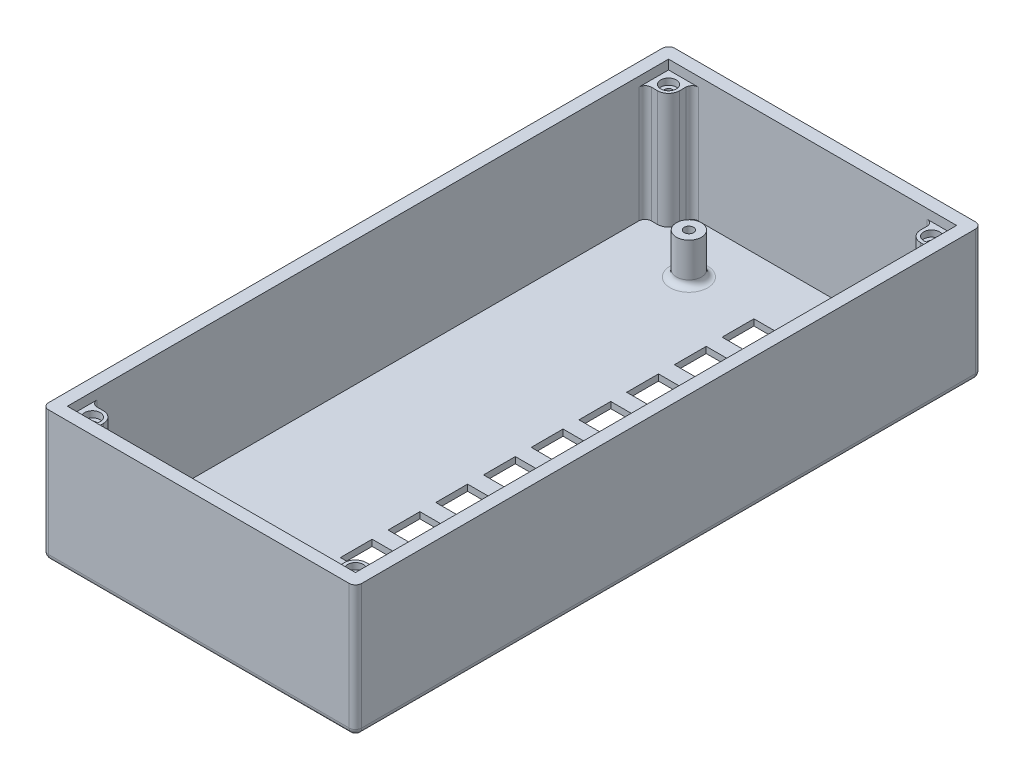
ISO-10303-21;
HEADER;
FILE_DESCRIPTION(('STEP AP214'),'2;1');
FILE_NAME('part.step','',(''),(''),'','','');
FILE_SCHEMA(('AUTOMOTIVE_DESIGN { 1 0 10303 214 1 1 1 1 }'));
ENDSEC;
DATA;
#1=APPLICATION_CONTEXT('core data for automotive mechanical design processes');
#2=APPLICATION_PROTOCOL_DEFINITION('international standard','automotive_design',2000,#1);
#3=PRODUCT_CONTEXT('',#1,'mechanical');
#4=PRODUCT('Part','Part','',(#3));
#5=PRODUCT_RELATED_PRODUCT_CATEGORY('part','',(#4));
#6=PRODUCT_DEFINITION_FORMATION('','',#4);
#7=PRODUCT_DEFINITION_CONTEXT('part definition',#1,'design');
#8=PRODUCT_DEFINITION('design','',#6,#7);
#9=PRODUCT_DEFINITION_SHAPE('','',#8);
#10=(LENGTH_UNIT() NAMED_UNIT(*) SI_UNIT(.MILLI.,.METRE.));
#11=(NAMED_UNIT(*) PLANE_ANGLE_UNIT() SI_UNIT($,.RADIAN.));
#12=(NAMED_UNIT(*) SI_UNIT($,.STERADIAN.) SOLID_ANGLE_UNIT());
#13=UNCERTAINTY_MEASURE_WITH_UNIT(LENGTH_MEASURE(1.E-05),#10,'distance_accuracy_value','');
#14=(GEOMETRIC_REPRESENTATION_CONTEXT(3) GLOBAL_UNCERTAINTY_ASSIGNED_CONTEXT((#13)) GLOBAL_UNIT_ASSIGNED_CONTEXT((#10,
#11,#12)) REPRESENTATION_CONTEXT('',''));
#15=CARTESIAN_POINT('',(0.,0.,0.));
#16=DIRECTION('',(0.,0.,1.));
#17=DIRECTION('',(1.,0.,0.));
#18=AXIS2_PLACEMENT_3D('',#15,#16,#17);
#19=CARTESIAN_POINT('',(0.,2.,0.));
#20=DIRECTION('',(0.,1.,0.));
#21=DIRECTION('',(0.,0.,1.));
#22=AXIS2_PLACEMENT_3D('',#19,#20,#21);
#23=PLANE('',#22);
#24=CARTESIAN_POINT('',(-22.5,2.,-78.9999999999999));
#25=DIRECTION('',(0.,1.,0.));
#26=DIRECTION('',(0.,0.,1.));
#27=AXIS2_PLACEMENT_3D('',#24,#25,#26);
#28=CIRCLE('',#27,6.);
#29=CARTESIAN_POINT('',(-22.5,2.,-72.9999999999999));
#30=VERTEX_POINT('',#29);
#31=EDGE_CURVE('E46',#30,#30,#28,.F.);
#32=ORIENTED_EDGE('',*,*,#31,.T.);
#33=EDGE_LOOP('',(#32));
#34=FACE_BOUND('',#33,.T.);
#35=CARTESIAN_POINT('',(-22.5,2.,75.0000000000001));
#36=DIRECTION('',(0.,1.,0.));
#37=DIRECTION('',(0.,0.,1.));
#38=AXIS2_PLACEMENT_3D('',#35,#36,#37);
#39=CIRCLE('',#38,6.);
#40=CARTESIAN_POINT('',(-22.5,2.,81.0000000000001));
#41=VERTEX_POINT('',#40);
#42=EDGE_CURVE('E1205',#41,#41,#39,.F.);
#43=ORIENTED_EDGE('',*,*,#42,.T.);
#44=EDGE_LOOP('',(#43));
#45=FACE_BOUND('',#44,.T.);
#46=CARTESIAN_POINT('',(28.,2.,-80.5));
#47=DIRECTION('',(0.,1.,0.));
#48=DIRECTION('',(0.,0.,1.));
#49=AXIS2_PLACEMENT_3D('',#46,#47,#48);
#50=CIRCLE('',#49,2.);
#51=CARTESIAN_POINT('',(28.,2.,-82.5));
#52=VERTEX_POINT('',#51);
#53=EDGE_CURVE('E1235',#52,#52,#50,.T.);
#54=ORIENTED_EDGE('',*,*,#53,.F.);
#55=EDGE_LOOP('',(#54));
#56=FACE_BOUND('',#55,.T.);
#57=CARTESIAN_POINT('',(26.5,2.,75.));
#58=DIRECTION('',(0.,1.,0.));
#59=DIRECTION('',(0.,0.,1.));
#60=AXIS2_PLACEMENT_3D('',#57,#58,#59);
#61=CIRCLE('',#60,4.00000000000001);
#62=CARTESIAN_POINT('',(26.5,2.,71.));
#63=VERTEX_POINT('',#62);
#64=EDGE_CURVE('E1232',#63,#63,#61,.T.);
#65=ORIENTED_EDGE('',*,*,#64,.F.);
#66=EDGE_LOOP('',(#65));
#67=FACE_BOUND('',#66,.T.);
#68=DIRECTION('',(0.,0.,1.));
#69=VECTOR('',#68,1.);
#70=CARTESIAN_POINT('',(-0.64999999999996,2.,59.14));
#71=LINE('',#70,#69);
#72=CARTESIAN_POINT('',(-0.64999999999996,2.,59.14));
#73=VERTEX_POINT('',#72);
#74=CARTESIAN_POINT('',(-0.649999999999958,2.,69.3));
#75=VERTEX_POINT('',#74);
#76=EDGE_CURVE('E53',#73,#75,#71,.T.);
#77=ORIENTED_EDGE('',*,*,#76,.F.);
#78=DIRECTION('',(-1.,0.,0.));
#79=VECTOR('',#78,1.);
#80=CARTESIAN_POINT('',(-0.64999999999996,2.,59.14));
#81=LINE('',#80,#79);
#82=CARTESIAN_POINT('',(24.75,2.,59.14));
#83=VERTEX_POINT('',#82);
#84=EDGE_CURVE('E546',#83,#73,#81,.T.);
#85=ORIENTED_EDGE('',*,*,#84,.F.);
#86=DIRECTION('',(0.,0.,-1.));
#87=VECTOR('',#86,1.);
#88=CARTESIAN_POINT('',(24.75,2.,59.14));
#89=LINE('',#88,#87);
#90=CARTESIAN_POINT('',(24.75,2.,69.3));
#91=VERTEX_POINT('',#90);
#92=EDGE_CURVE('E530',#91,#83,#89,.T.);
#93=ORIENTED_EDGE('',*,*,#92,.F.);
#94=DIRECTION('',(1.,0.,0.));
#95=VECTOR('',#94,1.);
#96=CARTESIAN_POINT('',(-0.649999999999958,2.,69.3));
#97=LINE('',#96,#95);
#98=EDGE_CURVE('E540',#75,#91,#97,.T.);
#99=ORIENTED_EDGE('',*,*,#98,.F.);
#100=EDGE_LOOP('',(#77,#85,#93,#99));
#101=FACE_BOUND('',#100,.T.);
#102=DIRECTION('',(0.,0.,1.));
#103=VECTOR('',#102,1.);
#104=CARTESIAN_POINT('',(-0.549999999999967,2.,28.8700000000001));
#105=LINE('',#104,#103);
#106=CARTESIAN_POINT('',(-0.549999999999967,2.,28.8700000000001));
#107=VERTEX_POINT('',#106);
#108=CARTESIAN_POINT('',(-0.549999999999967,2.,39.0300000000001));
#109=VERTEX_POINT('',#108);
#110=EDGE_CURVE('E61',#107,#109,#105,.T.);
#111=ORIENTED_EDGE('',*,*,#110,.F.);
#112=DIRECTION('',(-1.,0.,0.));
#113=VECTOR('',#112,1.);
#114=CARTESIAN_POINT('',(-0.549999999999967,2.,28.8700000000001));
#115=LINE('',#114,#113);
#116=CARTESIAN_POINT('',(24.85,2.,28.8700000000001));
#117=VERTEX_POINT('',#116);
#118=EDGE_CURVE('E564',#117,#107,#115,.T.);
#119=ORIENTED_EDGE('',*,*,#118,.F.);
#120=DIRECTION('',(0.,0.,-1.));
#121=VECTOR('',#120,1.);
#122=CARTESIAN_POINT('',(24.85,2.,28.8700000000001));
#123=LINE('',#122,#121);
#124=CARTESIAN_POINT('',(24.85,2.,39.0300000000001));
#125=VERTEX_POINT('',#124);
#126=EDGE_CURVE('E561',#125,#117,#123,.T.);
#127=ORIENTED_EDGE('',*,*,#126,.F.);
#128=DIRECTION('',(1.,0.,0.));
#129=VECTOR('',#128,1.);
#130=CARTESIAN_POINT('',(-0.549999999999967,2.,39.0300000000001));
#131=LINE('',#130,#129);
#132=EDGE_CURVE('E557',#109,#125,#131,.T.);
#133=ORIENTED_EDGE('',*,*,#132,.F.);
#134=EDGE_LOOP('',(#111,#119,#127,#133));
#135=FACE_BOUND('',#134,.T.);
#136=DIRECTION('',(0.,0.,1.));
#137=VECTOR('',#136,1.);
#138=CARTESIAN_POINT('',(-0.549999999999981,2.,-77.81));
#139=LINE('',#138,#137);
#140=CARTESIAN_POINT('',(-0.549999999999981,2.,-77.81));
#141=VERTEX_POINT('',#140);
#142=CARTESIAN_POINT('',(-0.549999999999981,2.,-67.65));
#143=VERTEX_POINT('',#142);
#144=EDGE_CURVE('E570',#141,#143,#139,.T.);
#145=ORIENTED_EDGE('',*,*,#144,.F.);
#146=DIRECTION('',(-1.,0.,0.));
#147=VECTOR('',#146,1.);
#148=CARTESIAN_POINT('',(-0.549999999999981,2.,-77.81));
#149=LINE('',#148,#147);
#150=CARTESIAN_POINT('',(24.85,2.,-77.81));
#151=VERTEX_POINT('',#150);
#152=EDGE_CURVE('E724',#151,#141,#149,.T.);
#153=ORIENTED_EDGE('',*,*,#152,.F.);
#154=DIRECTION('',(0.,0.,-1.));
#155=VECTOR('',#154,1.);
#156=CARTESIAN_POINT('',(24.85,2.,-77.81));
#157=LINE('',#156,#155);
#158=CARTESIAN_POINT('',(24.85,2.,-67.65));
#159=VERTEX_POINT('',#158);
#160=EDGE_CURVE('E721',#159,#151,#157,.T.);
#161=ORIENTED_EDGE('',*,*,#160,.F.);
#162=DIRECTION('',(1.,0.,0.));
#163=VECTOR('',#162,1.);
#164=CARTESIAN_POINT('',(-0.549999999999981,2.,-67.65));
#165=LINE('',#164,#163);
#166=EDGE_CURVE('E718',#143,#159,#165,.T.);
#167=ORIENTED_EDGE('',*,*,#166,.F.);
#168=EDGE_LOOP('',(#145,#153,#161,#167));
#169=FACE_BOUND('',#168,.T.);
#170=DIRECTION('',(0.,0.,1.));
#171=VECTOR('',#170,1.);
#172=CARTESIAN_POINT('',(-0.549999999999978,2.,-62.57));
#173=LINE('',#172,#171);
#174=CARTESIAN_POINT('',(-0.549999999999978,2.,-62.57));
#175=VERTEX_POINT('',#174);
#176=CARTESIAN_POINT('',(-0.549999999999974,2.,-52.41));
#177=VERTEX_POINT('',#176);
#178=EDGE_CURVE('E697',#175,#177,#173,.T.);
#179=ORIENTED_EDGE('',*,*,#178,.F.);
#180=DIRECTION('',(-1.,0.,0.));
#181=VECTOR('',#180,1.);
#182=CARTESIAN_POINT('',(-0.549999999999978,2.,-62.57));
#183=LINE('',#182,#181);
#184=CARTESIAN_POINT('',(24.85,2.,-62.57));
#185=VERTEX_POINT('',#184);
#186=EDGE_CURVE('E706',#185,#175,#183,.T.);
#187=ORIENTED_EDGE('',*,*,#186,.F.);
#188=DIRECTION('',(0.,0.,-1.));
#189=VECTOR('',#188,1.);
#190=CARTESIAN_POINT('',(24.85,2.,-62.57));
#191=LINE('',#190,#189);
#192=CARTESIAN_POINT('',(24.85,2.,-52.41));
#193=VERTEX_POINT('',#192);
#194=EDGE_CURVE('E703',#193,#185,#191,.T.);
#195=ORIENTED_EDGE('',*,*,#194,.F.);
#196=DIRECTION('',(1.,0.,0.));
#197=VECTOR('',#196,1.);
#198=CARTESIAN_POINT('',(-0.549999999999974,2.,-52.41));
#199=LINE('',#198,#197);
#200=EDGE_CURVE('E699',#177,#193,#199,.T.);
#201=ORIENTED_EDGE('',*,*,#200,.F.);
#202=EDGE_LOOP('',(#179,#187,#195,#201));
#203=FACE_BOUND('',#202,.T.);
#204=DIRECTION('',(0.,0.,1.));
#205=VECTOR('',#204,1.);
#206=CARTESIAN_POINT('',(-0.549999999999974,2.,-47.33));
#207=LINE('',#206,#205);
#208=CARTESIAN_POINT('',(-0.549999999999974,2.,-47.33));
#209=VERTEX_POINT('',#208);
#210=CARTESIAN_POINT('',(-0.549999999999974,2.,-37.17));
#211=VERTEX_POINT('',#210);
#212=EDGE_CURVE('E677',#209,#211,#207,.T.);
#213=ORIENTED_EDGE('',*,*,#212,.F.);
#214=DIRECTION('',(-1.,0.,0.));
#215=VECTOR('',#214,1.);
#216=CARTESIAN_POINT('',(-0.549999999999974,2.,-47.33));
#217=LINE('',#216,#215);
#218=CARTESIAN_POINT('',(24.85,2.,-47.33));
#219=VERTEX_POINT('',#218);
#220=EDGE_CURVE('E686',#219,#209,#217,.T.);
#221=ORIENTED_EDGE('',*,*,#220,.F.);
#222=DIRECTION('',(0.,0.,-1.));
#223=VECTOR('',#222,1.);
#224=CARTESIAN_POINT('',(24.85,2.,-47.33));
#225=LINE('',#224,#223);
#226=CARTESIAN_POINT('',(24.85,2.,-37.17));
#227=VERTEX_POINT('',#226);
#228=EDGE_CURVE('E683',#227,#219,#225,.T.);
#229=ORIENTED_EDGE('',*,*,#228,.F.);
#230=DIRECTION('',(1.,0.,0.));
#231=VECTOR('',#230,1.);
#232=CARTESIAN_POINT('',(-0.549999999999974,2.,-37.17));
#233=LINE('',#232,#231);
#234=EDGE_CURVE('E679',#211,#227,#233,.T.);
#235=ORIENTED_EDGE('',*,*,#234,.F.);
#236=EDGE_LOOP('',(#213,#221,#229,#235));
#237=FACE_BOUND('',#236,.T.);
#238=DIRECTION('',(0.,0.,1.));
#239=VECTOR('',#238,1.);
#240=CARTESIAN_POINT('',(-0.549999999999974,2.,-32.09));
#241=LINE('',#240,#239);
#242=CARTESIAN_POINT('',(-0.549999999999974,2.,-32.09));
#243=VERTEX_POINT('',#242);
#244=CARTESIAN_POINT('',(-0.549999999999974,2.,-21.93));
#245=VERTEX_POINT('',#244);
#246=EDGE_CURVE('E657',#243,#245,#241,.T.);
#247=ORIENTED_EDGE('',*,*,#246,.F.);
#248=DIRECTION('',(-1.,0.,0.));
#249=VECTOR('',#248,1.);
#250=CARTESIAN_POINT('',(-0.549999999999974,2.,-32.09));
#251=LINE('',#250,#249);
#252=CARTESIAN_POINT('',(24.85,2.,-32.09));
#253=VERTEX_POINT('',#252);
#254=EDGE_CURVE('E666',#253,#243,#251,.T.);
#255=ORIENTED_EDGE('',*,*,#254,.F.);
#256=DIRECTION('',(0.,0.,-1.));
#257=VECTOR('',#256,1.);
#258=CARTESIAN_POINT('',(24.85,2.,-32.09));
#259=LINE('',#258,#257);
#260=CARTESIAN_POINT('',(24.85,2.,-21.93));
#261=VERTEX_POINT('',#260);
#262=EDGE_CURVE('E663',#261,#253,#259,.T.);
#263=ORIENTED_EDGE('',*,*,#262,.F.);
#264=DIRECTION('',(1.,0.,0.));
#265=VECTOR('',#264,1.);
#266=CARTESIAN_POINT('',(-0.549999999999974,2.,-21.93));
#267=LINE('',#266,#265);
#268=EDGE_CURVE('E659',#245,#261,#267,.T.);
#269=ORIENTED_EDGE('',*,*,#268,.F.);
#270=EDGE_LOOP('',(#247,#255,#263,#269));
#271=FACE_BOUND('',#270,.T.);
#272=DIRECTION('',(0.,0.,1.));
#273=VECTOR('',#272,1.);
#274=CARTESIAN_POINT('',(-0.549999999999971,2.,-16.85));
#275=LINE('',#274,#273);
#276=CARTESIAN_POINT('',(-0.549999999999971,2.,-16.85));
#277=VERTEX_POINT('',#276);
#278=CARTESIAN_POINT('',(-0.549999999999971,2.,-6.69000000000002));
#279=VERTEX_POINT('',#278);
#280=EDGE_CURVE('E637',#277,#279,#275,.T.);
#281=ORIENTED_EDGE('',*,*,#280,.F.);
#282=DIRECTION('',(-1.,0.,0.));
#283=VECTOR('',#282,1.);
#284=CARTESIAN_POINT('',(-0.549999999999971,2.,-16.85));
#285=LINE('',#284,#283);
#286=CARTESIAN_POINT('',(24.85,2.,-16.85));
#287=VERTEX_POINT('',#286);
#288=EDGE_CURVE('E646',#287,#277,#285,.T.);
#289=ORIENTED_EDGE('',*,*,#288,.F.);
#290=DIRECTION('',(0.,0.,-1.));
#291=VECTOR('',#290,1.);
#292=CARTESIAN_POINT('',(24.85,2.,-16.85));
#293=LINE('',#292,#291);
#294=CARTESIAN_POINT('',(24.85,2.,-6.69000000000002));
#295=VERTEX_POINT('',#294);
#296=EDGE_CURVE('E643',#295,#287,#293,.T.);
#297=ORIENTED_EDGE('',*,*,#296,.F.);
#298=DIRECTION('',(1.,0.,0.));
#299=VECTOR('',#298,1.);
#300=CARTESIAN_POINT('',(-0.549999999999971,2.,-6.69000000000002));
#301=LINE('',#300,#299);
#302=EDGE_CURVE('E639',#279,#295,#301,.T.);
#303=ORIENTED_EDGE('',*,*,#302,.F.);
#304=EDGE_LOOP('',(#281,#289,#297,#303));
#305=FACE_BOUND('',#304,.T.);
#306=DIRECTION('',(0.,0.,1.));
#307=VECTOR('',#306,1.);
#308=CARTESIAN_POINT('',(-0.549999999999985,2.,-1.61000000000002));
#309=LINE('',#308,#307);
#310=CARTESIAN_POINT('',(-0.549999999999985,2.,-1.61000000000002));
#311=VERTEX_POINT('',#310);
#312=CARTESIAN_POINT('',(-0.549999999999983,2.,8.54999999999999));
#313=VERTEX_POINT('',#312);
#314=EDGE_CURVE('E617',#311,#313,#309,.T.);
#315=ORIENTED_EDGE('',*,*,#314,.F.);
#316=DIRECTION('',(-1.,0.,0.));
#317=VECTOR('',#316,1.);
#318=CARTESIAN_POINT('',(-0.549999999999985,2.,-1.61000000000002));
#319=LINE('',#318,#317);
#320=CARTESIAN_POINT('',(24.85,2.,-1.61000000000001));
#321=VERTEX_POINT('',#320);
#322=EDGE_CURVE('E626',#321,#311,#319,.T.);
#323=ORIENTED_EDGE('',*,*,#322,.F.);
#324=DIRECTION('',(0.,0.,-1.));
#325=VECTOR('',#324,1.);
#326=CARTESIAN_POINT('',(24.85,2.,-1.61000000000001));
#327=LINE('',#326,#325);
#328=CARTESIAN_POINT('',(24.85,2.,8.54999999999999));
#329=VERTEX_POINT('',#328);
#330=EDGE_CURVE('E623',#329,#321,#327,.T.);
#331=ORIENTED_EDGE('',*,*,#330,.F.);
#332=DIRECTION('',(1.,0.,0.));
#333=VECTOR('',#332,1.);
#334=CARTESIAN_POINT('',(-0.549999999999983,2.,8.54999999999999));
#335=LINE('',#334,#333);
#336=EDGE_CURVE('E619',#313,#329,#335,.T.);
#337=ORIENTED_EDGE('',*,*,#336,.F.);
#338=EDGE_LOOP('',(#315,#323,#331,#337));
#339=FACE_BOUND('',#338,.T.);
#340=DIRECTION('',(0.,0.,1.));
#341=VECTOR('',#340,1.);
#342=CARTESIAN_POINT('',(-0.549999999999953,2.,13.63));
#343=LINE('',#342,#341);
#344=CARTESIAN_POINT('',(-0.549999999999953,2.,13.63));
#345=VERTEX_POINT('',#344);
#346=CARTESIAN_POINT('',(-0.549999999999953,2.,23.7900000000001));
#347=VERTEX_POINT('',#346);
#348=EDGE_CURVE('E597',#345,#347,#343,.T.);
#349=ORIENTED_EDGE('',*,*,#348,.F.);
#350=DIRECTION('',(-1.,0.,0.));
#351=VECTOR('',#350,1.);
#352=CARTESIAN_POINT('',(-0.549999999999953,2.,13.63));
#353=LINE('',#352,#351);
#354=CARTESIAN_POINT('',(24.85,2.,13.6300000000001));
#355=VERTEX_POINT('',#354);
#356=EDGE_CURVE('E606',#355,#345,#353,.T.);
#357=ORIENTED_EDGE('',*,*,#356,.F.);
#358=DIRECTION('',(0.,0.,-1.));
#359=VECTOR('',#358,1.);
#360=CARTESIAN_POINT('',(24.85,2.,13.6300000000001));
#361=LINE('',#360,#359);
#362=CARTESIAN_POINT('',(24.85,2.,23.7900000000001));
#363=VERTEX_POINT('',#362);
#364=EDGE_CURVE('E603',#363,#355,#361,.T.);
#365=ORIENTED_EDGE('',*,*,#364,.F.);
#366=DIRECTION('',(1.,0.,0.));
#367=VECTOR('',#366,1.);
#368=CARTESIAN_POINT('',(-0.549999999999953,2.,23.7900000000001));
#369=LINE('',#368,#367);
#370=EDGE_CURVE('E599',#347,#363,#369,.T.);
#371=ORIENTED_EDGE('',*,*,#370,.F.);
#372=EDGE_LOOP('',(#349,#357,#365,#371));
#373=FACE_BOUND('',#372,.T.);
#374=DIRECTION('',(0.,0.,1.));
#375=VECTOR('',#374,1.);
#376=CARTESIAN_POINT('',(-0.549999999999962,2.,44.1100000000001));
#377=LINE('',#376,#375);
#378=CARTESIAN_POINT('',(-0.549999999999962,2.,44.1100000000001));
#379=VERTEX_POINT('',#378);
#380=CARTESIAN_POINT('',(-0.54999999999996,2.,54.27));
#381=VERTEX_POINT('',#380);
#382=EDGE_CURVE('E576',#379,#381,#377,.T.);
#383=ORIENTED_EDGE('',*,*,#382,.F.);
#384=DIRECTION('',(-1.,0.,0.));
#385=VECTOR('',#384,1.);
#386=CARTESIAN_POINT('',(-0.549999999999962,2.,44.1100000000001));
#387=LINE('',#386,#385);
#388=CARTESIAN_POINT('',(24.85,2.,44.11));
#389=VERTEX_POINT('',#388);
#390=EDGE_CURVE('E585',#389,#379,#387,.T.);
#391=ORIENTED_EDGE('',*,*,#390,.F.);
#392=DIRECTION('',(0.,0.,-1.));
#393=VECTOR('',#392,1.);
#394=CARTESIAN_POINT('',(24.85,2.,44.11));
#395=LINE('',#394,#393);
#396=CARTESIAN_POINT('',(24.85,2.,54.27));
#397=VERTEX_POINT('',#396);
#398=EDGE_CURVE('E582',#397,#389,#395,.T.);
#399=ORIENTED_EDGE('',*,*,#398,.F.);
#400=DIRECTION('',(1.,0.,0.));
#401=VECTOR('',#400,1.);
#402=CARTESIAN_POINT('',(-0.54999999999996,2.,54.27));
#403=LINE('',#402,#401);
#404=EDGE_CURVE('E578',#381,#397,#403,.T.);
#405=ORIENTED_EDGE('',*,*,#404,.F.);
#406=EDGE_LOOP('',(#383,#391,#399,#405));
#407=FACE_BOUND('',#406,.T.);
#408=DIRECTION('',(-1.,0.,0.));
#409=VECTOR('',#408,1.);
#410=CARTESIAN_POINT('',(-46.,2.,-96.));
#411=LINE('',#410,#409);
#412=CARTESIAN_POINT('',(36.5,2.,-96.));
#413=VERTEX_POINT('',#412);
#414=CARTESIAN_POINT('',(-36.5,2.,-96.));
#415=VERTEX_POINT('',#414);
#416=EDGE_CURVE('E882',#413,#415,#411,.T.);
#417=ORIENTED_EDGE('',*,*,#416,.T.);
#418=CARTESIAN_POINT('',(-36.5,2.,-94.));
#419=DIRECTION('',(0.,1.,0.));
#420=DIRECTION('',(0.,0.,1.));
#421=AXIS2_PLACEMENT_3D('',#418,#419,#420);
#422=CIRCLE('',#421,2.);
#423=CARTESIAN_POINT('',(-38.5,2.,-94.));
#424=VERTEX_POINT('',#423);
#425=EDGE_CURVE('E1025',#415,#424,#422,.T.);
#426=ORIENTED_EDGE('',*,*,#425,.T.);
#427=DIRECTION('',(0.,0.,-1.));
#428=VECTOR('',#427,1.);
#429=CARTESIAN_POINT('',(-38.5,2.,-92.));
#430=LINE('',#429,#428);
#431=CARTESIAN_POINT('',(-38.5,2.,-92.));
#432=VERTEX_POINT('',#431);
#433=EDGE_CURVE('E845',#432,#424,#430,.T.);
#434=ORIENTED_EDGE('',*,*,#433,.F.);
#435=CARTESIAN_POINT('',(-42.,2.,-92.));
#436=DIRECTION('',(0.,1.,0.));
#437=DIRECTION('',(0.,0.,1.));
#438=AXIS2_PLACEMENT_3D('',#435,#436,#437);
#439=CIRCLE('',#438,3.50000000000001);
#440=CARTESIAN_POINT('',(-42.,2.,-88.5));
#441=VERTEX_POINT('',#440);
#442=EDGE_CURVE('E876',#441,#432,#439,.T.);
#443=ORIENTED_EDGE('',*,*,#442,.F.);
#444=DIRECTION('',(1.,0.,0.));
#445=VECTOR('',#444,1.);
#446=CARTESIAN_POINT('',(-46.,2.,-88.5));
#447=LINE('',#446,#445);
#448=CARTESIAN_POINT('',(-44.,2.,-88.5));
#449=VERTEX_POINT('',#448);
#450=EDGE_CURVE('E841',#449,#441,#447,.T.);
#451=ORIENTED_EDGE('',*,*,#450,.F.);
#452=CARTESIAN_POINT('',(-44.,2.,-86.5));
#453=DIRECTION('',(0.,1.,0.));
#454=DIRECTION('',(0.,0.,1.));
#455=AXIS2_PLACEMENT_3D('',#452,#453,#454);
#456=CIRCLE('',#455,2.);
#457=CARTESIAN_POINT('',(-46.,2.,-86.5));
#458=VERTEX_POINT('',#457);
#459=EDGE_CURVE('E1023',#449,#458,#456,.T.);
#460=ORIENTED_EDGE('',*,*,#459,.T.);
#461=DIRECTION('',(0.,0.,1.));
#462=VECTOR('',#461,1.);
#463=CARTESIAN_POINT('',(-46.,2.,-96.));
#464=LINE('',#463,#462);
#465=CARTESIAN_POINT('',(-46.,2.,86.5));
#466=VERTEX_POINT('',#465);
#467=EDGE_CURVE('E898',#458,#466,#464,.T.);
#468=ORIENTED_EDGE('',*,*,#467,.T.);
#469=CARTESIAN_POINT('',(-44.,2.,86.5));
#470=DIRECTION('',(0.,1.,0.));
#471=DIRECTION('',(0.,0.,1.));
#472=AXIS2_PLACEMENT_3D('',#469,#470,#471);
#473=CIRCLE('',#472,2.);
#474=CARTESIAN_POINT('',(-44.,2.,88.5));
#475=VERTEX_POINT('',#474);
#476=EDGE_CURVE('E1021',#466,#475,#473,.T.);
#477=ORIENTED_EDGE('',*,*,#476,.T.);
#478=DIRECTION('',(-1.,0.,0.));
#479=VECTOR('',#478,1.);
#480=CARTESIAN_POINT('',(-42.,2.,88.5));
#481=LINE('',#480,#479);
#482=CARTESIAN_POINT('',(-42.,2.,88.5));
#483=VERTEX_POINT('',#482);
#484=EDGE_CURVE('E794',#483,#475,#481,.T.);
#485=ORIENTED_EDGE('',*,*,#484,.F.);
#486=CARTESIAN_POINT('',(-42.,2.,92.));
#487=DIRECTION('',(0.,1.,0.));
#488=DIRECTION('',(0.,0.,1.));
#489=AXIS2_PLACEMENT_3D('',#486,#487,#488);
#490=CIRCLE('',#489,3.50000000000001);
#491=CARTESIAN_POINT('',(-38.5,2.,92.));
#492=VERTEX_POINT('',#491);
#493=EDGE_CURVE('E860',#492,#483,#490,.T.);
#494=ORIENTED_EDGE('',*,*,#493,.F.);
#495=DIRECTION('',(0.,0.,-1.));
#496=VECTOR('',#495,1.);
#497=CARTESIAN_POINT('',(-38.5,2.,96.));
#498=LINE('',#497,#496);
#499=CARTESIAN_POINT('',(-38.5,2.,94.));
#500=VERTEX_POINT('',#499);
#501=EDGE_CURVE('E787',#500,#492,#498,.T.);
#502=ORIENTED_EDGE('',*,*,#501,.F.);
#503=CARTESIAN_POINT('',(-36.5,2.,94.));
#504=DIRECTION('',(0.,1.,0.));
#505=DIRECTION('',(0.,0.,1.));
#506=AXIS2_PLACEMENT_3D('',#503,#504,#505);
#507=CIRCLE('',#506,2.);
#508=CARTESIAN_POINT('',(-36.5,2.,96.));
#509=VERTEX_POINT('',#508);
#510=EDGE_CURVE('E1019',#500,#509,#507,.T.);
#511=ORIENTED_EDGE('',*,*,#510,.T.);
#512=DIRECTION('',(1.,0.,0.));
#513=VECTOR('',#512,1.);
#514=CARTESIAN_POINT('',(-46.,2.,96.));
#515=LINE('',#514,#513);
#516=CARTESIAN_POINT('',(36.5,2.,96.));
#517=VERTEX_POINT('',#516);
#518=EDGE_CURVE('E901',#509,#517,#515,.T.);
#519=ORIENTED_EDGE('',*,*,#518,.T.);
#520=CARTESIAN_POINT('',(36.5,2.,94.));
#521=DIRECTION('',(0.,1.,0.));
#522=DIRECTION('',(0.,0.,1.));
#523=AXIS2_PLACEMENT_3D('',#520,#521,#522);
#524=CIRCLE('',#523,2.);
#525=CARTESIAN_POINT('',(38.5,2.,94.));
#526=VERTEX_POINT('',#525);
#527=EDGE_CURVE('E1017',#517,#526,#524,.T.);
#528=ORIENTED_EDGE('',*,*,#527,.T.);
#529=DIRECTION('',(0.,0.,1.));
#530=VECTOR('',#529,1.);
#531=CARTESIAN_POINT('',(38.5,2.,96.));
#532=LINE('',#531,#530);
#533=CARTESIAN_POINT('',(38.5,2.,92.));
#534=VERTEX_POINT('',#533);
#535=EDGE_CURVE('E803',#534,#526,#532,.T.);
#536=ORIENTED_EDGE('',*,*,#535,.F.);
#537=CARTESIAN_POINT('',(42.,2.,92.));
#538=DIRECTION('',(0.,1.,0.));
#539=DIRECTION('',(0.,0.,1.));
#540=AXIS2_PLACEMENT_3D('',#537,#538,#539);
#541=CIRCLE('',#540,3.5);
#542=CARTESIAN_POINT('',(42.,2.,88.5));
#543=VERTEX_POINT('',#542);
#544=EDGE_CURVE('E864',#543,#534,#541,.T.);
#545=ORIENTED_EDGE('',*,*,#544,.F.);
#546=DIRECTION('',(-1.,0.,0.));
#547=VECTOR('',#546,1.);
#548=CARTESIAN_POINT('',(42.,2.,88.5));
#549=LINE('',#548,#547);
#550=CARTESIAN_POINT('',(44.,2.,88.5));
#551=VERTEX_POINT('',#550);
#552=EDGE_CURVE('E808',#551,#543,#549,.T.);
#553=ORIENTED_EDGE('',*,*,#552,.F.);
#554=CARTESIAN_POINT('',(44.,2.,86.5));
#555=DIRECTION('',(0.,1.,0.));
#556=DIRECTION('',(0.,0.,1.));
#557=AXIS2_PLACEMENT_3D('',#554,#555,#556);
#558=CIRCLE('',#557,2.);
#559=CARTESIAN_POINT('',(46.,2.,86.5));
#560=VERTEX_POINT('',#559);
#561=EDGE_CURVE('E1015',#551,#560,#558,.T.);
#562=ORIENTED_EDGE('',*,*,#561,.T.);
#563=DIRECTION('',(0.,0.,-1.));
#564=VECTOR('',#563,1.);
#565=CARTESIAN_POINT('',(46.,2.,-96.));
#566=LINE('',#565,#564);
#567=CARTESIAN_POINT('',(46.,2.,-86.5));
#568=VERTEX_POINT('',#567);
#569=EDGE_CURVE('E888',#560,#568,#566,.T.);
#570=ORIENTED_EDGE('',*,*,#569,.T.);
#571=CARTESIAN_POINT('',(44.,2.,-86.5));
#572=DIRECTION('',(0.,1.,0.));
#573=DIRECTION('',(0.,0.,1.));
#574=AXIS2_PLACEMENT_3D('',#571,#572,#573);
#575=CIRCLE('',#574,2.);
#576=CARTESIAN_POINT('',(44.,2.,-88.5));
#577=VERTEX_POINT('',#576);
#578=EDGE_CURVE('E1011',#568,#577,#575,.T.);
#579=ORIENTED_EDGE('',*,*,#578,.T.);
#580=DIRECTION('',(1.,0.,0.));
#581=VECTOR('',#580,1.);
#582=CARTESIAN_POINT('',(46.,2.,-88.5));
#583=LINE('',#582,#581);
#584=CARTESIAN_POINT('',(42.,2.,-88.5));
#585=VERTEX_POINT('',#584);
#586=EDGE_CURVE('E822',#585,#577,#583,.T.);
#587=ORIENTED_EDGE('',*,*,#586,.F.);
#588=CARTESIAN_POINT('',(42.,2.,-92.));
#589=DIRECTION('',(0.,1.,0.));
#590=DIRECTION('',(0.,0.,1.));
#591=AXIS2_PLACEMENT_3D('',#588,#589,#590);
#592=CIRCLE('',#591,3.5);
#593=CARTESIAN_POINT('',(38.5,2.,-91.9999999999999));
#594=VERTEX_POINT('',#593);
#595=EDGE_CURVE('E870',#594,#585,#592,.T.);
#596=ORIENTED_EDGE('',*,*,#595,.F.);
#597=DIRECTION('',(0.,0.,1.));
#598=VECTOR('',#597,1.);
#599=CARTESIAN_POINT('',(38.5,2.,-91.9999999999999));
#600=LINE('',#599,#598);
#601=CARTESIAN_POINT('',(38.5,2.,-94.));
#602=VERTEX_POINT('',#601);
#603=EDGE_CURVE('E827',#602,#594,#600,.T.);
#604=ORIENTED_EDGE('',*,*,#603,.F.);
#605=CARTESIAN_POINT('',(36.5,2.,-94.));
#606=DIRECTION('',(0.,1.,0.));
#607=DIRECTION('',(0.,0.,1.));
#608=AXIS2_PLACEMENT_3D('',#605,#606,#607);
#609=CIRCLE('',#608,2.);
#610=EDGE_CURVE('E1013',#602,#413,#609,.T.);
#611=ORIENTED_EDGE('',*,*,#610,.T.);
#612=EDGE_LOOP('',(#417,#426,#434,#443,#451,#460,#468,#477,#485,#494,#502,#511,#519,#528,#536,
#545,#553,#562,#570,#579,#587,#596,#604,#611));
#613=FACE_BOUND('',#612,.T.);
#614=ADVANCED_FACE('F38',(#34,#45,#56,#67,#101,#135,#169,#203,#237,#271,#305,#339,#373,#407,
#613),#23,.T.);
#615=CARTESIAN_POINT('',(-46.,42.,96.));
#616=DIRECTION('',(0.,0.,-1.));
#617=DIRECTION('',(-1.,0.,0.));
#618=AXIS2_PLACEMENT_3D('',#615,#616,#617);
#619=PLANE('',#618);
#620=ORIENTED_EDGE('',*,*,#518,.F.);
#621=DIRECTION('',(0.,-1.,0.));
#622=VECTOR('',#621,1.);
#623=CARTESIAN_POINT('',(-36.5,42.,96.));
#624=LINE('',#623,#622);
#625=CARTESIAN_POINT('',(-36.5,39.,96.));
#626=VERTEX_POINT('',#625);
#627=EDGE_CURVE('E1046',#509,#626,#624,.F.);
#628=ORIENTED_EDGE('',*,*,#627,.T.);
#629=DIRECTION('',(1.,0.,0.));
#630=VECTOR('',#629,1.);
#631=CARTESIAN_POINT('',(-46.,39.,96.));
#632=LINE('',#631,#630);
#633=CARTESIAN_POINT('',(-46.,39.,96.));
#634=VERTEX_POINT('',#633);
#635=EDGE_CURVE('E789',#634,#626,#632,.T.);
#636=ORIENTED_EDGE('',*,*,#635,.F.);
#637=DIRECTION('',(0.,-1.,0.));
#638=VECTOR('',#637,1.);
#639=CARTESIAN_POINT('',(-46.,42.,96.));
#640=LINE('',#639,#638);
#641=CARTESIAN_POINT('',(-46.,42.,96.));
#642=VERTEX_POINT('',#641);
#643=EDGE_CURVE('E911',#642,#634,#640,.T.);
#644=ORIENTED_EDGE('',*,*,#643,.F.);
#645=DIRECTION('',(1.,0.,0.));
#646=VECTOR('',#645,1.);
#647=CARTESIAN_POINT('',(-46.,42.,96.));
#648=LINE('',#647,#646);
#649=CARTESIAN_POINT('',(46.,42.,96.));
#650=VERTEX_POINT('',#649);
#651=EDGE_CURVE('E890',#642,#650,#648,.T.);
#652=ORIENTED_EDGE('',*,*,#651,.T.);
#653=DIRECTION('',(0.,-1.,0.));
#654=VECTOR('',#653,1.);
#655=CARTESIAN_POINT('',(46.,42.,96.));
#656=LINE('',#655,#654);
#657=CARTESIAN_POINT('',(46.,39.,96.));
#658=VERTEX_POINT('',#657);
#659=EDGE_CURVE('E908',#650,#658,#656,.T.);
#660=ORIENTED_EDGE('',*,*,#659,.T.);
#661=DIRECTION('',(1.,0.,0.));
#662=VECTOR('',#661,1.);
#663=CARTESIAN_POINT('',(46.,39.,96.));
#664=LINE('',#663,#662);
#665=CARTESIAN_POINT('',(36.5,39.,96.));
#666=VERTEX_POINT('',#665);
#667=EDGE_CURVE('E807',#666,#658,#664,.T.);
#668=ORIENTED_EDGE('',*,*,#667,.F.);
#669=DIRECTION('',(0.,-1.,0.));
#670=VECTOR('',#669,1.);
#671=CARTESIAN_POINT('',(36.5,42.,96.));
#672=LINE('',#671,#670);
#673=EDGE_CURVE('E1043',#666,#517,#672,.T.);
#674=ORIENTED_EDGE('',*,*,#673,.T.);
#675=EDGE_LOOP('',(#620,#628,#636,#644,#652,#660,#668,#674));
#676=FACE_BOUND('',#675,.T.);
#677=ADVANCED_FACE('F1247',(#676),#619,.T.);
#678=CARTESIAN_POINT('',(-46.,42.,-96.));
#679=DIRECTION('',(1.,0.,0.));
#680=DIRECTION('',(0.,0.,-1.));
#681=AXIS2_PLACEMENT_3D('',#678,#679,#680);
#682=PLANE('',#681);
#683=ORIENTED_EDGE('',*,*,#467,.F.);
#684=DIRECTION('',(0.,-1.,0.));
#685=VECTOR('',#684,1.);
#686=CARTESIAN_POINT('',(-46.,42.,-86.5));
#687=LINE('',#686,#685);
#688=CARTESIAN_POINT('',(-46.,39.,-86.5));
#689=VERTEX_POINT('',#688);
#690=EDGE_CURVE('E1035',#458,#689,#687,.F.);
#691=ORIENTED_EDGE('',*,*,#690,.T.);
#692=DIRECTION('',(0.,0.,1.));
#693=VECTOR('',#692,1.);
#694=CARTESIAN_POINT('',(-46.,39.,-96.));
#695=LINE('',#694,#693);
#696=CARTESIAN_POINT('',(-46.,39.,-96.));
#697=VERTEX_POINT('',#696);
#698=EDGE_CURVE('E850',#697,#689,#695,.T.);
#699=ORIENTED_EDGE('',*,*,#698,.F.);
#700=DIRECTION('',(0.,-1.,0.));
#701=VECTOR('',#700,1.);
#702=CARTESIAN_POINT('',(-46.,42.,-96.));
#703=LINE('',#702,#701);
#704=CARTESIAN_POINT('',(-46.,42.,-96.));
#705=VERTEX_POINT('',#704);
#706=EDGE_CURVE('E914',#705,#697,#703,.T.);
#707=ORIENTED_EDGE('',*,*,#706,.F.);
#708=DIRECTION('',(0.,0.,1.));
#709=VECTOR('',#708,1.);
#710=CARTESIAN_POINT('',(-46.,42.,-96.));
#711=LINE('',#710,#709);
#712=EDGE_CURVE('E887',#705,#642,#711,.T.);
#713=ORIENTED_EDGE('',*,*,#712,.T.);
#714=ORIENTED_EDGE('',*,*,#643,.T.);
#715=DIRECTION('',(0.,0.,1.));
#716=VECTOR('',#715,1.);
#717=CARTESIAN_POINT('',(-46.,39.,88.5));
#718=LINE('',#717,#716);
#719=CARTESIAN_POINT('',(-46.,39.,86.5));
#720=VERTEX_POINT('',#719);
#721=EDGE_CURVE('E786',#720,#634,#718,.T.);
#722=ORIENTED_EDGE('',*,*,#721,.F.);
#723=DIRECTION('',(0.,-1.,0.));
#724=VECTOR('',#723,1.);
#725=CARTESIAN_POINT('',(-46.,42.,86.5));
#726=LINE('',#725,#724);
#727=EDGE_CURVE('E1032',#720,#466,#726,.T.);
#728=ORIENTED_EDGE('',*,*,#727,.T.);
#729=EDGE_LOOP('',(#683,#691,#699,#707,#713,#714,#722,#728));
#730=FACE_BOUND('',#729,.T.);
#731=ADVANCED_FACE('F1252',(#730),#682,.T.);
#732=CARTESIAN_POINT('',(-42.,39.,92.));
#733=DIRECTION('',(0.,-1.,0.));
#734=DIRECTION('',(0.,0.,-1.));
#735=AXIS2_PLACEMENT_3D('',#732,#733,#734);
#736=CYLINDRICAL_SURFACE('',#735,3.50000000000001);
#737=DIRECTION('',(0.,-1.,0.));
#738=VECTOR('',#737,1.);
#739=CARTESIAN_POINT('',(-42.,39.,88.5));
#740=LINE('',#739,#738);
#741=CARTESIAN_POINT('',(-42.,39.,88.5));
#742=VERTEX_POINT('',#741);
#743=EDGE_CURVE('E801',#742,#483,#740,.T.);
#744=ORIENTED_EDGE('',*,*,#743,.F.);
#745=CARTESIAN_POINT('',(-42.,39.,92.));
#746=DIRECTION('',(0.,1.,0.));
#747=DIRECTION('',(0.,0.,1.));
#748=AXIS2_PLACEMENT_3D('',#745,#746,#747);
#749=CIRCLE('',#748,3.50000000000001);
#750=CARTESIAN_POINT('',(-38.5,39.,92.));
#751=VERTEX_POINT('',#750);
#752=EDGE_CURVE('E861',#751,#742,#749,.T.);
#753=ORIENTED_EDGE('',*,*,#752,.F.);
#754=DIRECTION('',(0.,-1.,0.));
#755=VECTOR('',#754,1.);
#756=CARTESIAN_POINT('',(-38.5,39.,92.));
#757=LINE('',#756,#755);
#758=EDGE_CURVE('E793',#751,#492,#757,.T.);
#759=ORIENTED_EDGE('',*,*,#758,.T.);
#760=ORIENTED_EDGE('',*,*,#493,.T.);
#761=EDGE_LOOP('',(#744,#753,#759,#760));
#762=FACE_BOUND('',#761,.T.);
#763=ADVANCED_FACE('F1444',(#762),#736,.T.);
#764=CARTESIAN_POINT('',(46.,42.,-96.));
#765=DIRECTION('',(-1.,0.,0.));
#766=DIRECTION('',(0.,0.,1.));
#767=AXIS2_PLACEMENT_3D('',#764,#765,#766);
#768=PLANE('',#767);
#769=ORIENTED_EDGE('',*,*,#569,.F.);
#770=DIRECTION('',(0.,-1.,0.));
#771=VECTOR('',#770,1.);
#772=CARTESIAN_POINT('',(46.,42.,86.5));
#773=LINE('',#772,#771);
#774=CARTESIAN_POINT('',(46.,39.,86.5));
#775=VERTEX_POINT('',#774);
#776=EDGE_CURVE('E1057',#560,#775,#773,.F.);
#777=ORIENTED_EDGE('',*,*,#776,.T.);
#778=DIRECTION('',(0.,0.,-1.));
#779=VECTOR('',#778,1.);
#780=CARTESIAN_POINT('',(46.,39.,88.5));
#781=LINE('',#780,#779);
#782=EDGE_CURVE('E810',#658,#775,#781,.T.);
#783=ORIENTED_EDGE('',*,*,#782,.F.);
#784=ORIENTED_EDGE('',*,*,#659,.F.);
#785=DIRECTION('',(0.,0.,-1.));
#786=VECTOR('',#785,1.);
#787=CARTESIAN_POINT('',(46.,42.,-96.));
#788=LINE('',#787,#786);
#789=CARTESIAN_POINT('',(46.,42.,-96.));
#790=VERTEX_POINT('',#789);
#791=EDGE_CURVE('E893',#650,#790,#788,.T.);
#792=ORIENTED_EDGE('',*,*,#791,.T.);
#793=DIRECTION('',(0.,-1.,0.));
#794=VECTOR('',#793,1.);
#795=CARTESIAN_POINT('',(46.,42.,-96.));
#796=LINE('',#795,#794);
#797=CARTESIAN_POINT('',(46.,39.,-96.));
#798=VERTEX_POINT('',#797);
#799=EDGE_CURVE('E895',#790,#798,#796,.T.);
#800=ORIENTED_EDGE('',*,*,#799,.T.);
#801=DIRECTION('',(0.,0.,-1.));
#802=VECTOR('',#801,1.);
#803=CARTESIAN_POINT('',(46.,39.,-96.));
#804=LINE('',#803,#802);
#805=CARTESIAN_POINT('',(46.,39.,-86.5));
#806=VERTEX_POINT('',#805);
#807=EDGE_CURVE('E826',#806,#798,#804,.T.);
#808=ORIENTED_EDGE('',*,*,#807,.F.);
#809=DIRECTION('',(0.,-1.,0.));
#810=VECTOR('',#809,1.);
#811=CARTESIAN_POINT('',(46.,42.,-86.5));
#812=LINE('',#811,#810);
#813=EDGE_CURVE('E1054',#806,#568,#812,.T.);
#814=ORIENTED_EDGE('',*,*,#813,.T.);
#815=EDGE_LOOP('',(#769,#777,#783,#784,#792,#800,#808,#814));
#816=FACE_BOUND('',#815,.T.);
#817=ADVANCED_FACE('F1390',(#816),#768,.T.);
#818=CARTESIAN_POINT('',(42.,39.,92.));
#819=DIRECTION('',(0.,-1.,0.));
#820=DIRECTION('',(0.,0.,-1.));
#821=AXIS2_PLACEMENT_3D('',#818,#819,#820);
#822=CYLINDRICAL_SURFACE('',#821,3.5);
#823=DIRECTION('',(0.,-1.,0.));
#824=VECTOR('',#823,1.);
#825=CARTESIAN_POINT('',(38.5,39.,92.));
#826=LINE('',#825,#824);
#827=CARTESIAN_POINT('',(38.5,39.,92.));
#828=VERTEX_POINT('',#827);
#829=EDGE_CURVE('E814',#828,#534,#826,.T.);
#830=ORIENTED_EDGE('',*,*,#829,.F.);
#831=CARTESIAN_POINT('',(42.,39.,92.));
#832=DIRECTION('',(0.,1.,0.));
#833=DIRECTION('',(0.,0.,1.));
#834=AXIS2_PLACEMENT_3D('',#831,#832,#833);
#835=CIRCLE('',#834,3.5);
#836=CARTESIAN_POINT('',(42.,39.,88.5));
#837=VERTEX_POINT('',#836);
#838=EDGE_CURVE('E867',#837,#828,#835,.T.);
#839=ORIENTED_EDGE('',*,*,#838,.F.);
#840=DIRECTION('',(0.,-1.,0.));
#841=VECTOR('',#840,1.);
#842=CARTESIAN_POINT('',(42.,39.,88.5));
#843=LINE('',#842,#841);
#844=EDGE_CURVE('E819',#837,#543,#843,.T.);
#845=ORIENTED_EDGE('',*,*,#844,.T.);
#846=ORIENTED_EDGE('',*,*,#544,.T.);
#847=EDGE_LOOP('',(#830,#839,#845,#846));
#848=FACE_BOUND('',#847,.T.);
#849=ADVANCED_FACE('F1443',(#848),#822,.T.);
#850=CARTESIAN_POINT('',(-46.,42.,-96.));
#851=DIRECTION('',(0.,0.,1.));
#852=DIRECTION('',(1.,0.,0.));
#853=AXIS2_PLACEMENT_3D('',#850,#851,#852);
#854=PLANE('',#853);
#855=DIRECTION('',(-1.,0.,0.));
#856=VECTOR('',#855,1.);
#857=CARTESIAN_POINT('',(-38.5,39.,-96.));
#858=LINE('',#857,#856);
#859=CARTESIAN_POINT('',(-36.5,39.,-96.));
#860=VERTEX_POINT('',#859);
#861=EDGE_CURVE('E848',#860,#697,#858,.T.);
#862=ORIENTED_EDGE('',*,*,#861,.F.);
#863=DIRECTION('',(0.,-1.,0.));
#864=VECTOR('',#863,1.);
#865=CARTESIAN_POINT('',(-36.5,42.,-96.));
#866=LINE('',#865,#864);
#867=EDGE_CURVE('E1008',#860,#415,#866,.T.);
#868=ORIENTED_EDGE('',*,*,#867,.T.);
#869=ORIENTED_EDGE('',*,*,#416,.F.);
#870=DIRECTION('',(0.,-1.,0.));
#871=VECTOR('',#870,1.);
#872=CARTESIAN_POINT('',(36.5,42.,-96.));
#873=LINE('',#872,#871);
#874=CARTESIAN_POINT('',(36.5,39.,-96.));
#875=VERTEX_POINT('',#874);
#876=EDGE_CURVE('E997',#413,#875,#873,.F.);
#877=ORIENTED_EDGE('',*,*,#876,.T.);
#878=DIRECTION('',(-1.,0.,0.));
#879=VECTOR('',#878,1.);
#880=CARTESIAN_POINT('',(38.5,39.,-96.));
#881=LINE('',#880,#879);
#882=EDGE_CURVE('E829',#798,#875,#881,.T.);
#883=ORIENTED_EDGE('',*,*,#882,.F.);
#884=ORIENTED_EDGE('',*,*,#799,.F.);
#885=DIRECTION('',(-1.,0.,0.));
#886=VECTOR('',#885,1.);
#887=CARTESIAN_POINT('',(-46.,42.,-96.));
#888=LINE('',#887,#886);
#889=EDGE_CURVE('E885',#790,#705,#888,.T.);
#890=ORIENTED_EDGE('',*,*,#889,.T.);
#891=ORIENTED_EDGE('',*,*,#706,.T.);
#892=EDGE_LOOP('',(#862,#868,#869,#877,#883,#884,#890,#891));
#893=FACE_BOUND('',#892,.T.);
#894=ADVANCED_FACE('F1396',(#893),#854,.T.);
#895=CARTESIAN_POINT('',(42.,39.,-92.));
#896=DIRECTION('',(0.,-1.,0.));
#897=DIRECTION('',(0.,0.,-1.));
#898=AXIS2_PLACEMENT_3D('',#895,#896,#897);
#899=CYLINDRICAL_SURFACE('',#898,3.5);
#900=DIRECTION('',(0.,-1.,0.));
#901=VECTOR('',#900,1.);
#902=CARTESIAN_POINT('',(42.,39.,-88.5));
#903=LINE('',#902,#901);
#904=CARTESIAN_POINT('',(42.,39.,-88.5));
#905=VERTEX_POINT('',#904);
#906=EDGE_CURVE('E839',#905,#585,#903,.T.);
#907=ORIENTED_EDGE('',*,*,#906,.F.);
#908=CARTESIAN_POINT('',(42.,39.,-92.));
#909=DIRECTION('',(0.,1.,0.));
#910=DIRECTION('',(0.,0.,1.));
#911=AXIS2_PLACEMENT_3D('',#908,#909,#910);
#912=CIRCLE('',#911,3.5);
#913=CARTESIAN_POINT('',(38.5,39.,-92.));
#914=VERTEX_POINT('',#913);
#915=EDGE_CURVE('E873',#914,#905,#912,.T.);
#916=ORIENTED_EDGE('',*,*,#915,.F.);
#917=DIRECTION('',(0.,-1.,0.));
#918=VECTOR('',#917,1.);
#919=CARTESIAN_POINT('',(38.5,39.,-91.9999999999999));
#920=LINE('',#919,#918);
#921=EDGE_CURVE('E833',#914,#594,#920,.T.);
#922=ORIENTED_EDGE('',*,*,#921,.T.);
#923=ORIENTED_EDGE('',*,*,#595,.T.);
#924=EDGE_LOOP('',(#907,#916,#922,#923));
#925=FACE_BOUND('',#924,.T.);
#926=ADVANCED_FACE('F1383',(#925),#899,.T.);
#927=CARTESIAN_POINT('',(-42.,39.,-92.));
#928=DIRECTION('',(0.,-1.,0.));
#929=DIRECTION('',(0.,0.,-1.));
#930=AXIS2_PLACEMENT_3D('',#927,#928,#929);
#931=CYLINDRICAL_SURFACE('',#930,3.50000000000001);
#932=DIRECTION('',(0.,-1.,0.));
#933=VECTOR('',#932,1.);
#934=CARTESIAN_POINT('',(-42.,39.,-88.5));
#935=LINE('',#934,#933);
#936=CARTESIAN_POINT('',(-42.,39.,-88.5));
#937=VERTEX_POINT('',#936);
#938=EDGE_CURVE('E857',#937,#441,#935,.T.);
#939=ORIENTED_EDGE('',*,*,#938,.T.);
#940=ORIENTED_EDGE('',*,*,#442,.T.);
#941=DIRECTION('',(0.,-1.,0.));
#942=VECTOR('',#941,1.);
#943=CARTESIAN_POINT('',(-38.5,39.,-92.));
#944=LINE('',#943,#942);
#945=CARTESIAN_POINT('',(-38.5,39.,-92.));
#946=VERTEX_POINT('',#945);
#947=EDGE_CURVE('E852',#946,#432,#944,.T.);
#948=ORIENTED_EDGE('',*,*,#947,.F.);
#949=CARTESIAN_POINT('',(-42.,39.,-92.));
#950=DIRECTION('',(0.,1.,0.));
#951=DIRECTION('',(0.,0.,1.));
#952=AXIS2_PLACEMENT_3D('',#949,#950,#951);
#953=CIRCLE('',#952,3.50000000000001);
#954=EDGE_CURVE('E879',#937,#946,#953,.T.);
#955=ORIENTED_EDGE('',*,*,#954,.F.);
#956=EDGE_LOOP('',(#939,#940,#948,#955));
#957=FACE_BOUND('',#956,.T.);
#958=ADVANCED_FACE('F1278',(#957),#931,.T.);
#959=CARTESIAN_POINT('',(-50.,2.,100.));
#960=DIRECTION('',(1.,0.,0.));
#961=DIRECTION('',(0.,0.,-1.));
#962=AXIS2_PLACEMENT_3D('',#959,#960,#961);
#963=PLANE('',#962);
#964=DIRECTION('',(0.,0.,1.));
#965=VECTOR('',#964,1.);
#966=CARTESIAN_POINT('',(-50.,2.,100.));
#967=LINE('',#966,#965);
#968=CARTESIAN_POINT('',(-50.,2.,-97.9999999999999));
#969=VERTEX_POINT('',#968);
#970=CARTESIAN_POINT('',(-50.,2.,98.));
#971=VERTEX_POINT('',#970);
#972=EDGE_CURVE('E947',#969,#971,#967,.T.);
#973=ORIENTED_EDGE('',*,*,#972,.T.);
#974=DIRECTION('',(0.,-1.,0.));
#975=VECTOR('',#974,1.);
#976=CARTESIAN_POINT('',(-50.,2.,98.));
#977=LINE('',#976,#975);
#978=CARTESIAN_POINT('',(-50.,42.,98.));
#979=VERTEX_POINT('',#978);
#980=EDGE_CURVE('E991',#971,#979,#977,.F.);
#981=ORIENTED_EDGE('',*,*,#980,.T.);
#982=DIRECTION('',(0.,0.,1.));
#983=VECTOR('',#982,1.);
#984=CARTESIAN_POINT('',(-50.,42.,-100.));
#985=LINE('',#984,#983);
#986=CARTESIAN_POINT('',(-50.,42.,-97.9999999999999));
#987=VERTEX_POINT('',#986);
#988=EDGE_CURVE('E917',#987,#979,#985,.T.);
#989=ORIENTED_EDGE('',*,*,#988,.F.);
#990=DIRECTION('',(0.,-1.,0.));
#991=VECTOR('',#990,1.);
#992=CARTESIAN_POINT('',(-50.,2.,-97.9999999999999));
#993=LINE('',#992,#991);
#994=EDGE_CURVE('E989',#987,#969,#993,.T.);
#995=ORIENTED_EDGE('',*,*,#994,.T.);
#996=EDGE_LOOP('',(#973,#981,#989,#995));
#997=FACE_BOUND('',#996,.T.);
#998=ADVANCED_FACE('F1274',(#997),#963,.F.);
#999=CARTESIAN_POINT('',(50.,2.,100.));
#1000=DIRECTION('',(0.,0.,-1.));
#1001=DIRECTION('',(-1.,0.,0.));
#1002=AXIS2_PLACEMENT_3D('',#999,#1000,#1001);
#1003=PLANE('',#1002);
#1004=DIRECTION('',(1.,0.,0.));
#1005=VECTOR('',#1004,1.);
#1006=CARTESIAN_POINT('',(50.,2.,100.));
#1007=LINE('',#1006,#1005);
#1008=CARTESIAN_POINT('',(-48.,2.,100.));
#1009=VERTEX_POINT('',#1008);
#1010=CARTESIAN_POINT('',(48.,2.,100.));
#1011=VERTEX_POINT('',#1010);
#1012=EDGE_CURVE('E944',#1009,#1011,#1007,.T.);
#1013=ORIENTED_EDGE('',*,*,#1012,.T.);
#1014=DIRECTION('',(0.,-1.,0.));
#1015=VECTOR('',#1014,1.);
#1016=CARTESIAN_POINT('',(48.,2.,100.));
#1017=LINE('',#1016,#1015);
#1018=CARTESIAN_POINT('',(48.,42.,100.));
#1019=VERTEX_POINT('',#1018);
#1020=EDGE_CURVE('E979',#1011,#1019,#1017,.F.);
#1021=ORIENTED_EDGE('',*,*,#1020,.T.);
#1022=DIRECTION('',(1.,0.,0.));
#1023=VECTOR('',#1022,1.);
#1024=CARTESIAN_POINT('',(-50.,42.,100.));
#1025=LINE('',#1024,#1023);
#1026=CARTESIAN_POINT('',(-48.,42.,100.));
#1027=VERTEX_POINT('',#1026);
#1028=EDGE_CURVE('E920',#1027,#1019,#1025,.T.);
#1029=ORIENTED_EDGE('',*,*,#1028,.F.);
#1030=DIRECTION('',(0.,-1.,0.));
#1031=VECTOR('',#1030,1.);
#1032=CARTESIAN_POINT('',(-48.,2.,100.));
#1033=LINE('',#1032,#1031);
#1034=EDGE_CURVE('E977',#1027,#1009,#1033,.T.);
#1035=ORIENTED_EDGE('',*,*,#1034,.T.);
#1036=EDGE_LOOP('',(#1013,#1021,#1029,#1035));
#1037=FACE_BOUND('',#1036,.T.);
#1038=ADVANCED_FACE('F1270',(#1037),#1003,.F.);
#1039=CARTESIAN_POINT('',(50.,2.,100.));
#1040=DIRECTION('',(-1.,0.,0.));
#1041=DIRECTION('',(0.,0.,1.));
#1042=AXIS2_PLACEMENT_3D('',#1039,#1040,#1041);
#1043=PLANE('',#1042);
#1044=DIRECTION('',(0.,0.,-1.));
#1045=VECTOR('',#1044,1.);
#1046=CARTESIAN_POINT('',(50.,42.,-100.));
#1047=LINE('',#1046,#1045);
#1048=CARTESIAN_POINT('',(50.,42.,98.));
#1049=VERTEX_POINT('',#1048);
#1050=CARTESIAN_POINT('',(50.,42.,-98.));
#1051=VERTEX_POINT('',#1050);
#1052=EDGE_CURVE('E923',#1049,#1051,#1047,.T.);
#1053=ORIENTED_EDGE('',*,*,#1052,.F.);
#1054=DIRECTION('',(0.,-1.,0.));
#1055=VECTOR('',#1054,1.);
#1056=CARTESIAN_POINT('',(50.,2.,98.));
#1057=LINE('',#1056,#1055);
#1058=CARTESIAN_POINT('',(50.,2.,98.));
#1059=VERTEX_POINT('',#1058);
#1060=EDGE_CURVE('E975',#1049,#1059,#1057,.T.);
#1061=ORIENTED_EDGE('',*,*,#1060,.T.);
#1062=DIRECTION('',(0.,0.,-1.));
#1063=VECTOR('',#1062,1.);
#1064=CARTESIAN_POINT('',(50.,2.,100.));
#1065=LINE('',#1064,#1063);
#1066=CARTESIAN_POINT('',(50.,2.,-98.));
#1067=VERTEX_POINT('',#1066);
#1068=EDGE_CURVE('E929',#1059,#1067,#1065,.T.);
#1069=ORIENTED_EDGE('',*,*,#1068,.T.);
#1070=DIRECTION('',(0.,-1.,0.));
#1071=VECTOR('',#1070,1.);
#1072=CARTESIAN_POINT('',(50.,2.,-98.));
#1073=LINE('',#1072,#1071);
#1074=EDGE_CURVE('E973',#1067,#1051,#1073,.F.);
#1075=ORIENTED_EDGE('',*,*,#1074,.T.);
#1076=EDGE_LOOP('',(#1053,#1061,#1069,#1075));
#1077=FACE_BOUND('',#1076,.T.);
#1078=ADVANCED_FACE('F1266',(#1077),#1043,.F.);
#1079=CARTESIAN_POINT('',(50.,2.,-100.));
#1080=DIRECTION('',(0.,0.,1.));
#1081=DIRECTION('',(1.,0.,0.));
#1082=AXIS2_PLACEMENT_3D('',#1079,#1080,#1081);
#1083=PLANE('',#1082);
#1084=DIRECTION('',(-1.,0.,0.));
#1085=VECTOR('',#1084,1.);
#1086=CARTESIAN_POINT('',(50.,2.,-100.));
#1087=LINE('',#1086,#1085);
#1088=CARTESIAN_POINT('',(48.,2.,-100.));
#1089=VERTEX_POINT('',#1088);
#1090=CARTESIAN_POINT('',(-48.,2.,-100.));
#1091=VERTEX_POINT('',#1090);
#1092=EDGE_CURVE('E950',#1089,#1091,#1087,.T.);
#1093=ORIENTED_EDGE('',*,*,#1092,.T.);
#1094=DIRECTION('',(0.,-1.,0.));
#1095=VECTOR('',#1094,1.);
#1096=CARTESIAN_POINT('',(-48.,2.,-100.));
#1097=LINE('',#1096,#1095);
#1098=CARTESIAN_POINT('',(-48.,42.,-100.));
#1099=VERTEX_POINT('',#1098);
#1100=EDGE_CURVE('E995',#1091,#1099,#1097,.F.);
#1101=ORIENTED_EDGE('',*,*,#1100,.T.);
#1102=DIRECTION('',(-1.,0.,0.));
#1103=VECTOR('',#1102,1.);
#1104=CARTESIAN_POINT('',(-50.,42.,-100.));
#1105=LINE('',#1104,#1103);
#1106=CARTESIAN_POINT('',(48.,42.,-100.));
#1107=VERTEX_POINT('',#1106);
#1108=EDGE_CURVE('E926',#1107,#1099,#1105,.T.);
#1109=ORIENTED_EDGE('',*,*,#1108,.F.);
#1110=DIRECTION('',(0.,-1.,0.));
#1111=VECTOR('',#1110,1.);
#1112=CARTESIAN_POINT('',(48.,2.,-100.));
#1113=LINE('',#1112,#1111);
#1114=EDGE_CURVE('E993',#1107,#1089,#1113,.T.);
#1115=ORIENTED_EDGE('',*,*,#1114,.T.);
#1116=EDGE_LOOP('',(#1093,#1101,#1109,#1115));
#1117=FACE_BOUND('',#1116,.T.);
#1118=ADVANCED_FACE('F1262',(#1117),#1083,.F.);
#1119=CARTESIAN_POINT('',(0.,0.,0.));
#1120=DIRECTION('',(0.,1.,0.));
#1121=DIRECTION('',(0.,0.,1.));
#1122=AXIS2_PLACEMENT_3D('',#1119,#1120,#1121);
#1123=PLANE('',#1122);
#1124=DIRECTION('',(-1.,0.,0.));
#1125=VECTOR('',#1124,1.);
#1126=CARTESIAN_POINT('',(0.,0.,59.14));
#1127=LINE('',#1126,#1125);
#1128=CARTESIAN_POINT('',(24.75,0.,59.14));
#1129=VERTEX_POINT('',#1128);
#1130=CARTESIAN_POINT('',(-0.64999999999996,0.,59.14));
#1131=VERTEX_POINT('',#1130);
#1132=EDGE_CURVE('E1196',#1129,#1131,#1127,.T.);
#1133=ORIENTED_EDGE('',*,*,#1132,.T.);
#1134=DIRECTION('',(0.,0.,1.));
#1135=VECTOR('',#1134,1.);
#1136=CARTESIAN_POINT('',(-0.64999999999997,0.,0.));
#1137=LINE('',#1136,#1135);
#1138=CARTESIAN_POINT('',(-0.649999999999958,0.,69.3));
#1139=VERTEX_POINT('',#1138);
#1140=EDGE_CURVE('E1199',#1131,#1139,#1137,.T.);
#1141=ORIENTED_EDGE('',*,*,#1140,.T.);
#1142=DIRECTION('',(1.,0.,0.));
#1143=VECTOR('',#1142,1.);
#1144=CARTESIAN_POINT('',(0.,0.,69.3));
#1145=LINE('',#1144,#1143);
#1146=CARTESIAN_POINT('',(24.75,0.,69.3));
#1147=VERTEX_POINT('',#1146);
#1148=EDGE_CURVE('E1193',#1139,#1147,#1145,.T.);
#1149=ORIENTED_EDGE('',*,*,#1148,.T.);
#1150=DIRECTION('',(0.,0.,-1.));
#1151=VECTOR('',#1150,1.);
#1152=CARTESIAN_POINT('',(24.7500000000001,0.,0.));
#1153=LINE('',#1152,#1151);
#1154=EDGE_CURVE('E533',#1147,#1129,#1153,.T.);
#1155=ORIENTED_EDGE('',*,*,#1154,.T.);
#1156=EDGE_LOOP('',(#1133,#1141,#1149,#1155));
#1157=FACE_BOUND('',#1156,.T.);
#1158=DIRECTION('',(-1.,0.,0.));
#1159=VECTOR('',#1158,1.);
#1160=CARTESIAN_POINT('',(0.,0.,28.8700000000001));
#1161=LINE('',#1160,#1159);
#1162=CARTESIAN_POINT('',(24.85,0.,28.8700000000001));
#1163=VERTEX_POINT('',#1162);
#1164=CARTESIAN_POINT('',(-0.549999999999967,0.,28.8700000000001));
#1165=VERTEX_POINT('',#1164);
#1166=EDGE_CURVE('E1187',#1163,#1165,#1161,.T.);
#1167=ORIENTED_EDGE('',*,*,#1166,.T.);
#1168=DIRECTION('',(0.,0.,1.));
#1169=VECTOR('',#1168,1.);
#1170=CARTESIAN_POINT('',(-0.549999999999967,0.,0.));
#1171=LINE('',#1170,#1169);
#1172=CARTESIAN_POINT('',(-0.549999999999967,0.,39.0300000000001));
#1173=VERTEX_POINT('',#1172);
#1174=EDGE_CURVE('E1190',#1165,#1173,#1171,.T.);
#1175=ORIENTED_EDGE('',*,*,#1174,.T.);
#1176=DIRECTION('',(1.,0.,0.));
#1177=VECTOR('',#1176,1.);
#1178=CARTESIAN_POINT('',(0.,0.,39.0300000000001));
#1179=LINE('',#1178,#1177);
#1180=CARTESIAN_POINT('',(24.85,0.,39.0300000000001));
#1181=VERTEX_POINT('',#1180);
#1182=EDGE_CURVE('E1181',#1173,#1181,#1179,.T.);
#1183=ORIENTED_EDGE('',*,*,#1182,.T.);
#1184=DIRECTION('',(0.,0.,-1.));
#1185=VECTOR('',#1184,1.);
#1186=CARTESIAN_POINT('',(24.85,0.,0.));
#1187=LINE('',#1186,#1185);
#1188=EDGE_CURVE('E1184',#1181,#1163,#1187,.T.);
#1189=ORIENTED_EDGE('',*,*,#1188,.T.);
#1190=EDGE_LOOP('',(#1167,#1175,#1183,#1189));
#1191=FACE_BOUND('',#1190,.T.);
#1192=DIRECTION('',(-1.,0.,0.));
#1193=VECTOR('',#1192,1.);
#1194=CARTESIAN_POINT('',(0.,0.,-77.81));
#1195=LINE('',#1194,#1193);
#1196=CARTESIAN_POINT('',(24.85,0.,-77.81));
#1197=VERTEX_POINT('',#1196);
#1198=CARTESIAN_POINT('',(-0.549999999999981,0.,-77.81));
#1199=VERTEX_POINT('',#1198);
#1200=EDGE_CURVE('E1175',#1197,#1199,#1195,.T.);
#1201=ORIENTED_EDGE('',*,*,#1200,.T.);
#1202=DIRECTION('',(0.,0.,1.));
#1203=VECTOR('',#1202,1.);
#1204=CARTESIAN_POINT('',(-0.549999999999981,0.,0.));
#1205=LINE('',#1204,#1203);
#1206=CARTESIAN_POINT('',(-0.549999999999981,0.,-67.65));
#1207=VERTEX_POINT('',#1206);
#1208=EDGE_CURVE('E1178',#1199,#1207,#1205,.T.);
#1209=ORIENTED_EDGE('',*,*,#1208,.T.);
#1210=DIRECTION('',(1.,0.,0.));
#1211=VECTOR('',#1210,1.);
#1212=CARTESIAN_POINT('',(0.,0.,-67.65));
#1213=LINE('',#1212,#1211);
#1214=CARTESIAN_POINT('',(24.85,0.,-67.65));
#1215=VERTEX_POINT('',#1214);
#1216=EDGE_CURVE('E1169',#1207,#1215,#1213,.T.);
#1217=ORIENTED_EDGE('',*,*,#1216,.T.);
#1218=DIRECTION('',(0.,0.,-1.));
#1219=VECTOR('',#1218,1.);
#1220=CARTESIAN_POINT('',(24.85,0.,0.));
#1221=LINE('',#1220,#1219);
#1222=EDGE_CURVE('E1172',#1215,#1197,#1221,.T.);
#1223=ORIENTED_EDGE('',*,*,#1222,.T.);
#1224=EDGE_LOOP('',(#1201,#1209,#1217,#1223));
#1225=FACE_BOUND('',#1224,.T.);
#1226=DIRECTION('',(-1.,0.,0.));
#1227=VECTOR('',#1226,1.);
#1228=CARTESIAN_POINT('',(0.,0.,-62.57));
#1229=LINE('',#1228,#1227);
#1230=CARTESIAN_POINT('',(24.85,0.,-62.57));
#1231=VERTEX_POINT('',#1230);
#1232=CARTESIAN_POINT('',(-0.549999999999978,0.,-62.57));
#1233=VERTEX_POINT('',#1232);
#1234=EDGE_CURVE('E1163',#1231,#1233,#1229,.T.);
#1235=ORIENTED_EDGE('',*,*,#1234,.T.);
#1236=DIRECTION('',(0.,0.,1.));
#1237=VECTOR('',#1236,1.);
#1238=CARTESIAN_POINT('',(-0.549999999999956,0.,0.));
#1239=LINE('',#1238,#1237);
#1240=CARTESIAN_POINT('',(-0.549999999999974,0.,-52.41));
#1241=VERTEX_POINT('',#1240);
#1242=EDGE_CURVE('E1166',#1233,#1241,#1239,.T.);
#1243=ORIENTED_EDGE('',*,*,#1242,.T.);
#1244=DIRECTION('',(1.,0.,0.));
#1245=VECTOR('',#1244,1.);
#1246=CARTESIAN_POINT('',(0.,0.,-52.41));
#1247=LINE('',#1246,#1245);
#1248=CARTESIAN_POINT('',(24.85,0.,-52.41));
#1249=VERTEX_POINT('',#1248);
#1250=EDGE_CURVE('E1157',#1241,#1249,#1247,.T.);
#1251=ORIENTED_EDGE('',*,*,#1250,.T.);
#1252=DIRECTION('',(0.,0.,-1.));
#1253=VECTOR('',#1252,1.);
#1254=CARTESIAN_POINT('',(24.85,0.,0.));
#1255=LINE('',#1254,#1253);
#1256=EDGE_CURVE('E1160',#1249,#1231,#1255,.T.);
#1257=ORIENTED_EDGE('',*,*,#1256,.T.);
#1258=EDGE_LOOP('',(#1235,#1243,#1251,#1257));
#1259=FACE_BOUND('',#1258,.T.);
#1260=DIRECTION('',(-1.,0.,0.));
#1261=VECTOR('',#1260,1.);
#1262=CARTESIAN_POINT('',(0.,0.,-47.33));
#1263=LINE('',#1262,#1261);
#1264=CARTESIAN_POINT('',(24.85,0.,-47.33));
#1265=VERTEX_POINT('',#1264);
#1266=CARTESIAN_POINT('',(-0.549999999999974,0.,-47.33));
#1267=VERTEX_POINT('',#1266);
#1268=EDGE_CURVE('E1151',#1265,#1267,#1263,.T.);
#1269=ORIENTED_EDGE('',*,*,#1268,.T.);
#1270=DIRECTION('',(0.,0.,1.));
#1271=VECTOR('',#1270,1.);
#1272=CARTESIAN_POINT('',(-0.549999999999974,0.,0.));
#1273=LINE('',#1272,#1271);
#1274=CARTESIAN_POINT('',(-0.549999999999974,0.,-37.17));
#1275=VERTEX_POINT('',#1274);
#1276=EDGE_CURVE('E1154',#1267,#1275,#1273,.T.);
#1277=ORIENTED_EDGE('',*,*,#1276,.T.);
#1278=DIRECTION('',(1.,0.,0.));
#1279=VECTOR('',#1278,1.);
#1280=CARTESIAN_POINT('',(0.,0.,-37.17));
#1281=LINE('',#1280,#1279);
#1282=CARTESIAN_POINT('',(24.85,0.,-37.17));
#1283=VERTEX_POINT('',#1282);
#1284=EDGE_CURVE('E1145',#1275,#1283,#1281,.T.);
#1285=ORIENTED_EDGE('',*,*,#1284,.T.);
#1286=DIRECTION('',(0.,0.,-1.));
#1287=VECTOR('',#1286,1.);
#1288=CARTESIAN_POINT('',(24.85,0.,0.));
#1289=LINE('',#1288,#1287);
#1290=EDGE_CURVE('E1148',#1283,#1265,#1289,.T.);
#1291=ORIENTED_EDGE('',*,*,#1290,.T.);
#1292=EDGE_LOOP('',(#1269,#1277,#1285,#1291));
#1293=FACE_BOUND('',#1292,.T.);
#1294=DIRECTION('',(-1.,0.,0.));
#1295=VECTOR('',#1294,1.);
#1296=CARTESIAN_POINT('',(0.,0.,-32.09));
#1297=LINE('',#1296,#1295);
#1298=CARTESIAN_POINT('',(24.85,0.,-32.09));
#1299=VERTEX_POINT('',#1298);
#1300=CARTESIAN_POINT('',(-0.549999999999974,0.,-32.09));
#1301=VERTEX_POINT('',#1300);
#1302=EDGE_CURVE('E1139',#1299,#1301,#1297,.T.);
#1303=ORIENTED_EDGE('',*,*,#1302,.T.);
#1304=DIRECTION('',(0.,0.,1.));
#1305=VECTOR('',#1304,1.);
#1306=CARTESIAN_POINT('',(-0.549999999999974,0.,0.));
#1307=LINE('',#1306,#1305);
#1308=CARTESIAN_POINT('',(-0.549999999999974,0.,-21.93));
#1309=VERTEX_POINT('',#1308);
#1310=EDGE_CURVE('E1142',#1301,#1309,#1307,.T.);
#1311=ORIENTED_EDGE('',*,*,#1310,.T.);
#1312=DIRECTION('',(1.,0.,0.));
#1313=VECTOR('',#1312,1.);
#1314=CARTESIAN_POINT('',(0.,0.,-21.93));
#1315=LINE('',#1314,#1313);
#1316=CARTESIAN_POINT('',(24.85,0.,-21.93));
#1317=VERTEX_POINT('',#1316);
#1318=EDGE_CURVE('E1133',#1309,#1317,#1315,.T.);
#1319=ORIENTED_EDGE('',*,*,#1318,.T.);
#1320=DIRECTION('',(0.,0.,-1.));
#1321=VECTOR('',#1320,1.);
#1322=CARTESIAN_POINT('',(24.85,0.,0.));
#1323=LINE('',#1322,#1321);
#1324=EDGE_CURVE('E1136',#1317,#1299,#1323,.T.);
#1325=ORIENTED_EDGE('',*,*,#1324,.T.);
#1326=EDGE_LOOP('',(#1303,#1311,#1319,#1325));
#1327=FACE_BOUND('',#1326,.T.);
#1328=DIRECTION('',(-1.,0.,0.));
#1329=VECTOR('',#1328,1.);
#1330=CARTESIAN_POINT('',(0.,0.,-16.85));
#1331=LINE('',#1330,#1329);
#1332=CARTESIAN_POINT('',(24.85,0.,-16.85));
#1333=VERTEX_POINT('',#1332);
#1334=CARTESIAN_POINT('',(-0.549999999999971,0.,-16.85));
#1335=VERTEX_POINT('',#1334);
#1336=EDGE_CURVE('E1127',#1333,#1335,#1331,.T.);
#1337=ORIENTED_EDGE('',*,*,#1336,.T.);
#1338=DIRECTION('',(0.,0.,1.));
#1339=VECTOR('',#1338,1.);
#1340=CARTESIAN_POINT('',(-0.549999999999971,0.,0.));
#1341=LINE('',#1340,#1339);
#1342=CARTESIAN_POINT('',(-0.549999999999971,0.,-6.69000000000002));
#1343=VERTEX_POINT('',#1342);
#1344=EDGE_CURVE('E1130',#1335,#1343,#1341,.T.);
#1345=ORIENTED_EDGE('',*,*,#1344,.T.);
#1346=DIRECTION('',(1.,0.,0.));
#1347=VECTOR('',#1346,1.);
#1348=CARTESIAN_POINT('',(0.,0.,-6.69000000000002));
#1349=LINE('',#1348,#1347);
#1350=CARTESIAN_POINT('',(24.85,0.,-6.69000000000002));
#1351=VERTEX_POINT('',#1350);
#1352=EDGE_CURVE('E1121',#1343,#1351,#1349,.T.);
#1353=ORIENTED_EDGE('',*,*,#1352,.T.);
#1354=DIRECTION('',(0.,0.,-1.));
#1355=VECTOR('',#1354,1.);
#1356=CARTESIAN_POINT('',(24.85,0.,0.));
#1357=LINE('',#1356,#1355);
#1358=EDGE_CURVE('E1124',#1351,#1333,#1357,.T.);
#1359=ORIENTED_EDGE('',*,*,#1358,.T.);
#1360=EDGE_LOOP('',(#1337,#1345,#1353,#1359));
#1361=FACE_BOUND('',#1360,.T.);
#1362=DIRECTION('',(-1.,0.,0.));
#1363=VECTOR('',#1362,1.);
#1364=CARTESIAN_POINT('',(0.,0.,-1.61000000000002));
#1365=LINE('',#1364,#1363);
#1366=CARTESIAN_POINT('',(24.85,0.,-1.61000000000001));
#1367=VERTEX_POINT('',#1366);
#1368=CARTESIAN_POINT('',(-0.549999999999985,0.,-1.61000000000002));
#1369=VERTEX_POINT('',#1368);
#1370=EDGE_CURVE('E1115',#1367,#1369,#1365,.T.);
#1371=ORIENTED_EDGE('',*,*,#1370,.T.);
#1372=DIRECTION('',(0.,0.,1.));
#1373=VECTOR('',#1372,1.);
#1374=CARTESIAN_POINT('',(-0.549999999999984,0.,0.));
#1375=LINE('',#1374,#1373);
#1376=CARTESIAN_POINT('',(-0.549999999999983,0.,8.54999999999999));
#1377=VERTEX_POINT('',#1376);
#1378=EDGE_CURVE('E1118',#1369,#1377,#1375,.T.);
#1379=ORIENTED_EDGE('',*,*,#1378,.T.);
#1380=DIRECTION('',(1.,0.,0.));
#1381=VECTOR('',#1380,1.);
#1382=CARTESIAN_POINT('',(0.,0.,8.54999999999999));
#1383=LINE('',#1382,#1381);
#1384=CARTESIAN_POINT('',(24.85,0.,8.54999999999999));
#1385=VERTEX_POINT('',#1384);
#1386=EDGE_CURVE('E1109',#1377,#1385,#1383,.T.);
#1387=ORIENTED_EDGE('',*,*,#1386,.T.);
#1388=DIRECTION('',(0.,0.,-1.));
#1389=VECTOR('',#1388,1.);
#1390=CARTESIAN_POINT('',(24.85,0.,0.));
#1391=LINE('',#1390,#1389);
#1392=EDGE_CURVE('E1112',#1385,#1367,#1391,.T.);
#1393=ORIENTED_EDGE('',*,*,#1392,.T.);
#1394=EDGE_LOOP('',(#1371,#1379,#1387,#1393));
#1395=FACE_BOUND('',#1394,.T.);
#1396=DIRECTION('',(-1.,0.,0.));
#1397=VECTOR('',#1396,1.);
#1398=CARTESIAN_POINT('',(0.,0.,13.63));
#1399=LINE('',#1398,#1397);
#1400=CARTESIAN_POINT('',(24.85,0.,13.6300000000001));
#1401=VERTEX_POINT('',#1400);
#1402=CARTESIAN_POINT('',(-0.549999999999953,0.,13.63));
#1403=VERTEX_POINT('',#1402);
#1404=EDGE_CURVE('E1103',#1401,#1403,#1399,.T.);
#1405=ORIENTED_EDGE('',*,*,#1404,.T.);
#1406=DIRECTION('',(0.,0.,1.));
#1407=VECTOR('',#1406,1.);
#1408=CARTESIAN_POINT('',(-0.549999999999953,0.,0.));
#1409=LINE('',#1408,#1407);
#1410=CARTESIAN_POINT('',(-0.549999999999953,0.,23.7900000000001));
#1411=VERTEX_POINT('',#1410);
#1412=EDGE_CURVE('E1106',#1403,#1411,#1409,.T.);
#1413=ORIENTED_EDGE('',*,*,#1412,.T.);
#1414=DIRECTION('',(1.,0.,0.));
#1415=VECTOR('',#1414,1.);
#1416=CARTESIAN_POINT('',(0.,0.,23.7900000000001));
#1417=LINE('',#1416,#1415);
#1418=CARTESIAN_POINT('',(24.85,0.,23.7900000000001));
#1419=VERTEX_POINT('',#1418);
#1420=EDGE_CURVE('E1097',#1411,#1419,#1417,.T.);
#1421=ORIENTED_EDGE('',*,*,#1420,.T.);
#1422=DIRECTION('',(0.,0.,-1.));
#1423=VECTOR('',#1422,1.);
#1424=CARTESIAN_POINT('',(24.85,0.,0.));
#1425=LINE('',#1424,#1423);
#1426=EDGE_CURVE('E1100',#1419,#1401,#1425,.T.);
#1427=ORIENTED_EDGE('',*,*,#1426,.T.);
#1428=EDGE_LOOP('',(#1405,#1413,#1421,#1427));
#1429=FACE_BOUND('',#1428,.T.);
#1430=DIRECTION('',(-1.,0.,0.));
#1431=VECTOR('',#1430,1.);
#1432=CARTESIAN_POINT('',(0.,0.,44.1100000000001));
#1433=LINE('',#1432,#1431);
#1434=CARTESIAN_POINT('',(24.85,0.,44.11));
#1435=VERTEX_POINT('',#1434);
#1436=CARTESIAN_POINT('',(-0.549999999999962,0.,44.1100000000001));
#1437=VERTEX_POINT('',#1436);
#1438=EDGE_CURVE('E1091',#1435,#1437,#1433,.T.);
#1439=ORIENTED_EDGE('',*,*,#1438,.T.);
#1440=DIRECTION('',(0.,0.,1.));
#1441=VECTOR('',#1440,1.);
#1442=CARTESIAN_POINT('',(-0.54999999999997,0.,0.));
#1443=LINE('',#1442,#1441);
#1444=CARTESIAN_POINT('',(-0.54999999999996,0.,54.27));
#1445=VERTEX_POINT('',#1444);
#1446=EDGE_CURVE('E1094',#1437,#1445,#1443,.T.);
#1447=ORIENTED_EDGE('',*,*,#1446,.T.);
#1448=DIRECTION('',(1.,0.,0.));
#1449=VECTOR('',#1448,1.);
#1450=CARTESIAN_POINT('',(0.,0.,54.27));
#1451=LINE('',#1450,#1449);
#1452=CARTESIAN_POINT('',(24.85,0.,54.27));
#1453=VERTEX_POINT('',#1452);
#1454=EDGE_CURVE('E1085',#1445,#1453,#1451,.T.);
#1455=ORIENTED_EDGE('',*,*,#1454,.T.);
#1456=DIRECTION('',(0.,0.,-1.));
#1457=VECTOR('',#1456,1.);
#1458=CARTESIAN_POINT('',(24.85,0.,0.));
#1459=LINE('',#1458,#1457);
#1460=EDGE_CURVE('E1088',#1453,#1435,#1459,.T.);
#1461=ORIENTED_EDGE('',*,*,#1460,.T.);
#1462=EDGE_LOOP('',(#1439,#1447,#1455,#1461));
#1463=FACE_BOUND('',#1462,.T.);
#1464=DIRECTION('',(-1.,0.,0.));
#1465=VECTOR('',#1464,1.);
#1466=CARTESIAN_POINT('',(0.,0.,-98.));
#1467=LINE('',#1466,#1465);
#1468=CARTESIAN_POINT('',(-48.,0.,-98.));
#1469=VERTEX_POINT('',#1468);
#1470=CARTESIAN_POINT('',(48.,0.,-98.));
#1471=VERTEX_POINT('',#1470);
#1472=EDGE_CURVE('E932',#1469,#1471,#1467,.F.);
#1473=ORIENTED_EDGE('',*,*,#1472,.T.);
#1474=DIRECTION('',(0.,0.,-1.));
#1475=VECTOR('',#1474,1.);
#1476=CARTESIAN_POINT('',(48.,0.,0.));
#1477=LINE('',#1476,#1475);
#1478=CARTESIAN_POINT('',(48.,0.,98.));
#1479=VERTEX_POINT('',#1478);
#1480=EDGE_CURVE('E941',#1471,#1479,#1477,.F.);
#1481=ORIENTED_EDGE('',*,*,#1480,.T.);
#1482=DIRECTION('',(1.,0.,0.));
#1483=VECTOR('',#1482,1.);
#1484=CARTESIAN_POINT('',(0.,0.,98.));
#1485=LINE('',#1484,#1483);
#1486=CARTESIAN_POINT('',(-48.,0.,98.));
#1487=VERTEX_POINT('',#1486);
#1488=EDGE_CURVE('E938',#1479,#1487,#1485,.F.);
#1489=ORIENTED_EDGE('',*,*,#1488,.T.);
#1490=DIRECTION('',(0.,0.,1.));
#1491=VECTOR('',#1490,1.);
#1492=CARTESIAN_POINT('',(-48.,0.,0.));
#1493=LINE('',#1492,#1491);
#1494=EDGE_CURVE('E935',#1487,#1469,#1493,.F.);
#1495=ORIENTED_EDGE('',*,*,#1494,.T.);
#1496=EDGE_LOOP('',(#1473,#1481,#1489,#1495));
#1497=FACE_BOUND('',#1496,.T.);
#1498=ADVANCED_FACE('F1259',(#1157,#1191,#1225,#1259,#1293,#1327,#1361,#1395,#1429,#1463,#1497),
#1123,.F.);
#1499=CARTESIAN_POINT('',(0.,42.,0.));
#1500=DIRECTION('',(0.,1.,0.));
#1501=DIRECTION('',(0.,0.,1.));
#1502=AXIS2_PLACEMENT_3D('',#1499,#1500,#1501);
#1503=PLANE('',#1502);
#1504=ORIENTED_EDGE('',*,*,#1028,.T.);
#1505=CARTESIAN_POINT('',(48.,42.,98.));
#1506=DIRECTION('',(0.,1.,0.));
#1507=DIRECTION('',(0.,0.,1.));
#1508=AXIS2_PLACEMENT_3D('',#1505,#1506,#1507);
#1509=CIRCLE('',#1508,2.);
#1510=EDGE_CURVE('E987',#1019,#1049,#1509,.T.);
#1511=ORIENTED_EDGE('',*,*,#1510,.T.);
#1512=ORIENTED_EDGE('',*,*,#1052,.T.);
#1513=CARTESIAN_POINT('',(48.,42.,-98.));
#1514=DIRECTION('',(0.,1.,0.));
#1515=DIRECTION('',(0.,0.,1.));
#1516=AXIS2_PLACEMENT_3D('',#1513,#1514,#1515);
#1517=CIRCLE('',#1516,2.);
#1518=EDGE_CURVE('E981',#1051,#1107,#1517,.T.);
#1519=ORIENTED_EDGE('',*,*,#1518,.T.);
#1520=ORIENTED_EDGE('',*,*,#1108,.T.);
#1521=CARTESIAN_POINT('',(-48.,42.,-97.9999999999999));
#1522=DIRECTION('',(0.,1.,0.));
#1523=DIRECTION('',(0.,0.,1.));
#1524=AXIS2_PLACEMENT_3D('',#1521,#1522,#1523);
#1525=CIRCLE('',#1524,2.);
#1526=EDGE_CURVE('E983',#1099,#987,#1525,.T.);
#1527=ORIENTED_EDGE('',*,*,#1526,.T.);
#1528=ORIENTED_EDGE('',*,*,#988,.T.);
#1529=CARTESIAN_POINT('',(-48.,42.,98.));
#1530=DIRECTION('',(0.,1.,0.));
#1531=DIRECTION('',(0.,0.,1.));
#1532=AXIS2_PLACEMENT_3D('',#1529,#1530,#1531);
#1533=CIRCLE('',#1532,2.);
#1534=EDGE_CURVE('E985',#979,#1027,#1533,.T.);
#1535=ORIENTED_EDGE('',*,*,#1534,.T.);
#1536=EDGE_LOOP('',(#1504,#1511,#1512,#1519,#1520,#1527,#1528,#1535));
#1537=FACE_BOUND('',#1536,.T.);
#1538=ORIENTED_EDGE('',*,*,#712,.F.);
#1539=ORIENTED_EDGE('',*,*,#889,.F.);
#1540=ORIENTED_EDGE('',*,*,#791,.F.);
#1541=ORIENTED_EDGE('',*,*,#651,.F.);
#1542=EDGE_LOOP('',(#1538,#1539,#1540,#1541));
#1543=FACE_BOUND('',#1542,.T.);
#1544=ADVANCED_FACE('F1257',(#1537,#1543),#1503,.T.);
#1545=CARTESIAN_POINT('',(-42.,39.,-92.));
#1546=DIRECTION('',(0.,1.,0.));
#1547=DIRECTION('',(0.,0.,1.));
#1548=AXIS2_PLACEMENT_3D('',#1545,#1546,#1547);
#1549=PLANE('',#1548);
#1550=CARTESIAN_POINT('',(-42.,39.,-92.));
#1551=DIRECTION('',(0.,1.,0.));
#1552=DIRECTION('',(0.,0.,1.));
#1553=AXIS2_PLACEMENT_3D('',#1550,#1551,#1552);
#1554=CIRCLE('',#1553,2.5);
#1555=CARTESIAN_POINT('',(-42.,39.,-89.5));
#1556=VERTEX_POINT('',#1555);
#1557=EDGE_CURVE('E762',#1556,#1556,#1554,.T.);
#1558=ORIENTED_EDGE('',*,*,#1557,.F.);
#1559=EDGE_LOOP('',(#1558));
#1560=FACE_BOUND('',#1559,.T.);
#1561=ORIENTED_EDGE('',*,*,#954,.T.);
#1562=DIRECTION('',(0.,0.,-1.));
#1563=VECTOR('',#1562,1.);
#1564=CARTESIAN_POINT('',(-38.5,39.,-92.));
#1565=LINE('',#1564,#1563);
#1566=CARTESIAN_POINT('',(-38.5,39.,-94.));
#1567=VERTEX_POINT('',#1566);
#1568=EDGE_CURVE('E844',#946,#1567,#1565,.T.);
#1569=ORIENTED_EDGE('',*,*,#1568,.T.);
#1570=CARTESIAN_POINT('',(-36.5,39.,-94.));
#1571=DIRECTION('',(0.,1.,0.));
#1572=DIRECTION('',(0.,0.,1.));
#1573=AXIS2_PLACEMENT_3D('',#1570,#1571,#1572);
#1574=CIRCLE('',#1573,2.);
#1575=EDGE_CURVE('E1065',#1567,#860,#1574,.F.);
#1576=ORIENTED_EDGE('',*,*,#1575,.T.);
#1577=ORIENTED_EDGE('',*,*,#861,.T.);
#1578=ORIENTED_EDGE('',*,*,#698,.T.);
#1579=CARTESIAN_POINT('',(-44.,39.,-86.5));
#1580=DIRECTION('',(0.,1.,0.));
#1581=DIRECTION('',(0.,0.,1.));
#1582=AXIS2_PLACEMENT_3D('',#1579,#1580,#1581);
#1583=CIRCLE('',#1582,2.);
#1584=CARTESIAN_POINT('',(-44.,39.,-88.5));
#1585=VERTEX_POINT('',#1584);
#1586=EDGE_CURVE('E1068',#689,#1585,#1583,.F.);
#1587=ORIENTED_EDGE('',*,*,#1586,.T.);
#1588=DIRECTION('',(1.,0.,0.));
#1589=VECTOR('',#1588,1.);
#1590=CARTESIAN_POINT('',(-46.,39.,-88.5));
#1591=LINE('',#1590,#1589);
#1592=EDGE_CURVE('E842',#1585,#937,#1591,.T.);
#1593=ORIENTED_EDGE('',*,*,#1592,.T.);
#1594=EDGE_LOOP('',(#1561,#1569,#1576,#1577,#1578,#1587,#1593));
#1595=FACE_BOUND('',#1594,.T.);
#1596=ADVANCED_FACE('F1424',(#1560,#1595),#1549,.T.);
#1597=CARTESIAN_POINT('',(42.,39.,-92.));
#1598=DIRECTION('',(0.,1.,0.));
#1599=DIRECTION('',(0.,0.,1.));
#1600=AXIS2_PLACEMENT_3D('',#1597,#1598,#1599);
#1601=PLANE('',#1600);
#1602=CARTESIAN_POINT('',(42.,39.,-92.));
#1603=DIRECTION('',(0.,1.,0.));
#1604=DIRECTION('',(0.,0.,1.));
#1605=AXIS2_PLACEMENT_3D('',#1602,#1603,#1604);
#1606=CIRCLE('',#1605,2.5);
#1607=CARTESIAN_POINT('',(42.,39.,-89.5));
#1608=VERTEX_POINT('',#1607);
#1609=EDGE_CURVE('E763',#1608,#1608,#1606,.T.);
#1610=ORIENTED_EDGE('',*,*,#1609,.F.);
#1611=EDGE_LOOP('',(#1610));
#1612=FACE_BOUND('',#1611,.T.);
#1613=ORIENTED_EDGE('',*,*,#915,.T.);
#1614=DIRECTION('',(1.,0.,0.));
#1615=VECTOR('',#1614,1.);
#1616=CARTESIAN_POINT('',(46.,39.,-88.5));
#1617=LINE('',#1616,#1615);
#1618=CARTESIAN_POINT('',(44.,39.,-88.5));
#1619=VERTEX_POINT('',#1618);
#1620=EDGE_CURVE('E823',#905,#1619,#1617,.T.);
#1621=ORIENTED_EDGE('',*,*,#1620,.T.);
#1622=CARTESIAN_POINT('',(44.,39.,-86.5));
#1623=DIRECTION('',(0.,1.,0.));
#1624=DIRECTION('',(0.,0.,1.));
#1625=AXIS2_PLACEMENT_3D('',#1622,#1623,#1624);
#1626=CIRCLE('',#1625,2.);
#1627=EDGE_CURVE('E1082',#1619,#806,#1626,.F.);
#1628=ORIENTED_EDGE('',*,*,#1627,.T.);
#1629=ORIENTED_EDGE('',*,*,#807,.T.);
#1630=ORIENTED_EDGE('',*,*,#882,.T.);
#1631=CARTESIAN_POINT('',(36.5,39.,-94.));
#1632=DIRECTION('',(0.,1.,0.));
#1633=DIRECTION('',(0.,0.,1.));
#1634=AXIS2_PLACEMENT_3D('',#1631,#1632,#1633);
#1635=CIRCLE('',#1634,2.);
#1636=CARTESIAN_POINT('',(38.5,39.,-94.));
#1637=VERTEX_POINT('',#1636);
#1638=EDGE_CURVE('E1080',#875,#1637,#1635,.F.);
#1639=ORIENTED_EDGE('',*,*,#1638,.T.);
#1640=DIRECTION('',(0.,0.,1.));
#1641=VECTOR('',#1640,1.);
#1642=CARTESIAN_POINT('',(38.5,39.,-91.9999999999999));
#1643=LINE('',#1642,#1641);
#1644=EDGE_CURVE('E831',#1637,#914,#1643,.T.);
#1645=ORIENTED_EDGE('',*,*,#1644,.T.);
#1646=EDGE_LOOP('',(#1613,#1621,#1628,#1629,#1630,#1639,#1645));
#1647=FACE_BOUND('',#1646,.T.);
#1648=ADVANCED_FACE('F1375',(#1612,#1647),#1601,.T.);
#1649=CARTESIAN_POINT('',(42.,39.,92.));
#1650=DIRECTION('',(0.,1.,0.));
#1651=DIRECTION('',(0.,0.,1.));
#1652=AXIS2_PLACEMENT_3D('',#1649,#1650,#1651);
#1653=PLANE('',#1652);
#1654=CARTESIAN_POINT('',(42.,39.,92.));
#1655=DIRECTION('',(0.,1.,0.));
#1656=DIRECTION('',(0.,0.,1.));
#1657=AXIS2_PLACEMENT_3D('',#1654,#1655,#1656);
#1658=CIRCLE('',#1657,2.5);
#1659=CARTESIAN_POINT('',(42.,39.,94.5));
#1660=VERTEX_POINT('',#1659);
#1661=EDGE_CURVE('E769',#1660,#1660,#1658,.T.);
#1662=ORIENTED_EDGE('',*,*,#1661,.F.);
#1663=EDGE_LOOP('',(#1662));
#1664=FACE_BOUND('',#1663,.T.);
#1665=ORIENTED_EDGE('',*,*,#838,.T.);
#1666=DIRECTION('',(0.,0.,1.));
#1667=VECTOR('',#1666,1.);
#1668=CARTESIAN_POINT('',(38.5,39.,96.));
#1669=LINE('',#1668,#1667);
#1670=CARTESIAN_POINT('',(38.5,39.,94.));
#1671=VERTEX_POINT('',#1670);
#1672=EDGE_CURVE('E804',#828,#1671,#1669,.T.);
#1673=ORIENTED_EDGE('',*,*,#1672,.T.);
#1674=CARTESIAN_POINT('',(36.5,39.,94.));
#1675=DIRECTION('',(0.,1.,0.));
#1676=DIRECTION('',(0.,0.,1.));
#1677=AXIS2_PLACEMENT_3D('',#1674,#1675,#1676);
#1678=CIRCLE('',#1677,2.);
#1679=EDGE_CURVE('E1075',#1671,#666,#1678,.F.);
#1680=ORIENTED_EDGE('',*,*,#1679,.T.);
#1681=ORIENTED_EDGE('',*,*,#667,.T.);
#1682=ORIENTED_EDGE('',*,*,#782,.T.);
#1683=CARTESIAN_POINT('',(44.,39.,86.5));
#1684=DIRECTION('',(0.,1.,0.));
#1685=DIRECTION('',(0.,0.,1.));
#1686=AXIS2_PLACEMENT_3D('',#1683,#1684,#1685);
#1687=CIRCLE('',#1686,2.);
#1688=CARTESIAN_POINT('',(44.,39.,88.5));
#1689=VERTEX_POINT('',#1688);
#1690=EDGE_CURVE('E1078',#775,#1689,#1687,.F.);
#1691=ORIENTED_EDGE('',*,*,#1690,.T.);
#1692=DIRECTION('',(-1.,0.,0.));
#1693=VECTOR('',#1692,1.);
#1694=CARTESIAN_POINT('',(42.,39.,88.5));
#1695=LINE('',#1694,#1693);
#1696=EDGE_CURVE('E812',#1689,#837,#1695,.T.);
#1697=ORIENTED_EDGE('',*,*,#1696,.T.);
#1698=EDGE_LOOP('',(#1665,#1673,#1680,#1681,#1682,#1691,#1697));
#1699=FACE_BOUND('',#1698,.T.);
#1700=ADVANCED_FACE('F1458',(#1664,#1699),#1653,.T.);
#1701=CARTESIAN_POINT('',(-42.,39.,92.));
#1702=DIRECTION('',(0.,1.,0.));
#1703=DIRECTION('',(0.,0.,1.));
#1704=AXIS2_PLACEMENT_3D('',#1701,#1702,#1703);
#1705=PLANE('',#1704);
#1706=CARTESIAN_POINT('',(-42.,39.,92.));
#1707=DIRECTION('',(0.,1.,0.));
#1708=DIRECTION('',(0.,0.,1.));
#1709=AXIS2_PLACEMENT_3D('',#1706,#1707,#1708);
#1710=CIRCLE('',#1709,2.5);
#1711=CARTESIAN_POINT('',(-42.,39.,94.5));
#1712=VERTEX_POINT('',#1711);
#1713=EDGE_CURVE('E756',#1712,#1712,#1710,.T.);
#1714=ORIENTED_EDGE('',*,*,#1713,.F.);
#1715=EDGE_LOOP('',(#1714));
#1716=FACE_BOUND('',#1715,.T.);
#1717=ORIENTED_EDGE('',*,*,#752,.T.);
#1718=DIRECTION('',(-1.,0.,0.));
#1719=VECTOR('',#1718,1.);
#1720=CARTESIAN_POINT('',(-42.,39.,88.5));
#1721=LINE('',#1720,#1719);
#1722=CARTESIAN_POINT('',(-44.,39.,88.5));
#1723=VERTEX_POINT('',#1722);
#1724=EDGE_CURVE('E783',#742,#1723,#1721,.T.);
#1725=ORIENTED_EDGE('',*,*,#1724,.T.);
#1726=CARTESIAN_POINT('',(-44.,39.,86.5));
#1727=DIRECTION('',(0.,1.,0.));
#1728=DIRECTION('',(0.,0.,1.));
#1729=AXIS2_PLACEMENT_3D('',#1726,#1727,#1728);
#1730=CIRCLE('',#1729,2.);
#1731=EDGE_CURVE('E1070',#1723,#720,#1730,.F.);
#1732=ORIENTED_EDGE('',*,*,#1731,.T.);
#1733=ORIENTED_EDGE('',*,*,#721,.T.);
#1734=ORIENTED_EDGE('',*,*,#635,.T.);
#1735=CARTESIAN_POINT('',(-36.5,39.,94.));
#1736=DIRECTION('',(0.,1.,0.));
#1737=DIRECTION('',(0.,0.,1.));
#1738=AXIS2_PLACEMENT_3D('',#1735,#1736,#1737);
#1739=CIRCLE('',#1738,2.);
#1740=CARTESIAN_POINT('',(-38.5,39.,94.));
#1741=VERTEX_POINT('',#1740);
#1742=EDGE_CURVE('E1073',#626,#1741,#1739,.F.);
#1743=ORIENTED_EDGE('',*,*,#1742,.T.);
#1744=DIRECTION('',(0.,0.,-1.));
#1745=VECTOR('',#1744,1.);
#1746=CARTESIAN_POINT('',(-38.5,39.,96.));
#1747=LINE('',#1746,#1745);
#1748=EDGE_CURVE('E791',#1741,#751,#1747,.T.);
#1749=ORIENTED_EDGE('',*,*,#1748,.T.);
#1750=EDGE_LOOP('',(#1717,#1725,#1732,#1733,#1734,#1743,#1749));
#1751=FACE_BOUND('',#1750,.T.);
#1752=ADVANCED_FACE('F1296',(#1716,#1751),#1705,.T.);
#1753=CARTESIAN_POINT('',(-48.,2.,100.));
#1754=DIRECTION('',(0.,0.,1.));
#1755=DIRECTION('',(1.,0.,0.));
#1756=AXIS2_PLACEMENT_3D('',#1753,#1754,#1755);
#1757=CYLINDRICAL_SURFACE('',#1756,2.);
#1758=ORIENTED_EDGE('',*,*,#1494,.F.);
#1759=CARTESIAN_POINT('',(-48.,2.,98.));
#1760=DIRECTION('',(0.,0.,1.));
#1761=DIRECTION('',(1.,0.,0.));
#1762=AXIS2_PLACEMENT_3D('',#1759,#1760,#1761);
#1763=CIRCLE('',#1762,2.);
#1764=EDGE_CURVE('E966',#1487,#971,#1763,.F.);
#1765=ORIENTED_EDGE('',*,*,#1764,.T.);
#1766=ORIENTED_EDGE('',*,*,#972,.F.);
#1767=CARTESIAN_POINT('',(-48.,2.,-98.));
#1768=DIRECTION('',(0.,0.,1.));
#1769=DIRECTION('',(1.,0.,0.));
#1770=AXIS2_PLACEMENT_3D('',#1767,#1768,#1769);
#1771=CIRCLE('',#1770,2.);
#1772=EDGE_CURVE('E964',#969,#1469,#1771,.T.);
#1773=ORIENTED_EDGE('',*,*,#1772,.T.);
#1774=EDGE_LOOP('',(#1758,#1765,#1766,#1773));
#1775=FACE_BOUND('',#1774,.T.);
#1776=ADVANCED_FACE('F1292',(#1775),#1757,.T.);
#1777=CARTESIAN_POINT('',(50.,2.,98.));
#1778=DIRECTION('',(1.,0.,0.));
#1779=DIRECTION('',(0.,0.,-1.));
#1780=AXIS2_PLACEMENT_3D('',#1777,#1778,#1779);
#1781=CYLINDRICAL_SURFACE('',#1780,2.);
#1782=ORIENTED_EDGE('',*,*,#1488,.F.);
#1783=CARTESIAN_POINT('',(48.,2.,98.));
#1784=DIRECTION('',(1.,0.,0.));
#1785=DIRECTION('',(0.,0.,-1.));
#1786=AXIS2_PLACEMENT_3D('',#1783,#1784,#1785);
#1787=CIRCLE('',#1786,2.);
#1788=EDGE_CURVE('E962',#1479,#1011,#1787,.F.);
#1789=ORIENTED_EDGE('',*,*,#1788,.T.);
#1790=ORIENTED_EDGE('',*,*,#1012,.F.);
#1791=CARTESIAN_POINT('',(-48.,2.,98.));
#1792=DIRECTION('',(1.,0.,0.));
#1793=DIRECTION('',(0.,0.,-1.));
#1794=AXIS2_PLACEMENT_3D('',#1791,#1792,#1793);
#1795=CIRCLE('',#1794,2.);
#1796=EDGE_CURVE('E959',#1009,#1487,#1795,.T.);
#1797=ORIENTED_EDGE('',*,*,#1796,.T.);
#1798=EDGE_LOOP('',(#1782,#1789,#1790,#1797));
#1799=FACE_BOUND('',#1798,.T.);
#1800=ADVANCED_FACE('F1288',(#1799),#1781,.T.);
#1801=CARTESIAN_POINT('',(50.,2.,-98.));
#1802=DIRECTION('',(-1.,0.,0.));
#1803=DIRECTION('',(0.,0.,1.));
#1804=AXIS2_PLACEMENT_3D('',#1801,#1802,#1803);
#1805=CYLINDRICAL_SURFACE('',#1804,2.);
#1806=ORIENTED_EDGE('',*,*,#1472,.F.);
#1807=CARTESIAN_POINT('',(-48.,2.,-98.));
#1808=DIRECTION('',(-1.,0.,0.));
#1809=DIRECTION('',(0.,0.,1.));
#1810=AXIS2_PLACEMENT_3D('',#1807,#1808,#1809);
#1811=CIRCLE('',#1810,2.);
#1812=EDGE_CURVE('E970',#1469,#1091,#1811,.F.);
#1813=ORIENTED_EDGE('',*,*,#1812,.T.);
#1814=ORIENTED_EDGE('',*,*,#1092,.F.);
#1815=CARTESIAN_POINT('',(48.,2.,-98.));
#1816=DIRECTION('',(-1.,0.,0.));
#1817=DIRECTION('',(0.,0.,1.));
#1818=AXIS2_PLACEMENT_3D('',#1815,#1816,#1817);
#1819=CIRCLE('',#1818,2.);
#1820=EDGE_CURVE('E968',#1089,#1471,#1819,.T.);
#1821=ORIENTED_EDGE('',*,*,#1820,.T.);
#1822=EDGE_LOOP('',(#1806,#1813,#1814,#1821));
#1823=FACE_BOUND('',#1822,.T.);
#1824=ADVANCED_FACE('F1284',(#1823),#1805,.T.);
#1825=CARTESIAN_POINT('',(48.,2.,100.));
#1826=DIRECTION('',(0.,0.,-1.));
#1827=DIRECTION('',(-1.,0.,0.));
#1828=AXIS2_PLACEMENT_3D('',#1825,#1826,#1827);
#1829=CYLINDRICAL_SURFACE('',#1828,2.);
#1830=ORIENTED_EDGE('',*,*,#1068,.F.);
#1831=CARTESIAN_POINT('',(48.,2.,98.));
#1832=DIRECTION('',(0.,0.,-1.));
#1833=DIRECTION('',(-1.,0.,0.));
#1834=AXIS2_PLACEMENT_3D('',#1831,#1832,#1833);
#1835=CIRCLE('',#1834,2.);
#1836=EDGE_CURVE('E956',#1059,#1479,#1835,.T.);
#1837=ORIENTED_EDGE('',*,*,#1836,.T.);
#1838=ORIENTED_EDGE('',*,*,#1480,.F.);
#1839=CARTESIAN_POINT('',(48.,2.,-98.));
#1840=DIRECTION('',(0.,0.,-1.));
#1841=DIRECTION('',(-1.,0.,0.));
#1842=AXIS2_PLACEMENT_3D('',#1839,#1840,#1841);
#1843=CIRCLE('',#1842,2.);
#1844=EDGE_CURVE('E953',#1471,#1067,#1843,.F.);
#1845=ORIENTED_EDGE('',*,*,#1844,.T.);
#1846=EDGE_LOOP('',(#1830,#1837,#1838,#1845));
#1847=FACE_BOUND('',#1846,.T.);
#1848=ADVANCED_FACE('F1280',(#1847),#1829,.T.);
#1849=CARTESIAN_POINT('',(-46.,39.,-88.5));
#1850=DIRECTION('',(0.,0.,-1.));
#1851=DIRECTION('',(-1.,0.,0.));
#1852=AXIS2_PLACEMENT_3D('',#1849,#1850,#1851);
#1853=PLANE('',#1852);
#1854=ORIENTED_EDGE('',*,*,#1592,.F.);
#1855=DIRECTION('',(0.,-1.,0.));
#1856=VECTOR('',#1855,1.);
#1857=CARTESIAN_POINT('',(-44.,39.,-88.5));
#1858=LINE('',#1857,#1856);
#1859=EDGE_CURVE('E1029',#1585,#449,#1858,.T.);
#1860=ORIENTED_EDGE('',*,*,#1859,.T.);
#1861=ORIENTED_EDGE('',*,*,#450,.T.);
#1862=ORIENTED_EDGE('',*,*,#938,.F.);
#1863=EDGE_LOOP('',(#1854,#1860,#1861,#1862));
#1864=FACE_BOUND('',#1863,.T.);
#1865=ADVANCED_FACE('F1283',(#1864),#1853,.F.);
#1866=CARTESIAN_POINT('',(-38.5,39.,-92.));
#1867=DIRECTION('',(-1.,0.,0.));
#1868=DIRECTION('',(0.,0.,1.));
#1869=AXIS2_PLACEMENT_3D('',#1866,#1867,#1868);
#1870=PLANE('',#1869);
#1871=ORIENTED_EDGE('',*,*,#433,.T.);
#1872=DIRECTION('',(0.,-1.,0.));
#1873=VECTOR('',#1872,1.);
#1874=CARTESIAN_POINT('',(-38.5,39.,-94.));
#1875=LINE('',#1874,#1873);
#1876=EDGE_CURVE('E1027',#424,#1567,#1875,.F.);
#1877=ORIENTED_EDGE('',*,*,#1876,.T.);
#1878=ORIENTED_EDGE('',*,*,#1568,.F.);
#1879=ORIENTED_EDGE('',*,*,#947,.T.);
#1880=EDGE_LOOP('',(#1871,#1877,#1878,#1879));
#1881=FACE_BOUND('',#1880,.T.);
#1882=ADVANCED_FACE('F1431',(#1881),#1870,.F.);
#1883=CARTESIAN_POINT('',(46.,39.,-88.5));
#1884=DIRECTION('',(0.,0.,-1.));
#1885=DIRECTION('',(-1.,0.,0.));
#1886=AXIS2_PLACEMENT_3D('',#1883,#1884,#1885);
#1887=PLANE('',#1886);
#1888=ORIENTED_EDGE('',*,*,#586,.T.);
#1889=DIRECTION('',(0.,-1.,0.));
#1890=VECTOR('',#1889,1.);
#1891=CARTESIAN_POINT('',(44.,39.,-88.5));
#1892=LINE('',#1891,#1890);
#1893=EDGE_CURVE('E1063',#577,#1619,#1892,.F.);
#1894=ORIENTED_EDGE('',*,*,#1893,.T.);
#1895=ORIENTED_EDGE('',*,*,#1620,.F.);
#1896=ORIENTED_EDGE('',*,*,#906,.T.);
#1897=EDGE_LOOP('',(#1888,#1894,#1895,#1896));
#1898=FACE_BOUND('',#1897,.T.);
#1899=ADVANCED_FACE('F1380',(#1898),#1887,.F.);
#1900=CARTESIAN_POINT('',(38.5,39.,-91.9999999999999));
#1901=DIRECTION('',(1.,0.,0.));
#1902=DIRECTION('',(0.,0.,-1.));
#1903=AXIS2_PLACEMENT_3D('',#1900,#1901,#1902);
#1904=PLANE('',#1903);
#1905=ORIENTED_EDGE('',*,*,#1644,.F.);
#1906=DIRECTION('',(0.,-1.,0.));
#1907=VECTOR('',#1906,1.);
#1908=CARTESIAN_POINT('',(38.5,39.,-94.));
#1909=LINE('',#1908,#1907);
#1910=EDGE_CURVE('E1060',#1637,#602,#1909,.T.);
#1911=ORIENTED_EDGE('',*,*,#1910,.T.);
#1912=ORIENTED_EDGE('',*,*,#603,.T.);
#1913=ORIENTED_EDGE('',*,*,#921,.F.);
#1914=EDGE_LOOP('',(#1905,#1911,#1912,#1913));
#1915=FACE_BOUND('',#1914,.T.);
#1916=ADVANCED_FACE('F1521',(#1915),#1904,.F.);
#1917=CARTESIAN_POINT('',(38.5,39.,96.));
#1918=DIRECTION('',(1.,0.,0.));
#1919=DIRECTION('',(0.,0.,-1.));
#1920=AXIS2_PLACEMENT_3D('',#1917,#1918,#1919);
#1921=PLANE('',#1920);
#1922=ORIENTED_EDGE('',*,*,#535,.T.);
#1923=DIRECTION('',(0.,-1.,0.));
#1924=VECTOR('',#1923,1.);
#1925=CARTESIAN_POINT('',(38.5,39.,94.));
#1926=LINE('',#1925,#1924);
#1927=EDGE_CURVE('E1049',#526,#1671,#1926,.F.);
#1928=ORIENTED_EDGE('',*,*,#1927,.T.);
#1929=ORIENTED_EDGE('',*,*,#1672,.F.);
#1930=ORIENTED_EDGE('',*,*,#829,.T.);
#1931=EDGE_LOOP('',(#1922,#1928,#1929,#1930));
#1932=FACE_BOUND('',#1931,.T.);
#1933=ADVANCED_FACE('F1517',(#1932),#1921,.F.);
#1934=CARTESIAN_POINT('',(42.,39.,88.5));
#1935=DIRECTION('',(0.,0.,1.));
#1936=DIRECTION('',(1.,0.,0.));
#1937=AXIS2_PLACEMENT_3D('',#1934,#1935,#1936);
#1938=PLANE('',#1937);
#1939=ORIENTED_EDGE('',*,*,#1696,.F.);
#1940=DIRECTION('',(0.,-1.,0.));
#1941=VECTOR('',#1940,1.);
#1942=CARTESIAN_POINT('',(44.,39.,88.5));
#1943=LINE('',#1942,#1941);
#1944=EDGE_CURVE('E1051',#1689,#551,#1943,.T.);
#1945=ORIENTED_EDGE('',*,*,#1944,.T.);
#1946=ORIENTED_EDGE('',*,*,#552,.T.);
#1947=ORIENTED_EDGE('',*,*,#844,.F.);
#1948=EDGE_LOOP('',(#1939,#1945,#1946,#1947));
#1949=FACE_BOUND('',#1948,.T.);
#1950=ADVANCED_FACE('F1513',(#1949),#1938,.F.);
#1951=CARTESIAN_POINT('',(-42.,39.,88.5));
#1952=DIRECTION('',(0.,0.,1.));
#1953=DIRECTION('',(1.,0.,0.));
#1954=AXIS2_PLACEMENT_3D('',#1951,#1952,#1953);
#1955=PLANE('',#1954);
#1956=ORIENTED_EDGE('',*,*,#484,.T.);
#1957=DIRECTION('',(0.,-1.,0.));
#1958=VECTOR('',#1957,1.);
#1959=CARTESIAN_POINT('',(-44.,39.,88.5));
#1960=LINE('',#1959,#1958);
#1961=EDGE_CURVE('E1038',#475,#1723,#1960,.F.);
#1962=ORIENTED_EDGE('',*,*,#1961,.T.);
#1963=ORIENTED_EDGE('',*,*,#1724,.F.);
#1964=ORIENTED_EDGE('',*,*,#743,.T.);
#1965=EDGE_LOOP('',(#1956,#1962,#1963,#1964));
#1966=FACE_BOUND('',#1965,.T.);
#1967=ADVANCED_FACE('F1509',(#1966),#1955,.F.);
#1968=CARTESIAN_POINT('',(-38.5,39.,96.));
#1969=DIRECTION('',(-1.,0.,0.));
#1970=DIRECTION('',(0.,0.,1.));
#1971=AXIS2_PLACEMENT_3D('',#1968,#1969,#1970);
#1972=PLANE('',#1971);
#1973=ORIENTED_EDGE('',*,*,#1748,.F.);
#1974=DIRECTION('',(0.,-1.,0.));
#1975=VECTOR('',#1974,1.);
#1976=CARTESIAN_POINT('',(-38.5,39.,94.));
#1977=LINE('',#1976,#1975);
#1978=EDGE_CURVE('E1040',#1741,#500,#1977,.T.);
#1979=ORIENTED_EDGE('',*,*,#1978,.T.);
#1980=ORIENTED_EDGE('',*,*,#501,.T.);
#1981=ORIENTED_EDGE('',*,*,#758,.F.);
#1982=EDGE_LOOP('',(#1973,#1979,#1980,#1981));
#1983=FACE_BOUND('',#1982,.T.);
#1984=ADVANCED_FACE('F1306',(#1983),#1972,.F.);
#1985=CARTESIAN_POINT('',(48.,2.,98.));
#1986=DIRECTION('',(0.,-1.,0.));
#1987=DIRECTION('',(0.,0.,-1.));
#1988=AXIS2_PLACEMENT_3D('',#1985,#1986,#1987);
#1989=CYLINDRICAL_SURFACE('',#1988,2.);
#1990=ORIENTED_EDGE('',*,*,#1510,.F.);
#1991=ORIENTED_EDGE('',*,*,#1020,.F.);
#1992=CARTESIAN_POINT('',(48.,2.,98.));
#1993=DIRECTION('',(0.,-1.,0.));
#1994=DIRECTION('',(0.,0.,-1.));
#1995=AXIS2_PLACEMENT_3D('',#1992,#1993,#1994);
#1996=CIRCLE('',#1995,2.);
#1997=EDGE_CURVE('E797',#1059,#1011,#1996,.T.);
#1998=ORIENTED_EDGE('',*,*,#1997,.F.);
#1999=ORIENTED_EDGE('',*,*,#1060,.F.);
#2000=EDGE_LOOP('',(#1990,#1991,#1998,#1999));
#2001=FACE_BOUND('',#2000,.T.);
#2002=ADVANCED_FACE('F1302',(#2001),#1989,.T.);
#2003=CARTESIAN_POINT('',(48.,2.,98.));
#2004=DIRECTION('',(0.,0.,1.));
#2005=DIRECTION('',(1.,0.,0.));
#2006=AXIS2_PLACEMENT_3D('',#2003,#2004,#2005);
#2007=SPHERICAL_SURFACE('',#2006,2.);
#2008=ORIENTED_EDGE('',*,*,#1997,.T.);
#2009=ORIENTED_EDGE('',*,*,#1788,.F.);
#2010=ORIENTED_EDGE('',*,*,#1836,.F.);
#2011=EDGE_LOOP('',(#2008,#2009,#2010));
#2012=FACE_BOUND('',#2011,.T.);
#2013=ADVANCED_FACE('F1298',(#2012),#2007,.T.);
#2014=CARTESIAN_POINT('',(-48.,2.,98.));
#2015=DIRECTION('',(0.,-1.,0.));
#2016=DIRECTION('',(0.,0.,-1.));
#2017=AXIS2_PLACEMENT_3D('',#2014,#2015,#2016);
#2018=CYLINDRICAL_SURFACE('',#2017,2.);
#2019=ORIENTED_EDGE('',*,*,#1534,.F.);
#2020=ORIENTED_EDGE('',*,*,#980,.F.);
#2021=CARTESIAN_POINT('',(-48.,2.,98.));
#2022=DIRECTION('',(0.,-1.,0.));
#2023=DIRECTION('',(0.,0.,-1.));
#2024=AXIS2_PLACEMENT_3D('',#2021,#2022,#2023);
#2025=CIRCLE('',#2024,2.);
#2026=EDGE_CURVE('E1000',#1009,#971,#2025,.T.);
#2027=ORIENTED_EDGE('',*,*,#2026,.F.);
#2028=ORIENTED_EDGE('',*,*,#1034,.F.);
#2029=EDGE_LOOP('',(#2019,#2020,#2027,#2028));
#2030=FACE_BOUND('',#2029,.T.);
#2031=ADVANCED_FACE('F1301',(#2030),#2018,.T.);
#2032=CARTESIAN_POINT('',(-48.,2.,98.));
#2033=DIRECTION('',(0.,0.,1.));
#2034=DIRECTION('',(1.,0.,0.));
#2035=AXIS2_PLACEMENT_3D('',#2032,#2033,#2034);
#2036=SPHERICAL_SURFACE('',#2035,2.);
#2037=ORIENTED_EDGE('',*,*,#2026,.T.);
#2038=ORIENTED_EDGE('',*,*,#1764,.F.);
#2039=ORIENTED_EDGE('',*,*,#1796,.F.);
#2040=EDGE_LOOP('',(#2037,#2038,#2039));
#2041=FACE_BOUND('',#2040,.T.);
#2042=ADVANCED_FACE('F1308',(#2041),#2036,.T.);
#2043=CARTESIAN_POINT('',(-48.,2.,-97.9999999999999));
#2044=DIRECTION('',(0.,-1.,0.));
#2045=DIRECTION('',(0.,0.,-1.));
#2046=AXIS2_PLACEMENT_3D('',#2043,#2044,#2045);
#2047=CYLINDRICAL_SURFACE('',#2046,2.);
#2048=ORIENTED_EDGE('',*,*,#1526,.F.);
#2049=ORIENTED_EDGE('',*,*,#1100,.F.);
#2050=CARTESIAN_POINT('',(-48.,2.,-97.9999999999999));
#2051=DIRECTION('',(0.,-1.,0.));
#2052=DIRECTION('',(0.,0.,-1.));
#2053=AXIS2_PLACEMENT_3D('',#2050,#2051,#2052);
#2054=CIRCLE('',#2053,2.);
#2055=EDGE_CURVE('E1003',#969,#1091,#2054,.T.);
#2056=ORIENTED_EDGE('',*,*,#2055,.F.);
#2057=ORIENTED_EDGE('',*,*,#994,.F.);
#2058=EDGE_LOOP('',(#2048,#2049,#2056,#2057));
#2059=FACE_BOUND('',#2058,.T.);
#2060=ADVANCED_FACE('F1311',(#2059),#2047,.T.);
#2061=CARTESIAN_POINT('',(-48.,2.,-98.));
#2062=DIRECTION('',(0.,0.,1.));
#2063=DIRECTION('',(1.,0.,0.));
#2064=AXIS2_PLACEMENT_3D('',#2061,#2062,#2063);
#2065=SPHERICAL_SURFACE('',#2064,2.);
#2066=ORIENTED_EDGE('',*,*,#1812,.F.);
#2067=ORIENTED_EDGE('',*,*,#1772,.F.);
#2068=ORIENTED_EDGE('',*,*,#2055,.T.);
#2069=EDGE_LOOP('',(#2066,#2067,#2068));
#2070=FACE_BOUND('',#2069,.T.);
#2071=ADVANCED_FACE('F1316',(#2070),#2065,.T.);
#2072=CARTESIAN_POINT('',(48.,2.,-98.));
#2073=DIRECTION('',(0.,-1.,0.));
#2074=DIRECTION('',(0.,0.,-1.));
#2075=AXIS2_PLACEMENT_3D('',#2072,#2073,#2074);
#2076=CYLINDRICAL_SURFACE('',#2075,2.);
#2077=ORIENTED_EDGE('',*,*,#1518,.F.);
#2078=ORIENTED_EDGE('',*,*,#1074,.F.);
#2079=CARTESIAN_POINT('',(48.,2.,-98.));
#2080=DIRECTION('',(0.,-1.,0.));
#2081=DIRECTION('',(0.,0.,-1.));
#2082=AXIS2_PLACEMENT_3D('',#2079,#2080,#2081);
#2083=CIRCLE('',#2082,2.);
#2084=EDGE_CURVE('E780',#1089,#1067,#2083,.T.);
#2085=ORIENTED_EDGE('',*,*,#2084,.F.);
#2086=ORIENTED_EDGE('',*,*,#1114,.F.);
#2087=EDGE_LOOP('',(#2077,#2078,#2085,#2086));
#2088=FACE_BOUND('',#2087,.T.);
#2089=ADVANCED_FACE('F1319',(#2088),#2076,.T.);
#2090=CARTESIAN_POINT('',(48.,2.,-98.));
#2091=DIRECTION('',(0.,0.,1.));
#2092=DIRECTION('',(1.,0.,0.));
#2093=AXIS2_PLACEMENT_3D('',#2090,#2091,#2092);
#2094=SPHERICAL_SURFACE('',#2093,2.);
#2095=ORIENTED_EDGE('',*,*,#1844,.F.);
#2096=ORIENTED_EDGE('',*,*,#1820,.F.);
#2097=ORIENTED_EDGE('',*,*,#2084,.T.);
#2098=EDGE_LOOP('',(#2095,#2096,#2097));
#2099=FACE_BOUND('',#2098,.T.);
#2100=ADVANCED_FACE('F1324',(#2099),#2094,.T.);
#2101=CARTESIAN_POINT('',(-42.,37.,92.));
#2102=DIRECTION('',(0.,1.,0.));
#2103=DIRECTION('',(0.,0.,1.));
#2104=AXIS2_PLACEMENT_3D('',#2101,#2102,#2103);
#2105=CYLINDRICAL_SURFACE('',#2104,2.5);
#2106=CARTESIAN_POINT('',(-42.,37.,92.));
#2107=DIRECTION('',(0.,1.,0.));
#2108=DIRECTION('',(0.,0.,1.));
#2109=AXIS2_PLACEMENT_3D('',#2106,#2107,#2108);
#2110=CIRCLE('',#2109,2.5);
#2111=CARTESIAN_POINT('',(-42.,37.,94.5));
#2112=VERTEX_POINT('',#2111);
#2113=EDGE_CURVE('E772',#2112,#2112,#2110,.T.);
#2114=ORIENTED_EDGE('',*,*,#2113,.F.);
#2115=EDGE_LOOP('',(#2114));
#2116=FACE_BOUND('',#2115,.T.);
#2117=ORIENTED_EDGE('',*,*,#1713,.T.);
#2118=EDGE_LOOP('',(#2117));
#2119=FACE_BOUND('',#2118,.T.);
#2120=ADVANCED_FACE('F1327',(#2116,#2119),#2105,.F.);
#2121=CARTESIAN_POINT('',(-42.,37.,92.));
#2122=DIRECTION('',(0.,1.,0.));
#2123=DIRECTION('',(0.,0.,1.));
#2124=AXIS2_PLACEMENT_3D('',#2121,#2122,#2123);
#2125=PLANE('',#2124);
#2126=CARTESIAN_POINT('',(-42.,37.,92.));
#2127=DIRECTION('',(0.,1.,0.));
#2128=DIRECTION('',(0.,0.,1.));
#2129=AXIS2_PLACEMENT_3D('',#2126,#2127,#2128);
#2130=CIRCLE('',#2129,1.25);
#2131=CARTESIAN_POINT('',(-42.,37.,93.25));
#2132=VERTEX_POINT('',#2131);
#2133=EDGE_CURVE('E553',#2132,#2132,#2130,.T.);
#2134=ORIENTED_EDGE('',*,*,#2133,.F.);
#2135=EDGE_LOOP('',(#2134));
#2136=FACE_BOUND('',#2135,.T.);
#2137=ORIENTED_EDGE('',*,*,#2113,.T.);
#2138=EDGE_LOOP('',(#2137));
#2139=FACE_BOUND('',#2138,.T.);
#2140=ADVANCED_FACE('F1491',(#2136,#2139),#2125,.T.);
#2141=CARTESIAN_POINT('',(42.,37.,92.));
#2142=DIRECTION('',(0.,1.,0.));
#2143=DIRECTION('',(0.,0.,1.));
#2144=AXIS2_PLACEMENT_3D('',#2141,#2142,#2143);
#2145=CYLINDRICAL_SURFACE('',#2144,2.5);
#2146=CARTESIAN_POINT('',(42.,37.,92.));
#2147=DIRECTION('',(0.,1.,0.));
#2148=DIRECTION('',(0.,0.,1.));
#2149=AXIS2_PLACEMENT_3D('',#2146,#2147,#2148);
#2150=CIRCLE('',#2149,2.5);
#2151=CARTESIAN_POINT('',(42.,37.,94.5));
#2152=VERTEX_POINT('',#2151);
#2153=EDGE_CURVE('E766',#2152,#2152,#2150,.T.);
#2154=ORIENTED_EDGE('',*,*,#2153,.F.);
#2155=EDGE_LOOP('',(#2154));
#2156=FACE_BOUND('',#2155,.T.);
#2157=ORIENTED_EDGE('',*,*,#1661,.T.);
#2158=EDGE_LOOP('',(#2157));
#2159=FACE_BOUND('',#2158,.T.);
#2160=ADVANCED_FACE('F1483',(#2156,#2159),#2145,.F.);
#2161=CARTESIAN_POINT('',(42.,37.,92.));
#2162=DIRECTION('',(0.,1.,0.));
#2163=DIRECTION('',(0.,0.,1.));
#2164=AXIS2_PLACEMENT_3D('',#2161,#2162,#2163);
#2165=PLANE('',#2164);
#2166=CARTESIAN_POINT('',(42.,37.,92.));
#2167=DIRECTION('',(0.,1.,0.));
#2168=DIRECTION('',(0.,0.,1.));
#2169=AXIS2_PLACEMENT_3D('',#2166,#2167,#2168);
#2170=CIRCLE('',#2169,1.25);
#2171=CARTESIAN_POINT('',(42.,37.,93.25));
#2172=VERTEX_POINT('',#2171);
#2173=EDGE_CURVE('E745',#2172,#2172,#2170,.T.);
#2174=ORIENTED_EDGE('',*,*,#2173,.F.);
#2175=EDGE_LOOP('',(#2174));
#2176=FACE_BOUND('',#2175,.T.);
#2177=ORIENTED_EDGE('',*,*,#2153,.T.);
#2178=EDGE_LOOP('',(#2177));
#2179=FACE_BOUND('',#2178,.T.);
#2180=ADVANCED_FACE('F1473',(#2176,#2179),#2165,.T.);
#2181=CARTESIAN_POINT('',(42.,37.,-92.));
#2182=DIRECTION('',(0.,1.,0.));
#2183=DIRECTION('',(0.,0.,1.));
#2184=AXIS2_PLACEMENT_3D('',#2181,#2182,#2183);
#2185=CYLINDRICAL_SURFACE('',#2184,2.5);
#2186=CARTESIAN_POINT('',(42.,37.,-92.));
#2187=DIRECTION('',(0.,1.,0.));
#2188=DIRECTION('',(0.,0.,1.));
#2189=AXIS2_PLACEMENT_3D('',#2186,#2187,#2188);
#2190=CIRCLE('',#2189,2.5);
#2191=CARTESIAN_POINT('',(42.,37.,-89.5));
#2192=VERTEX_POINT('',#2191);
#2193=EDGE_CURVE('E759',#2192,#2192,#2190,.T.);
#2194=ORIENTED_EDGE('',*,*,#2193,.F.);
#2195=EDGE_LOOP('',(#2194));
#2196=FACE_BOUND('',#2195,.T.);
#2197=ORIENTED_EDGE('',*,*,#1609,.T.);
#2198=EDGE_LOOP('',(#2197));
#2199=FACE_BOUND('',#2198,.T.);
#2200=ADVANCED_FACE('F1470',(#2196,#2199),#2185,.F.);
#2201=CARTESIAN_POINT('',(42.,37.,-92.));
#2202=DIRECTION('',(0.,1.,0.));
#2203=DIRECTION('',(0.,0.,1.));
#2204=AXIS2_PLACEMENT_3D('',#2201,#2202,#2203);
#2205=PLANE('',#2204);
#2206=CARTESIAN_POINT('',(42.,37.,-92.));
#2207=DIRECTION('',(0.,1.,0.));
#2208=DIRECTION('',(0.,0.,1.));
#2209=AXIS2_PLACEMENT_3D('',#2206,#2207,#2208);
#2210=CIRCLE('',#2209,1.25);
#2211=CARTESIAN_POINT('',(42.,37.,-90.75));
#2212=VERTEX_POINT('',#2211);
#2213=EDGE_CURVE('E739',#2212,#2212,#2210,.T.);
#2214=ORIENTED_EDGE('',*,*,#2213,.F.);
#2215=EDGE_LOOP('',(#2214));
#2216=FACE_BOUND('',#2215,.T.);
#2217=ORIENTED_EDGE('',*,*,#2193,.T.);
#2218=EDGE_LOOP('',(#2217));
#2219=FACE_BOUND('',#2218,.T.);
#2220=ADVANCED_FACE('F1472',(#2216,#2219),#2205,.T.);
#2221=CARTESIAN_POINT('',(-42.,37.,-92.));
#2222=DIRECTION('',(0.,1.,0.));
#2223=DIRECTION('',(0.,0.,1.));
#2224=AXIS2_PLACEMENT_3D('',#2221,#2222,#2223);
#2225=CYLINDRICAL_SURFACE('',#2224,2.5);
#2226=CARTESIAN_POINT('',(-42.,37.,-92.));
#2227=DIRECTION('',(0.,1.,0.));
#2228=DIRECTION('',(0.,0.,1.));
#2229=AXIS2_PLACEMENT_3D('',#2226,#2227,#2228);
#2230=CIRCLE('',#2229,2.5);
#2231=CARTESIAN_POINT('',(-42.,37.,-89.5));
#2232=VERTEX_POINT('',#2231);
#2233=EDGE_CURVE('E777',#2232,#2232,#2230,.T.);
#2234=ORIENTED_EDGE('',*,*,#2233,.F.);
#2235=EDGE_LOOP('',(#2234));
#2236=FACE_BOUND('',#2235,.T.);
#2237=ORIENTED_EDGE('',*,*,#1557,.T.);
#2238=EDGE_LOOP('',(#2237));
#2239=FACE_BOUND('',#2238,.T.);
#2240=ADVANCED_FACE('F1480',(#2236,#2239),#2225,.F.);
#2241=CARTESIAN_POINT('',(-42.,37.,-92.));
#2242=DIRECTION('',(0.,1.,0.));
#2243=DIRECTION('',(0.,0.,1.));
#2244=AXIS2_PLACEMENT_3D('',#2241,#2242,#2243);
#2245=PLANE('',#2244);
#2246=CARTESIAN_POINT('',(-42.,37.,-92.));
#2247=DIRECTION('',(0.,1.,0.));
#2248=DIRECTION('',(0.,0.,1.));
#2249=AXIS2_PLACEMENT_3D('',#2246,#2247,#2248);
#2250=CIRCLE('',#2249,1.25);
#2251=CARTESIAN_POINT('',(-42.,37.,-90.75));
#2252=VERTEX_POINT('',#2251);
#2253=EDGE_CURVE('E738',#2252,#2252,#2250,.T.);
#2254=ORIENTED_EDGE('',*,*,#2253,.F.);
#2255=EDGE_LOOP('',(#2254));
#2256=FACE_BOUND('',#2255,.T.);
#2257=ORIENTED_EDGE('',*,*,#2233,.T.);
#2258=EDGE_LOOP('',(#2257));
#2259=FACE_BOUND('',#2258,.T.);
#2260=ADVANCED_FACE('F1499',(#2256,#2259),#2245,.T.);
#2261=CARTESIAN_POINT('',(-42.,28.,-92.));
#2262=DIRECTION('',(0.,1.,0.));
#2263=DIRECTION('',(0.,0.,1.));
#2264=AXIS2_PLACEMENT_3D('',#2261,#2262,#2263);
#2265=CYLINDRICAL_SURFACE('',#2264,1.25);
#2266=CARTESIAN_POINT('',(-42.,28.,-92.));
#2267=DIRECTION('',(0.,1.,0.));
#2268=DIRECTION('',(0.,0.,1.));
#2269=AXIS2_PLACEMENT_3D('',#2266,#2267,#2268);
#2270=CIRCLE('',#2269,1.25);
#2271=CARTESIAN_POINT('',(-42.,28.,-90.75));
#2272=VERTEX_POINT('',#2271);
#2273=EDGE_CURVE('E753',#2272,#2272,#2270,.T.);
#2274=ORIENTED_EDGE('',*,*,#2273,.F.);
#2275=EDGE_LOOP('',(#2274));
#2276=FACE_BOUND('',#2275,.T.);
#2277=ORIENTED_EDGE('',*,*,#2253,.T.);
#2278=EDGE_LOOP('',(#2277));
#2279=FACE_BOUND('',#2278,.T.);
#2280=ADVANCED_FACE('F1502',(#2276,#2279),#2265,.F.);
#2281=CARTESIAN_POINT('',(-42.,28.,-92.));
#2282=DIRECTION('',(0.,1.,0.));
#2283=DIRECTION('',(0.,0.,1.));
#2284=AXIS2_PLACEMENT_3D('',#2281,#2282,#2283);
#2285=PLANE('',#2284);
#2286=ORIENTED_EDGE('',*,*,#2273,.T.);
#2287=EDGE_LOOP('',(#2286));
#2288=FACE_BOUND('',#2287,.T.);
#2289=ADVANCED_FACE('F2297',(#2288),#2285,.T.);
#2290=CARTESIAN_POINT('',(42.,28.,-92.));
#2291=DIRECTION('',(0.,1.,0.));
#2292=DIRECTION('',(0.,0.,1.));
#2293=AXIS2_PLACEMENT_3D('',#2290,#2291,#2292);
#2294=CYLINDRICAL_SURFACE('',#2293,1.25);
#2295=CARTESIAN_POINT('',(42.,28.,-92.));
#2296=DIRECTION('',(0.,1.,0.));
#2297=DIRECTION('',(0.,0.,1.));
#2298=AXIS2_PLACEMENT_3D('',#2295,#2296,#2297);
#2299=CIRCLE('',#2298,1.25);
#2300=CARTESIAN_POINT('',(42.,28.,-90.75));
#2301=VERTEX_POINT('',#2300);
#2302=EDGE_CURVE('E735',#2301,#2301,#2299,.T.);
#2303=ORIENTED_EDGE('',*,*,#2302,.F.);
#2304=EDGE_LOOP('',(#2303));
#2305=FACE_BOUND('',#2304,.T.);
#2306=ORIENTED_EDGE('',*,*,#2213,.T.);
#2307=EDGE_LOOP('',(#2306));
#2308=FACE_BOUND('',#2307,.T.);
#2309=ADVANCED_FACE('F2293',(#2305,#2308),#2294,.F.);
#2310=CARTESIAN_POINT('',(42.,28.,-92.));
#2311=DIRECTION('',(0.,1.,0.));
#2312=DIRECTION('',(0.,0.,1.));
#2313=AXIS2_PLACEMENT_3D('',#2310,#2311,#2312);
#2314=PLANE('',#2313);
#2315=ORIENTED_EDGE('',*,*,#2302,.T.);
#2316=EDGE_LOOP('',(#2315));
#2317=FACE_BOUND('',#2316,.T.);
#2318=ADVANCED_FACE('F2289',(#2317),#2314,.T.);
#2319=CARTESIAN_POINT('',(42.,28.,92.));
#2320=DIRECTION('',(0.,1.,0.));
#2321=DIRECTION('',(0.,0.,1.));
#2322=AXIS2_PLACEMENT_3D('',#2319,#2320,#2321);
#2323=CYLINDRICAL_SURFACE('',#2322,1.25);
#2324=CARTESIAN_POINT('',(42.,28.,92.));
#2325=DIRECTION('',(0.,1.,0.));
#2326=DIRECTION('',(0.,0.,1.));
#2327=AXIS2_PLACEMENT_3D('',#2324,#2325,#2326);
#2328=CIRCLE('',#2327,1.25);
#2329=CARTESIAN_POINT('',(42.,28.,93.25));
#2330=VERTEX_POINT('',#2329);
#2331=EDGE_CURVE('E742',#2330,#2330,#2328,.T.);
#2332=ORIENTED_EDGE('',*,*,#2331,.F.);
#2333=EDGE_LOOP('',(#2332));
#2334=FACE_BOUND('',#2333,.T.);
#2335=ORIENTED_EDGE('',*,*,#2173,.T.);
#2336=EDGE_LOOP('',(#2335));
#2337=FACE_BOUND('',#2336,.T.);
#2338=ADVANCED_FACE('F2292',(#2334,#2337),#2323,.F.);
#2339=CARTESIAN_POINT('',(42.,28.,92.));
#2340=DIRECTION('',(0.,1.,0.));
#2341=DIRECTION('',(0.,0.,1.));
#2342=AXIS2_PLACEMENT_3D('',#2339,#2340,#2341);
#2343=PLANE('',#2342);
#2344=ORIENTED_EDGE('',*,*,#2331,.T.);
#2345=EDGE_LOOP('',(#2344));
#2346=FACE_BOUND('',#2345,.T.);
#2347=ADVANCED_FACE('F2299',(#2346),#2343,.T.);
#2348=CARTESIAN_POINT('',(-42.,28.,92.));
#2349=DIRECTION('',(0.,1.,0.));
#2350=DIRECTION('',(0.,0.,1.));
#2351=AXIS2_PLACEMENT_3D('',#2348,#2349,#2350);
#2352=CYLINDRICAL_SURFACE('',#2351,1.25);
#2353=CARTESIAN_POINT('',(-42.,28.,92.));
#2354=DIRECTION('',(0.,1.,0.));
#2355=DIRECTION('',(0.,0.,1.));
#2356=AXIS2_PLACEMENT_3D('',#2353,#2354,#2355);
#2357=CIRCLE('',#2356,1.25);
#2358=CARTESIAN_POINT('',(-42.,28.,93.25));
#2359=VERTEX_POINT('',#2358);
#2360=EDGE_CURVE('E748',#2359,#2359,#2357,.T.);
#2361=ORIENTED_EDGE('',*,*,#2360,.F.);
#2362=EDGE_LOOP('',(#2361));
#2363=FACE_BOUND('',#2362,.T.);
#2364=ORIENTED_EDGE('',*,*,#2133,.T.);
#2365=EDGE_LOOP('',(#2364));
#2366=FACE_BOUND('',#2365,.T.);
#2367=ADVANCED_FACE('F2302',(#2363,#2366),#2352,.F.);
#2368=CARTESIAN_POINT('',(-42.,28.,92.));
#2369=DIRECTION('',(0.,1.,0.));
#2370=DIRECTION('',(0.,0.,1.));
#2371=AXIS2_PLACEMENT_3D('',#2368,#2369,#2370);
#2372=PLANE('',#2371);
#2373=ORIENTED_EDGE('',*,*,#2360,.T.);
#2374=EDGE_LOOP('',(#2373));
#2375=FACE_BOUND('',#2374,.T.);
#2376=ADVANCED_FACE('F1336',(#2375),#2372,.T.);
#2377=CARTESIAN_POINT('',(-36.5,42.,-94.));
#2378=DIRECTION('',(0.,-1.,0.));
#2379=DIRECTION('',(0.,0.,-1.));
#2380=AXIS2_PLACEMENT_3D('',#2377,#2378,#2379);
#2381=CYLINDRICAL_SURFACE('',#2380,2.);
#2382=ORIENTED_EDGE('',*,*,#1575,.F.);
#2383=ORIENTED_EDGE('',*,*,#1876,.F.);
#2384=ORIENTED_EDGE('',*,*,#425,.F.);
#2385=ORIENTED_EDGE('',*,*,#867,.F.);
#2386=EDGE_LOOP('',(#2382,#2383,#2384,#2385));
#2387=FACE_BOUND('',#2386,.T.);
#2388=ADVANCED_FACE('F1332',(#2387),#2381,.F.);
#2389=CARTESIAN_POINT('',(-44.,39.,-86.5));
#2390=DIRECTION('',(0.,-1.,0.));
#2391=DIRECTION('',(0.,0.,-1.));
#2392=AXIS2_PLACEMENT_3D('',#2389,#2390,#2391);
#2393=CYLINDRICAL_SURFACE('',#2392,2.);
#2394=ORIENTED_EDGE('',*,*,#1586,.F.);
#2395=ORIENTED_EDGE('',*,*,#690,.F.);
#2396=ORIENTED_EDGE('',*,*,#459,.F.);
#2397=ORIENTED_EDGE('',*,*,#1859,.F.);
#2398=EDGE_LOOP('',(#2394,#2395,#2396,#2397));
#2399=FACE_BOUND('',#2398,.T.);
#2400=ADVANCED_FACE('F1335',(#2399),#2393,.F.);
#2401=CARTESIAN_POINT('',(-44.,42.,86.5));
#2402=DIRECTION('',(0.,-1.,0.));
#2403=DIRECTION('',(0.,0.,-1.));
#2404=AXIS2_PLACEMENT_3D('',#2401,#2402,#2403);
#2405=CYLINDRICAL_SURFACE('',#2404,2.);
#2406=ORIENTED_EDGE('',*,*,#1731,.F.);
#2407=ORIENTED_EDGE('',*,*,#1961,.F.);
#2408=ORIENTED_EDGE('',*,*,#476,.F.);
#2409=ORIENTED_EDGE('',*,*,#727,.F.);
#2410=EDGE_LOOP('',(#2406,#2407,#2408,#2409));
#2411=FACE_BOUND('',#2410,.T.);
#2412=ADVANCED_FACE('F1340',(#2411),#2405,.F.);
#2413=CARTESIAN_POINT('',(-36.5,39.,94.));
#2414=DIRECTION('',(0.,-1.,0.));
#2415=DIRECTION('',(0.,0.,-1.));
#2416=AXIS2_PLACEMENT_3D('',#2413,#2414,#2415);
#2417=CYLINDRICAL_SURFACE('',#2416,2.);
#2418=ORIENTED_EDGE('',*,*,#1742,.F.);
#2419=ORIENTED_EDGE('',*,*,#627,.F.);
#2420=ORIENTED_EDGE('',*,*,#510,.F.);
#2421=ORIENTED_EDGE('',*,*,#1978,.F.);
#2422=EDGE_LOOP('',(#2418,#2419,#2420,#2421));
#2423=FACE_BOUND('',#2422,.T.);
#2424=ADVANCED_FACE('F1344',(#2423),#2417,.F.);
#2425=CARTESIAN_POINT('',(36.5,42.,94.));
#2426=DIRECTION('',(0.,-1.,0.));
#2427=DIRECTION('',(0.,0.,-1.));
#2428=AXIS2_PLACEMENT_3D('',#2425,#2426,#2427);
#2429=CYLINDRICAL_SURFACE('',#2428,2.);
#2430=ORIENTED_EDGE('',*,*,#1679,.F.);
#2431=ORIENTED_EDGE('',*,*,#1927,.F.);
#2432=ORIENTED_EDGE('',*,*,#527,.F.);
#2433=ORIENTED_EDGE('',*,*,#673,.F.);
#2434=EDGE_LOOP('',(#2430,#2431,#2432,#2433));
#2435=FACE_BOUND('',#2434,.T.);
#2436=ADVANCED_FACE('F1348',(#2435),#2429,.F.);
#2437=CARTESIAN_POINT('',(44.,39.,86.5));
#2438=DIRECTION('',(0.,-1.,0.));
#2439=DIRECTION('',(0.,0.,-1.));
#2440=AXIS2_PLACEMENT_3D('',#2437,#2438,#2439);
#2441=CYLINDRICAL_SURFACE('',#2440,2.);
#2442=ORIENTED_EDGE('',*,*,#1690,.F.);
#2443=ORIENTED_EDGE('',*,*,#776,.F.);
#2444=ORIENTED_EDGE('',*,*,#561,.F.);
#2445=ORIENTED_EDGE('',*,*,#1944,.F.);
#2446=EDGE_LOOP('',(#2442,#2443,#2444,#2445));
#2447=FACE_BOUND('',#2446,.T.);
#2448=ADVANCED_FACE('F1352',(#2447),#2441,.F.);
#2449=CARTESIAN_POINT('',(36.5,39.,-94.));
#2450=DIRECTION('',(0.,-1.,0.));
#2451=DIRECTION('',(0.,0.,-1.));
#2452=AXIS2_PLACEMENT_3D('',#2449,#2450,#2451);
#2453=CYLINDRICAL_SURFACE('',#2452,2.);
#2454=ORIENTED_EDGE('',*,*,#1638,.F.);
#2455=ORIENTED_EDGE('',*,*,#876,.F.);
#2456=ORIENTED_EDGE('',*,*,#610,.F.);
#2457=ORIENTED_EDGE('',*,*,#1910,.F.);
#2458=EDGE_LOOP('',(#2454,#2455,#2456,#2457));
#2459=FACE_BOUND('',#2458,.T.);
#2460=ADVANCED_FACE('F1356',(#2459),#2453,.F.);
#2461=CARTESIAN_POINT('',(44.,42.,-86.5));
#2462=DIRECTION('',(0.,-1.,0.));
#2463=DIRECTION('',(0.,0.,-1.));
#2464=AXIS2_PLACEMENT_3D('',#2461,#2462,#2463);
#2465=CYLINDRICAL_SURFACE('',#2464,2.);
#2466=ORIENTED_EDGE('',*,*,#1627,.F.);
#2467=ORIENTED_EDGE('',*,*,#1893,.F.);
#2468=ORIENTED_EDGE('',*,*,#578,.F.);
#2469=ORIENTED_EDGE('',*,*,#813,.F.);
#2470=EDGE_LOOP('',(#2466,#2467,#2468,#2469));
#2471=FACE_BOUND('',#2470,.T.);
#2472=ADVANCED_FACE('F1360',(#2471),#2465,.F.);
#2473=CARTESIAN_POINT('',(-0.549999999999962,-8.,44.1100000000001));
#2474=DIRECTION('',(-1.,0.,0.));
#2475=DIRECTION('',(0.,0.,1.));
#2476=AXIS2_PLACEMENT_3D('',#2473,#2474,#2475);
#2477=PLANE('',#2476);
#2478=DIRECTION('',(0.,1.,0.));
#2479=VECTOR('',#2478,1.);
#2480=CARTESIAN_POINT('',(-0.549999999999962,-8.,44.1100000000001));
#2481=LINE('',#2480,#2479);
#2482=EDGE_CURVE('E589',#1437,#379,#2481,.T.);
#2483=ORIENTED_EDGE('',*,*,#2482,.T.);
#2484=ORIENTED_EDGE('',*,*,#382,.T.);
#2485=DIRECTION('',(0.,1.,0.));
#2486=VECTOR('',#2485,1.);
#2487=CARTESIAN_POINT('',(-0.54999999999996,-8.,54.27));
#2488=LINE('',#2487,#2486);
#2489=EDGE_CURVE('E588',#1445,#381,#2488,.T.);
#2490=ORIENTED_EDGE('',*,*,#2489,.F.);
#2491=ORIENTED_EDGE('',*,*,#1446,.F.);
#2492=EDGE_LOOP('',(#2483,#2484,#2490,#2491));
#2493=FACE_BOUND('',#2492,.T.);
#2494=ADVANCED_FACE('F1363',(#2493),#2477,.F.);
#2495=CARTESIAN_POINT('',(-0.549999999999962,-8.,44.1100000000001));
#2496=DIRECTION('',(0.,0.,-1.));
#2497=DIRECTION('',(-1.,0.,0.));
#2498=AXIS2_PLACEMENT_3D('',#2495,#2496,#2497);
#2499=PLANE('',#2498);
#2500=DIRECTION('',(0.,1.,0.));
#2501=VECTOR('',#2500,1.);
#2502=CARTESIAN_POINT('',(24.85,-8.,44.11));
#2503=LINE('',#2502,#2501);
#2504=EDGE_CURVE('E591',#1435,#389,#2503,.T.);
#2505=ORIENTED_EDGE('',*,*,#2504,.T.);
#2506=ORIENTED_EDGE('',*,*,#390,.T.);
#2507=ORIENTED_EDGE('',*,*,#2482,.F.);
#2508=ORIENTED_EDGE('',*,*,#1438,.F.);
#2509=EDGE_LOOP('',(#2505,#2506,#2507,#2508));
#2510=FACE_BOUND('',#2509,.T.);
#2511=ADVANCED_FACE('F1368',(#2510),#2499,.F.);
#2512=CARTESIAN_POINT('',(24.85,-8.,44.11));
#2513=DIRECTION('',(1.,0.,0.));
#2514=DIRECTION('',(0.,0.,-1.));
#2515=AXIS2_PLACEMENT_3D('',#2512,#2513,#2514);
#2516=PLANE('',#2515);
#2517=DIRECTION('',(0.,1.,0.));
#2518=VECTOR('',#2517,1.);
#2519=CARTESIAN_POINT('',(24.85,-8.,54.27));
#2520=LINE('',#2519,#2518);
#2521=EDGE_CURVE('E593',#1453,#397,#2520,.T.);
#2522=ORIENTED_EDGE('',*,*,#2521,.T.);
#2523=ORIENTED_EDGE('',*,*,#398,.T.);
#2524=ORIENTED_EDGE('',*,*,#2504,.F.);
#2525=ORIENTED_EDGE('',*,*,#1460,.F.);
#2526=EDGE_LOOP('',(#2522,#2523,#2524,#2525));
#2527=FACE_BOUND('',#2526,.T.);
#2528=ADVANCED_FACE('F1721',(#2527),#2516,.F.);
#2529=CARTESIAN_POINT('',(-0.54999999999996,-8.,54.27));
#2530=DIRECTION('',(0.,0.,1.));
#2531=DIRECTION('',(1.,0.,0.));
#2532=AXIS2_PLACEMENT_3D('',#2529,#2530,#2531);
#2533=PLANE('',#2532);
#2534=ORIENTED_EDGE('',*,*,#2489,.T.);
#2535=ORIENTED_EDGE('',*,*,#404,.T.);
#2536=ORIENTED_EDGE('',*,*,#2521,.F.);
#2537=ORIENTED_EDGE('',*,*,#1454,.F.);
#2538=EDGE_LOOP('',(#2534,#2535,#2536,#2537));
#2539=FACE_BOUND('',#2538,.T.);
#2540=ADVANCED_FACE('F1731',(#2539),#2533,.F.);
#2541=CARTESIAN_POINT('',(-0.549999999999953,-8.,13.63));
#2542=DIRECTION('',(-1.,0.,0.));
#2543=DIRECTION('',(0.,0.,1.));
#2544=AXIS2_PLACEMENT_3D('',#2541,#2542,#2543);
#2545=PLANE('',#2544);
#2546=DIRECTION('',(0.,1.,0.));
#2547=VECTOR('',#2546,1.);
#2548=CARTESIAN_POINT('',(-0.549999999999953,-8.,13.63));
#2549=LINE('',#2548,#2547);
#2550=EDGE_CURVE('E579',#1403,#345,#2549,.T.);
#2551=ORIENTED_EDGE('',*,*,#2550,.T.);
#2552=ORIENTED_EDGE('',*,*,#348,.T.);
#2553=DIRECTION('',(0.,1.,0.));
#2554=VECTOR('',#2553,1.);
#2555=CARTESIAN_POINT('',(-0.549999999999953,-8.,23.7900000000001));
#2556=LINE('',#2555,#2554);
#2557=EDGE_CURVE('E609',#1411,#347,#2556,.T.);
#2558=ORIENTED_EDGE('',*,*,#2557,.F.);
#2559=ORIENTED_EDGE('',*,*,#1412,.F.);
#2560=EDGE_LOOP('',(#2551,#2552,#2558,#2559));
#2561=FACE_BOUND('',#2560,.T.);
#2562=ADVANCED_FACE('F1741',(#2561),#2545,.F.);
#2563=CARTESIAN_POINT('',(-0.549999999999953,-8.,13.63));
#2564=DIRECTION('',(0.,0.,-1.));
#2565=DIRECTION('',(-1.,0.,0.));
#2566=AXIS2_PLACEMENT_3D('',#2563,#2564,#2565);
#2567=PLANE('',#2566);
#2568=DIRECTION('',(0.,1.,0.));
#2569=VECTOR('',#2568,1.);
#2570=CARTESIAN_POINT('',(24.85,-8.,13.6300000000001));
#2571=LINE('',#2570,#2569);
#2572=EDGE_CURVE('E611',#1401,#355,#2571,.T.);
#2573=ORIENTED_EDGE('',*,*,#2572,.T.);
#2574=ORIENTED_EDGE('',*,*,#356,.T.);
#2575=ORIENTED_EDGE('',*,*,#2550,.F.);
#2576=ORIENTED_EDGE('',*,*,#1404,.F.);
#2577=EDGE_LOOP('',(#2573,#2574,#2575,#2576));
#2578=FACE_BOUND('',#2577,.T.);
#2579=ADVANCED_FACE('F1751',(#2578),#2567,.F.);
#2580=CARTESIAN_POINT('',(24.85,-8.,13.6300000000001));
#2581=DIRECTION('',(1.,0.,0.));
#2582=DIRECTION('',(0.,0.,-1.));
#2583=AXIS2_PLACEMENT_3D('',#2580,#2581,#2582);
#2584=PLANE('',#2583);
#2585=DIRECTION('',(0.,1.,0.));
#2586=VECTOR('',#2585,1.);
#2587=CARTESIAN_POINT('',(24.85,-8.,23.7900000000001));
#2588=LINE('',#2587,#2586);
#2589=EDGE_CURVE('E613',#1419,#363,#2588,.T.);
#2590=ORIENTED_EDGE('',*,*,#2589,.T.);
#2591=ORIENTED_EDGE('',*,*,#364,.T.);
#2592=ORIENTED_EDGE('',*,*,#2572,.F.);
#2593=ORIENTED_EDGE('',*,*,#1426,.F.);
#2594=EDGE_LOOP('',(#2590,#2591,#2592,#2593));
#2595=FACE_BOUND('',#2594,.T.);
#2596=ADVANCED_FACE('F1761',(#2595),#2584,.F.);
#2597=CARTESIAN_POINT('',(-0.549999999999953,-8.,23.7900000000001));
#2598=DIRECTION('',(0.,0.,1.));
#2599=DIRECTION('',(1.,0.,0.));
#2600=AXIS2_PLACEMENT_3D('',#2597,#2598,#2599);
#2601=PLANE('',#2600);
#2602=ORIENTED_EDGE('',*,*,#2557,.T.);
#2603=ORIENTED_EDGE('',*,*,#370,.T.);
#2604=ORIENTED_EDGE('',*,*,#2589,.F.);
#2605=ORIENTED_EDGE('',*,*,#1420,.F.);
#2606=EDGE_LOOP('',(#2602,#2603,#2604,#2605));
#2607=FACE_BOUND('',#2606,.T.);
#2608=ADVANCED_FACE('F1771',(#2607),#2601,.F.);
#2609=CARTESIAN_POINT('',(-0.549999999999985,-8.,-1.61000000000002));
#2610=DIRECTION('',(-1.,0.,0.));
#2611=DIRECTION('',(0.,0.,1.));
#2612=AXIS2_PLACEMENT_3D('',#2609,#2610,#2611);
#2613=PLANE('',#2612);
#2614=DIRECTION('',(0.,1.,0.));
#2615=VECTOR('',#2614,1.);
#2616=CARTESIAN_POINT('',(-0.549999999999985,-8.,-1.61000000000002));
#2617=LINE('',#2616,#2615);
#2618=EDGE_CURVE('E600',#1369,#311,#2617,.T.);
#2619=ORIENTED_EDGE('',*,*,#2618,.T.);
#2620=ORIENTED_EDGE('',*,*,#314,.T.);
#2621=DIRECTION('',(0.,1.,0.));
#2622=VECTOR('',#2621,1.);
#2623=CARTESIAN_POINT('',(-0.549999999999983,-8.,8.54999999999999));
#2624=LINE('',#2623,#2622);
#2625=EDGE_CURVE('E629',#1377,#313,#2624,.T.);
#2626=ORIENTED_EDGE('',*,*,#2625,.F.);
#2627=ORIENTED_EDGE('',*,*,#1378,.F.);
#2628=EDGE_LOOP('',(#2619,#2620,#2626,#2627));
#2629=FACE_BOUND('',#2628,.T.);
#2630=ADVANCED_FACE('F1781',(#2629),#2613,.F.);
#2631=CARTESIAN_POINT('',(-0.549999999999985,-8.,-1.61000000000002));
#2632=DIRECTION('',(0.,0.,-1.));
#2633=DIRECTION('',(-1.,0.,0.));
#2634=AXIS2_PLACEMENT_3D('',#2631,#2632,#2633);
#2635=PLANE('',#2634);
#2636=DIRECTION('',(0.,1.,0.));
#2637=VECTOR('',#2636,1.);
#2638=CARTESIAN_POINT('',(24.85,-8.,-1.61000000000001));
#2639=LINE('',#2638,#2637);
#2640=EDGE_CURVE('E631',#1367,#321,#2639,.T.);
#2641=ORIENTED_EDGE('',*,*,#2640,.T.);
#2642=ORIENTED_EDGE('',*,*,#322,.T.);
#2643=ORIENTED_EDGE('',*,*,#2618,.F.);
#2644=ORIENTED_EDGE('',*,*,#1370,.F.);
#2645=EDGE_LOOP('',(#2641,#2642,#2643,#2644));
#2646=FACE_BOUND('',#2645,.T.);
#2647=ADVANCED_FACE('F1791',(#2646),#2635,.F.);
#2648=CARTESIAN_POINT('',(24.85,-8.,-1.61000000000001));
#2649=DIRECTION('',(1.,0.,0.));
#2650=DIRECTION('',(0.,0.,-1.));
#2651=AXIS2_PLACEMENT_3D('',#2648,#2649,#2650);
#2652=PLANE('',#2651);
#2653=DIRECTION('',(0.,1.,0.));
#2654=VECTOR('',#2653,1.);
#2655=CARTESIAN_POINT('',(24.85,-8.,8.54999999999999));
#2656=LINE('',#2655,#2654);
#2657=EDGE_CURVE('E633',#1385,#329,#2656,.T.);
#2658=ORIENTED_EDGE('',*,*,#2657,.T.);
#2659=ORIENTED_EDGE('',*,*,#330,.T.);
#2660=ORIENTED_EDGE('',*,*,#2640,.F.);
#2661=ORIENTED_EDGE('',*,*,#1392,.F.);
#2662=EDGE_LOOP('',(#2658,#2659,#2660,#2661));
#2663=FACE_BOUND('',#2662,.T.);
#2664=ADVANCED_FACE('F1801',(#2663),#2652,.F.);
#2665=CARTESIAN_POINT('',(-0.549999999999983,-8.,8.54999999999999));
#2666=DIRECTION('',(0.,0.,1.));
#2667=DIRECTION('',(1.,0.,0.));
#2668=AXIS2_PLACEMENT_3D('',#2665,#2666,#2667);
#2669=PLANE('',#2668);
#2670=ORIENTED_EDGE('',*,*,#2625,.T.);
#2671=ORIENTED_EDGE('',*,*,#336,.T.);
#2672=ORIENTED_EDGE('',*,*,#2657,.F.);
#2673=ORIENTED_EDGE('',*,*,#1386,.F.);
#2674=EDGE_LOOP('',(#2670,#2671,#2672,#2673));
#2675=FACE_BOUND('',#2674,.T.);
#2676=ADVANCED_FACE('F1811',(#2675),#2669,.F.);
#2677=CARTESIAN_POINT('',(-0.549999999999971,-8.,-16.85));
#2678=DIRECTION('',(-1.,0.,0.));
#2679=DIRECTION('',(0.,0.,1.));
#2680=AXIS2_PLACEMENT_3D('',#2677,#2678,#2679);
#2681=PLANE('',#2680);
#2682=DIRECTION('',(0.,1.,0.));
#2683=VECTOR('',#2682,1.);
#2684=CARTESIAN_POINT('',(-0.549999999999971,-8.,-16.85));
#2685=LINE('',#2684,#2683);
#2686=EDGE_CURVE('E620',#1335,#277,#2685,.T.);
#2687=ORIENTED_EDGE('',*,*,#2686,.T.);
#2688=ORIENTED_EDGE('',*,*,#280,.T.);
#2689=DIRECTION('',(0.,1.,0.));
#2690=VECTOR('',#2689,1.);
#2691=CARTESIAN_POINT('',(-0.549999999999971,-8.,-6.69000000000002));
#2692=LINE('',#2691,#2690);
#2693=EDGE_CURVE('E649',#1343,#279,#2692,.T.);
#2694=ORIENTED_EDGE('',*,*,#2693,.F.);
#2695=ORIENTED_EDGE('',*,*,#1344,.F.);
#2696=EDGE_LOOP('',(#2687,#2688,#2694,#2695));
#2697=FACE_BOUND('',#2696,.T.);
#2698=ADVANCED_FACE('F1821',(#2697),#2681,.F.);
#2699=CARTESIAN_POINT('',(-0.549999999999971,-8.,-16.85));
#2700=DIRECTION('',(0.,0.,-1.));
#2701=DIRECTION('',(-1.,0.,0.));
#2702=AXIS2_PLACEMENT_3D('',#2699,#2700,#2701);
#2703=PLANE('',#2702);
#2704=DIRECTION('',(0.,1.,0.));
#2705=VECTOR('',#2704,1.);
#2706=CARTESIAN_POINT('',(24.85,-8.,-16.85));
#2707=LINE('',#2706,#2705);
#2708=EDGE_CURVE('E651',#1333,#287,#2707,.T.);
#2709=ORIENTED_EDGE('',*,*,#2708,.T.);
#2710=ORIENTED_EDGE('',*,*,#288,.T.);
#2711=ORIENTED_EDGE('',*,*,#2686,.F.);
#2712=ORIENTED_EDGE('',*,*,#1336,.F.);
#2713=EDGE_LOOP('',(#2709,#2710,#2711,#2712));
#2714=FACE_BOUND('',#2713,.T.);
#2715=ADVANCED_FACE('F1831',(#2714),#2703,.F.);
#2716=CARTESIAN_POINT('',(24.85,-8.,-16.85));
#2717=DIRECTION('',(1.,0.,0.));
#2718=DIRECTION('',(0.,0.,-1.));
#2719=AXIS2_PLACEMENT_3D('',#2716,#2717,#2718);
#2720=PLANE('',#2719);
#2721=DIRECTION('',(0.,1.,0.));
#2722=VECTOR('',#2721,1.);
#2723=CARTESIAN_POINT('',(24.85,-8.,-6.69000000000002));
#2724=LINE('',#2723,#2722);
#2725=EDGE_CURVE('E653',#1351,#295,#2724,.T.);
#2726=ORIENTED_EDGE('',*,*,#2725,.T.);
#2727=ORIENTED_EDGE('',*,*,#296,.T.);
#2728=ORIENTED_EDGE('',*,*,#2708,.F.);
#2729=ORIENTED_EDGE('',*,*,#1358,.F.);
#2730=EDGE_LOOP('',(#2726,#2727,#2728,#2729));
#2731=FACE_BOUND('',#2730,.T.);
#2732=ADVANCED_FACE('F1841',(#2731),#2720,.F.);
#2733=CARTESIAN_POINT('',(-0.549999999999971,-8.,-6.69000000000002));
#2734=DIRECTION('',(0.,0.,1.));
#2735=DIRECTION('',(1.,0.,0.));
#2736=AXIS2_PLACEMENT_3D('',#2733,#2734,#2735);
#2737=PLANE('',#2736);
#2738=ORIENTED_EDGE('',*,*,#2693,.T.);
#2739=ORIENTED_EDGE('',*,*,#302,.T.);
#2740=ORIENTED_EDGE('',*,*,#2725,.F.);
#2741=ORIENTED_EDGE('',*,*,#1352,.F.);
#2742=EDGE_LOOP('',(#2738,#2739,#2740,#2741));
#2743=FACE_BOUND('',#2742,.T.);
#2744=ADVANCED_FACE('F1851',(#2743),#2737,.F.);
#2745=CARTESIAN_POINT('',(-0.549999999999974,-8.,-32.09));
#2746=DIRECTION('',(-1.,0.,0.));
#2747=DIRECTION('',(0.,0.,1.));
#2748=AXIS2_PLACEMENT_3D('',#2745,#2746,#2747);
#2749=PLANE('',#2748);
#2750=DIRECTION('',(0.,1.,0.));
#2751=VECTOR('',#2750,1.);
#2752=CARTESIAN_POINT('',(-0.549999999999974,-8.,-32.09));
#2753=LINE('',#2752,#2751);
#2754=EDGE_CURVE('E640',#1301,#243,#2753,.T.);
#2755=ORIENTED_EDGE('',*,*,#2754,.T.);
#2756=ORIENTED_EDGE('',*,*,#246,.T.);
#2757=DIRECTION('',(0.,1.,0.));
#2758=VECTOR('',#2757,1.);
#2759=CARTESIAN_POINT('',(-0.549999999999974,-8.,-21.93));
#2760=LINE('',#2759,#2758);
#2761=EDGE_CURVE('E669',#1309,#245,#2760,.T.);
#2762=ORIENTED_EDGE('',*,*,#2761,.F.);
#2763=ORIENTED_EDGE('',*,*,#1310,.F.);
#2764=EDGE_LOOP('',(#2755,#2756,#2762,#2763));
#2765=FACE_BOUND('',#2764,.T.);
#2766=ADVANCED_FACE('F1861',(#2765),#2749,.F.);
#2767=CARTESIAN_POINT('',(-0.549999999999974,-8.,-32.09));
#2768=DIRECTION('',(0.,0.,-1.));
#2769=DIRECTION('',(-1.,0.,0.));
#2770=AXIS2_PLACEMENT_3D('',#2767,#2768,#2769);
#2771=PLANE('',#2770);
#2772=DIRECTION('',(0.,1.,0.));
#2773=VECTOR('',#2772,1.);
#2774=CARTESIAN_POINT('',(24.85,-8.,-32.09));
#2775=LINE('',#2774,#2773);
#2776=EDGE_CURVE('E671',#1299,#253,#2775,.T.);
#2777=ORIENTED_EDGE('',*,*,#2776,.T.);
#2778=ORIENTED_EDGE('',*,*,#254,.T.);
#2779=ORIENTED_EDGE('',*,*,#2754,.F.);
#2780=ORIENTED_EDGE('',*,*,#1302,.F.);
#2781=EDGE_LOOP('',(#2777,#2778,#2779,#2780));
#2782=FACE_BOUND('',#2781,.T.);
#2783=ADVANCED_FACE('F1871',(#2782),#2771,.F.);
#2784=CARTESIAN_POINT('',(24.85,-8.,-32.09));
#2785=DIRECTION('',(1.,0.,0.));
#2786=DIRECTION('',(0.,0.,-1.));
#2787=AXIS2_PLACEMENT_3D('',#2784,#2785,#2786);
#2788=PLANE('',#2787);
#2789=DIRECTION('',(0.,1.,0.));
#2790=VECTOR('',#2789,1.);
#2791=CARTESIAN_POINT('',(24.85,-8.,-21.93));
#2792=LINE('',#2791,#2790);
#2793=EDGE_CURVE('E673',#1317,#261,#2792,.T.);
#2794=ORIENTED_EDGE('',*,*,#2793,.T.);
#2795=ORIENTED_EDGE('',*,*,#262,.T.);
#2796=ORIENTED_EDGE('',*,*,#2776,.F.);
#2797=ORIENTED_EDGE('',*,*,#1324,.F.);
#2798=EDGE_LOOP('',(#2794,#2795,#2796,#2797));
#2799=FACE_BOUND('',#2798,.T.);
#2800=ADVANCED_FACE('F1881',(#2799),#2788,.F.);
#2801=CARTESIAN_POINT('',(-0.549999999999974,-8.,-21.93));
#2802=DIRECTION('',(0.,0.,1.));
#2803=DIRECTION('',(1.,0.,0.));
#2804=AXIS2_PLACEMENT_3D('',#2801,#2802,#2803);
#2805=PLANE('',#2804);
#2806=ORIENTED_EDGE('',*,*,#2761,.T.);
#2807=ORIENTED_EDGE('',*,*,#268,.T.);
#2808=ORIENTED_EDGE('',*,*,#2793,.F.);
#2809=ORIENTED_EDGE('',*,*,#1318,.F.);
#2810=EDGE_LOOP('',(#2806,#2807,#2808,#2809));
#2811=FACE_BOUND('',#2810,.T.);
#2812=ADVANCED_FACE('F1891',(#2811),#2805,.F.);
#2813=CARTESIAN_POINT('',(-0.549999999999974,-8.,-47.33));
#2814=DIRECTION('',(-1.,0.,0.));
#2815=DIRECTION('',(0.,0.,1.));
#2816=AXIS2_PLACEMENT_3D('',#2813,#2814,#2815);
#2817=PLANE('',#2816);
#2818=DIRECTION('',(0.,1.,0.));
#2819=VECTOR('',#2818,1.);
#2820=CARTESIAN_POINT('',(-0.549999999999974,-8.,-47.33));
#2821=LINE('',#2820,#2819);
#2822=EDGE_CURVE('E660',#1267,#209,#2821,.T.);
#2823=ORIENTED_EDGE('',*,*,#2822,.T.);
#2824=ORIENTED_EDGE('',*,*,#212,.T.);
#2825=DIRECTION('',(0.,1.,0.));
#2826=VECTOR('',#2825,1.);
#2827=CARTESIAN_POINT('',(-0.549999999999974,-8.,-37.17));
#2828=LINE('',#2827,#2826);
#2829=EDGE_CURVE('E689',#1275,#211,#2828,.T.);
#2830=ORIENTED_EDGE('',*,*,#2829,.F.);
#2831=ORIENTED_EDGE('',*,*,#1276,.F.);
#2832=EDGE_LOOP('',(#2823,#2824,#2830,#2831));
#2833=FACE_BOUND('',#2832,.T.);
#2834=ADVANCED_FACE('F1901',(#2833),#2817,.F.);
#2835=CARTESIAN_POINT('',(-0.549999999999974,-8.,-47.33));
#2836=DIRECTION('',(0.,0.,-1.));
#2837=DIRECTION('',(-1.,0.,0.));
#2838=AXIS2_PLACEMENT_3D('',#2835,#2836,#2837);
#2839=PLANE('',#2838);
#2840=DIRECTION('',(0.,1.,0.));
#2841=VECTOR('',#2840,1.);
#2842=CARTESIAN_POINT('',(24.85,-8.,-47.33));
#2843=LINE('',#2842,#2841);
#2844=EDGE_CURVE('E691',#1265,#219,#2843,.T.);
#2845=ORIENTED_EDGE('',*,*,#2844,.T.);
#2846=ORIENTED_EDGE('',*,*,#220,.T.);
#2847=ORIENTED_EDGE('',*,*,#2822,.F.);
#2848=ORIENTED_EDGE('',*,*,#1268,.F.);
#2849=EDGE_LOOP('',(#2845,#2846,#2847,#2848));
#2850=FACE_BOUND('',#2849,.T.);
#2851=ADVANCED_FACE('F1911',(#2850),#2839,.F.);
#2852=CARTESIAN_POINT('',(24.85,-8.,-47.33));
#2853=DIRECTION('',(1.,0.,0.));
#2854=DIRECTION('',(0.,0.,-1.));
#2855=AXIS2_PLACEMENT_3D('',#2852,#2853,#2854);
#2856=PLANE('',#2855);
#2857=DIRECTION('',(0.,1.,0.));
#2858=VECTOR('',#2857,1.);
#2859=CARTESIAN_POINT('',(24.85,-8.,-37.17));
#2860=LINE('',#2859,#2858);
#2861=EDGE_CURVE('E693',#1283,#227,#2860,.T.);
#2862=ORIENTED_EDGE('',*,*,#2861,.T.);
#2863=ORIENTED_EDGE('',*,*,#228,.T.);
#2864=ORIENTED_EDGE('',*,*,#2844,.F.);
#2865=ORIENTED_EDGE('',*,*,#1290,.F.);
#2866=EDGE_LOOP('',(#2862,#2863,#2864,#2865));
#2867=FACE_BOUND('',#2866,.T.);
#2868=ADVANCED_FACE('F1921',(#2867),#2856,.F.);
#2869=CARTESIAN_POINT('',(-0.549999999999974,-8.,-37.17));
#2870=DIRECTION('',(0.,0.,1.));
#2871=DIRECTION('',(1.,0.,0.));
#2872=AXIS2_PLACEMENT_3D('',#2869,#2870,#2871);
#2873=PLANE('',#2872);
#2874=ORIENTED_EDGE('',*,*,#2829,.T.);
#2875=ORIENTED_EDGE('',*,*,#234,.T.);
#2876=ORIENTED_EDGE('',*,*,#2861,.F.);
#2877=ORIENTED_EDGE('',*,*,#1284,.F.);
#2878=EDGE_LOOP('',(#2874,#2875,#2876,#2877));
#2879=FACE_BOUND('',#2878,.T.);
#2880=ADVANCED_FACE('F1931',(#2879),#2873,.F.);
#2881=CARTESIAN_POINT('',(-0.549999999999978,-8.,-62.57));
#2882=DIRECTION('',(-1.,0.,0.));
#2883=DIRECTION('',(0.,0.,1.));
#2884=AXIS2_PLACEMENT_3D('',#2881,#2882,#2883);
#2885=PLANE('',#2884);
#2886=DIRECTION('',(0.,1.,0.));
#2887=VECTOR('',#2886,1.);
#2888=CARTESIAN_POINT('',(-0.549999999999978,-8.,-62.57));
#2889=LINE('',#2888,#2887);
#2890=EDGE_CURVE('E680',#1233,#175,#2889,.T.);
#2891=ORIENTED_EDGE('',*,*,#2890,.T.);
#2892=ORIENTED_EDGE('',*,*,#178,.T.);
#2893=DIRECTION('',(0.,1.,0.));
#2894=VECTOR('',#2893,1.);
#2895=CARTESIAN_POINT('',(-0.549999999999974,-8.,-52.41));
#2896=LINE('',#2895,#2894);
#2897=EDGE_CURVE('E709',#1241,#177,#2896,.T.);
#2898=ORIENTED_EDGE('',*,*,#2897,.F.);
#2899=ORIENTED_EDGE('',*,*,#1242,.F.);
#2900=EDGE_LOOP('',(#2891,#2892,#2898,#2899));
#2901=FACE_BOUND('',#2900,.T.);
#2902=ADVANCED_FACE('F1941',(#2901),#2885,.F.);
#2903=CARTESIAN_POINT('',(-0.549999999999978,-8.,-62.57));
#2904=DIRECTION('',(0.,0.,-1.));
#2905=DIRECTION('',(-1.,0.,0.));
#2906=AXIS2_PLACEMENT_3D('',#2903,#2904,#2905);
#2907=PLANE('',#2906);
#2908=DIRECTION('',(0.,1.,0.));
#2909=VECTOR('',#2908,1.);
#2910=CARTESIAN_POINT('',(24.85,-8.,-62.57));
#2911=LINE('',#2910,#2909);
#2912=EDGE_CURVE('E711',#1231,#185,#2911,.T.);
#2913=ORIENTED_EDGE('',*,*,#2912,.T.);
#2914=ORIENTED_EDGE('',*,*,#186,.T.);
#2915=ORIENTED_EDGE('',*,*,#2890,.F.);
#2916=ORIENTED_EDGE('',*,*,#1234,.F.);
#2917=EDGE_LOOP('',(#2913,#2914,#2915,#2916));
#2918=FACE_BOUND('',#2917,.T.);
#2919=ADVANCED_FACE('F1951',(#2918),#2907,.F.);
#2920=CARTESIAN_POINT('',(24.85,-8.,-62.57));
#2921=DIRECTION('',(1.,0.,0.));
#2922=DIRECTION('',(0.,0.,-1.));
#2923=AXIS2_PLACEMENT_3D('',#2920,#2921,#2922);
#2924=PLANE('',#2923);
#2925=DIRECTION('',(0.,1.,0.));
#2926=VECTOR('',#2925,1.);
#2927=CARTESIAN_POINT('',(24.85,-8.,-52.41));
#2928=LINE('',#2927,#2926);
#2929=EDGE_CURVE('E713',#1249,#193,#2928,.T.);
#2930=ORIENTED_EDGE('',*,*,#2929,.T.);
#2931=ORIENTED_EDGE('',*,*,#194,.T.);
#2932=ORIENTED_EDGE('',*,*,#2912,.F.);
#2933=ORIENTED_EDGE('',*,*,#1256,.F.);
#2934=EDGE_LOOP('',(#2930,#2931,#2932,#2933));
#2935=FACE_BOUND('',#2934,.T.);
#2936=ADVANCED_FACE('F1961',(#2935),#2924,.F.);
#2937=CARTESIAN_POINT('',(-0.549999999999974,-8.,-52.41));
#2938=DIRECTION('',(0.,0.,1.));
#2939=DIRECTION('',(1.,0.,0.));
#2940=AXIS2_PLACEMENT_3D('',#2937,#2938,#2939);
#2941=PLANE('',#2940);
#2942=ORIENTED_EDGE('',*,*,#2897,.T.);
#2943=ORIENTED_EDGE('',*,*,#200,.T.);
#2944=ORIENTED_EDGE('',*,*,#2929,.F.);
#2945=ORIENTED_EDGE('',*,*,#1250,.F.);
#2946=EDGE_LOOP('',(#2942,#2943,#2944,#2945));
#2947=FACE_BOUND('',#2946,.T.);
#2948=ADVANCED_FACE('F1971',(#2947),#2941,.F.);
#2949=CARTESIAN_POINT('',(-0.549999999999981,-8.,-77.81));
#2950=DIRECTION('',(-1.,0.,0.));
#2951=DIRECTION('',(0.,0.,1.));
#2952=AXIS2_PLACEMENT_3D('',#2949,#2950,#2951);
#2953=PLANE('',#2952);
#2954=DIRECTION('',(0.,1.,0.));
#2955=VECTOR('',#2954,1.);
#2956=CARTESIAN_POINT('',(-0.549999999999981,-8.,-77.81));
#2957=LINE('',#2956,#2955);
#2958=EDGE_CURVE('E700',#1199,#141,#2957,.T.);
#2959=ORIENTED_EDGE('',*,*,#2958,.T.);
#2960=ORIENTED_EDGE('',*,*,#144,.T.);
#2961=DIRECTION('',(0.,1.,0.));
#2962=VECTOR('',#2961,1.);
#2963=CARTESIAN_POINT('',(-0.549999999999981,-8.,-67.65));
#2964=LINE('',#2963,#2962);
#2965=EDGE_CURVE('E727',#1207,#143,#2964,.T.);
#2966=ORIENTED_EDGE('',*,*,#2965,.F.);
#2967=ORIENTED_EDGE('',*,*,#1208,.F.);
#2968=EDGE_LOOP('',(#2959,#2960,#2966,#2967));
#2969=FACE_BOUND('',#2968,.T.);
#2970=ADVANCED_FACE('F1981',(#2969),#2953,.F.);
#2971=CARTESIAN_POINT('',(-0.549999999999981,-8.,-77.81));
#2972=DIRECTION('',(0.,0.,-1.));
#2973=DIRECTION('',(-1.,0.,0.));
#2974=AXIS2_PLACEMENT_3D('',#2971,#2972,#2973);
#2975=PLANE('',#2974);
#2976=DIRECTION('',(0.,1.,0.));
#2977=VECTOR('',#2976,1.);
#2978=CARTESIAN_POINT('',(24.85,-8.,-77.81));
#2979=LINE('',#2978,#2977);
#2980=EDGE_CURVE('E729',#1197,#151,#2979,.T.);
#2981=ORIENTED_EDGE('',*,*,#2980,.T.);
#2982=ORIENTED_EDGE('',*,*,#152,.T.);
#2983=ORIENTED_EDGE('',*,*,#2958,.F.);
#2984=ORIENTED_EDGE('',*,*,#1200,.F.);
#2985=EDGE_LOOP('',(#2981,#2982,#2983,#2984));
#2986=FACE_BOUND('',#2985,.T.);
#2987=ADVANCED_FACE('F1991',(#2986),#2975,.F.);
#2988=CARTESIAN_POINT('',(24.85,-8.,-77.81));
#2989=DIRECTION('',(1.,0.,0.));
#2990=DIRECTION('',(0.,0.,-1.));
#2991=AXIS2_PLACEMENT_3D('',#2988,#2989,#2990);
#2992=PLANE('',#2991);
#2993=DIRECTION('',(0.,1.,0.));
#2994=VECTOR('',#2993,1.);
#2995=CARTESIAN_POINT('',(24.85,-8.,-67.65));
#2996=LINE('',#2995,#2994);
#2997=EDGE_CURVE('E731',#1215,#159,#2996,.T.);
#2998=ORIENTED_EDGE('',*,*,#2997,.T.);
#2999=ORIENTED_EDGE('',*,*,#160,.T.);
#3000=ORIENTED_EDGE('',*,*,#2980,.F.);
#3001=ORIENTED_EDGE('',*,*,#1222,.F.);
#3002=EDGE_LOOP('',(#2998,#2999,#3000,#3001));
#3003=FACE_BOUND('',#3002,.T.);
#3004=ADVANCED_FACE('F2001',(#3003),#2992,.F.);
#3005=CARTESIAN_POINT('',(-0.549999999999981,-8.,-67.65));
#3006=DIRECTION('',(0.,0.,1.));
#3007=DIRECTION('',(1.,0.,0.));
#3008=AXIS2_PLACEMENT_3D('',#3005,#3006,#3007);
#3009=PLANE('',#3008);
#3010=ORIENTED_EDGE('',*,*,#2965,.T.);
#3011=ORIENTED_EDGE('',*,*,#166,.T.);
#3012=ORIENTED_EDGE('',*,*,#2997,.F.);
#3013=ORIENTED_EDGE('',*,*,#1216,.F.);
#3014=EDGE_LOOP('',(#3010,#3011,#3012,#3013));
#3015=FACE_BOUND('',#3014,.T.);
#3016=ADVANCED_FACE('F2011',(#3015),#3009,.F.);
#3017=CARTESIAN_POINT('',(-0.549999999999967,-8.,28.8700000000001));
#3018=DIRECTION('',(-1.,0.,0.));
#3019=DIRECTION('',(0.,0.,1.));
#3020=AXIS2_PLACEMENT_3D('',#3017,#3018,#3019);
#3021=PLANE('',#3020);
#3022=DIRECTION('',(0.,1.,0.));
#3023=VECTOR('',#3022,1.);
#3024=CARTESIAN_POINT('',(-0.549999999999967,-8.,28.8700000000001));
#3025=LINE('',#3024,#3023);
#3026=EDGE_CURVE('E568',#1165,#107,#3025,.T.);
#3027=ORIENTED_EDGE('',*,*,#3026,.T.);
#3028=ORIENTED_EDGE('',*,*,#110,.T.);
#3029=DIRECTION('',(0.,1.,0.));
#3030=VECTOR('',#3029,1.);
#3031=CARTESIAN_POINT('',(-0.549999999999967,-8.,39.0300000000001));
#3032=LINE('',#3031,#3030);
#3033=EDGE_CURVE('E567',#1173,#109,#3032,.T.);
#3034=ORIENTED_EDGE('',*,*,#3033,.F.);
#3035=ORIENTED_EDGE('',*,*,#1174,.F.);
#3036=EDGE_LOOP('',(#3027,#3028,#3034,#3035));
#3037=FACE_BOUND('',#3036,.T.);
#3038=ADVANCED_FACE('F2021',(#3037),#3021,.F.);
#3039=CARTESIAN_POINT('',(-0.549999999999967,-8.,28.8700000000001));
#3040=DIRECTION('',(0.,0.,-1.));
#3041=DIRECTION('',(-1.,0.,0.));
#3042=AXIS2_PLACEMENT_3D('',#3039,#3040,#3041);
#3043=PLANE('',#3042);
#3044=DIRECTION('',(0.,1.,0.));
#3045=VECTOR('',#3044,1.);
#3046=CARTESIAN_POINT('',(24.85,-8.,28.8700000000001));
#3047=LINE('',#3046,#3045);
#3048=EDGE_CURVE('E571',#1163,#117,#3047,.T.);
#3049=ORIENTED_EDGE('',*,*,#3048,.T.);
#3050=ORIENTED_EDGE('',*,*,#118,.T.);
#3051=ORIENTED_EDGE('',*,*,#3026,.F.);
#3052=ORIENTED_EDGE('',*,*,#1166,.F.);
#3053=EDGE_LOOP('',(#3049,#3050,#3051,#3052));
#3054=FACE_BOUND('',#3053,.T.);
#3055=ADVANCED_FACE('F2031',(#3054),#3043,.F.);
#3056=CARTESIAN_POINT('',(24.85,-8.,28.8700000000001));
#3057=DIRECTION('',(1.,0.,0.));
#3058=DIRECTION('',(0.,0.,-1.));
#3059=AXIS2_PLACEMENT_3D('',#3056,#3057,#3058);
#3060=PLANE('',#3059);
#3061=DIRECTION('',(0.,1.,0.));
#3062=VECTOR('',#3061,1.);
#3063=CARTESIAN_POINT('',(24.85,-8.,39.0300000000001));
#3064=LINE('',#3063,#3062);
#3065=EDGE_CURVE('E573',#1181,#125,#3064,.T.);
#3066=ORIENTED_EDGE('',*,*,#3065,.T.);
#3067=ORIENTED_EDGE('',*,*,#126,.T.);
#3068=ORIENTED_EDGE('',*,*,#3048,.F.);
#3069=ORIENTED_EDGE('',*,*,#1188,.F.);
#3070=EDGE_LOOP('',(#3066,#3067,#3068,#3069));
#3071=FACE_BOUND('',#3070,.T.);
#3072=ADVANCED_FACE('F2040',(#3071),#3060,.F.);
#3073=CARTESIAN_POINT('',(-0.549999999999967,-8.,39.0300000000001));
#3074=DIRECTION('',(0.,0.,1.));
#3075=DIRECTION('',(1.,0.,0.));
#3076=AXIS2_PLACEMENT_3D('',#3073,#3074,#3075);
#3077=PLANE('',#3076);
#3078=ORIENTED_EDGE('',*,*,#3033,.T.);
#3079=ORIENTED_EDGE('',*,*,#132,.T.);
#3080=ORIENTED_EDGE('',*,*,#3065,.F.);
#3081=ORIENTED_EDGE('',*,*,#1182,.F.);
#3082=EDGE_LOOP('',(#3078,#3079,#3080,#3081));
#3083=FACE_BOUND('',#3082,.T.);
#3084=ADVANCED_FACE('F2050',(#3083),#3077,.F.);
#3085=CARTESIAN_POINT('',(-0.64999999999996,-8.,59.14));
#3086=DIRECTION('',(-1.,0.,0.));
#3087=DIRECTION('',(0.,0.,1.));
#3088=AXIS2_PLACEMENT_3D('',#3085,#3086,#3087);
#3089=PLANE('',#3088);
#3090=DIRECTION('',(0.,1.,0.));
#3091=VECTOR('',#3090,1.);
#3092=CARTESIAN_POINT('',(-0.64999999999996,-8.,59.14));
#3093=LINE('',#3092,#3091);
#3094=EDGE_CURVE('E551',#1131,#73,#3093,.T.);
#3095=ORIENTED_EDGE('',*,*,#3094,.T.);
#3096=ORIENTED_EDGE('',*,*,#76,.T.);
#3097=DIRECTION('',(0.,1.,0.));
#3098=VECTOR('',#3097,1.);
#3099=CARTESIAN_POINT('',(-0.649999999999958,-8.,69.3));
#3100=LINE('',#3099,#3098);
#3101=EDGE_CURVE('E537',#1139,#75,#3100,.T.);
#3102=ORIENTED_EDGE('',*,*,#3101,.F.);
#3103=ORIENTED_EDGE('',*,*,#1140,.F.);
#3104=EDGE_LOOP('',(#3095,#3096,#3102,#3103));
#3105=FACE_BOUND('',#3104,.T.);
#3106=ADVANCED_FACE('F2060',(#3105),#3089,.F.);
#3107=CARTESIAN_POINT('',(-0.64999999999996,-8.,59.14));
#3108=DIRECTION('',(0.,0.,-1.));
#3109=DIRECTION('',(-1.,0.,0.));
#3110=AXIS2_PLACEMENT_3D('',#3107,#3108,#3109);
#3111=PLANE('',#3110);
#3112=DIRECTION('',(0.,1.,0.));
#3113=VECTOR('',#3112,1.);
#3114=CARTESIAN_POINT('',(24.75,-8.,59.14));
#3115=LINE('',#3114,#3113);
#3116=EDGE_CURVE('E536',#1129,#83,#3115,.T.);
#3117=ORIENTED_EDGE('',*,*,#3116,.T.);
#3118=ORIENTED_EDGE('',*,*,#84,.T.);
#3119=ORIENTED_EDGE('',*,*,#3094,.F.);
#3120=ORIENTED_EDGE('',*,*,#1132,.F.);
#3121=EDGE_LOOP('',(#3117,#3118,#3119,#3120));
#3122=FACE_BOUND('',#3121,.T.);
#3123=ADVANCED_FACE('F2070',(#3122),#3111,.F.);
#3124=CARTESIAN_POINT('',(24.75,-8.,59.14));
#3125=DIRECTION('',(1.,0.,0.));
#3126=DIRECTION('',(0.,0.,-1.));
#3127=AXIS2_PLACEMENT_3D('',#3124,#3125,#3126);
#3128=PLANE('',#3127);
#3129=DIRECTION('',(0.,1.,0.));
#3130=VECTOR('',#3129,1.);
#3131=CARTESIAN_POINT('',(24.75,-8.,69.3));
#3132=LINE('',#3131,#3130);
#3133=EDGE_CURVE('E525',#1147,#91,#3132,.T.);
#3134=ORIENTED_EDGE('',*,*,#3133,.T.);
#3135=ORIENTED_EDGE('',*,*,#92,.T.);
#3136=ORIENTED_EDGE('',*,*,#3116,.F.);
#3137=ORIENTED_EDGE('',*,*,#1154,.F.);
#3138=EDGE_LOOP('',(#3134,#3135,#3136,#3137));
#3139=FACE_BOUND('',#3138,.T.);
#3140=ADVANCED_FACE('F527',(#3139),#3128,.F.);
#3141=CARTESIAN_POINT('',(-0.649999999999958,-8.,69.3));
#3142=DIRECTION('',(0.,0.,1.));
#3143=DIRECTION('',(1.,0.,0.));
#3144=AXIS2_PLACEMENT_3D('',#3141,#3142,#3143);
#3145=PLANE('',#3144);
#3146=ORIENTED_EDGE('',*,*,#3101,.T.);
#3147=ORIENTED_EDGE('',*,*,#98,.T.);
#3148=ORIENTED_EDGE('',*,*,#3133,.F.);
#3149=ORIENTED_EDGE('',*,*,#1148,.F.);
#3150=EDGE_LOOP('',(#3146,#3147,#3148,#3149));
#3151=FACE_BOUND('',#3150,.T.);
#3152=ADVANCED_FACE('F541',(#3151),#3145,.F.);
#3153=CARTESIAN_POINT('',(26.5,15.,75.));
#3154=DIRECTION('',(0.,-1.,0.));
#3155=DIRECTION('',(0.,0.,-1.));
#3156=AXIS2_PLACEMENT_3D('',#3153,#3154,#3155);
#3157=CYLINDRICAL_SURFACE('',#3156,4.00000000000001);
#3158=CARTESIAN_POINT('',(26.5,15.,75.));
#3159=DIRECTION('',(0.,1.,0.));
#3160=DIRECTION('',(0.,0.,1.));
#3161=AXIS2_PLACEMENT_3D('',#3158,#3159,#3160);
#3162=CIRCLE('',#3161,4.00000000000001);
#3163=CARTESIAN_POINT('',(26.5,15.,71.));
#3164=VERTEX_POINT('',#3163);
#3165=EDGE_CURVE('E558',#3164,#3164,#3162,.T.);
#3166=CARTESIAN_POINT('',(26.5,15.,71.));
#3167=CARTESIAN_POINT('',(26.5,14.8645833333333,71.));
#3168=CARTESIAN_POINT('',(26.5,14.7291666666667,71.));
#3169=CARTESIAN_POINT('',(26.5,14.4583333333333,71.));
#3170=CARTESIAN_POINT('',(26.5,14.3229166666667,71.));
#3171=CARTESIAN_POINT('',(26.5,14.0520833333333,71.));
#3172=CARTESIAN_POINT('',(26.5,13.9166666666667,71.));
#3173=CARTESIAN_POINT('',(26.5,13.6458333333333,71.));
#3174=CARTESIAN_POINT('',(26.5,13.5104166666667,71.));
#3175=CARTESIAN_POINT('',(26.5,13.2395833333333,71.));
#3176=CARTESIAN_POINT('',(26.5,13.1041666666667,71.));
#3177=CARTESIAN_POINT('',(26.5,12.8333333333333,71.));
#3178=CARTESIAN_POINT('',(26.5,12.6979166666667,71.));
#3179=CARTESIAN_POINT('',(26.5,12.4270833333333,71.));
#3180=CARTESIAN_POINT('',(26.5,12.2916666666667,71.));
#3181=CARTESIAN_POINT('',(26.5,12.0208333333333,71.));
#3182=CARTESIAN_POINT('',(26.5,11.8854166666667,71.));
#3183=CARTESIAN_POINT('',(26.5,11.6145833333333,71.));
#3184=CARTESIAN_POINT('',(26.5,11.4791666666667,71.));
#3185=CARTESIAN_POINT('',(26.5,11.2083333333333,71.));
#3186=CARTESIAN_POINT('',(26.5,11.0729166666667,71.));
#3187=CARTESIAN_POINT('',(26.5,10.8020833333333,71.));
#3188=CARTESIAN_POINT('',(26.5,10.6666666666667,71.));
#3189=CARTESIAN_POINT('',(26.5,10.3958333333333,71.));
#3190=CARTESIAN_POINT('',(26.5,10.2604166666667,71.));
#3191=CARTESIAN_POINT('',(26.5,9.98958333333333,71.));
#3192=CARTESIAN_POINT('',(26.5,9.85416666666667,71.));
#3193=CARTESIAN_POINT('',(26.5,9.58333333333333,71.));
#3194=CARTESIAN_POINT('',(26.5,9.44791666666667,71.));
#3195=CARTESIAN_POINT('',(26.5,9.17708333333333,71.));
#3196=CARTESIAN_POINT('',(26.5,9.04166666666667,71.));
#3197=CARTESIAN_POINT('',(26.5,8.77083333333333,71.));
#3198=CARTESIAN_POINT('',(26.5,8.63541666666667,71.));
#3199=CARTESIAN_POINT('',(26.5,8.36458333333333,71.));
#3200=CARTESIAN_POINT('',(26.5,8.22916666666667,71.));
#3201=CARTESIAN_POINT('',(26.5,7.95833333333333,71.));
#3202=CARTESIAN_POINT('',(26.5,7.82291666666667,71.));
#3203=CARTESIAN_POINT('',(26.5,7.55208333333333,71.));
#3204=CARTESIAN_POINT('',(26.5,7.41666666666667,71.));
#3205=CARTESIAN_POINT('',(26.5,7.14583333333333,71.));
#3206=CARTESIAN_POINT('',(26.5,7.01041666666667,71.));
#3207=CARTESIAN_POINT('',(26.5,6.73958333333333,71.));
#3208=CARTESIAN_POINT('',(26.5,6.60416666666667,71.));
#3209=CARTESIAN_POINT('',(26.5,6.33333333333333,71.));
#3210=CARTESIAN_POINT('',(26.5,6.19791666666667,71.));
#3211=CARTESIAN_POINT('',(26.5,5.92708333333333,71.));
#3212=CARTESIAN_POINT('',(26.5,5.79166666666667,71.));
#3213=CARTESIAN_POINT('',(26.5,5.52083333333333,71.));
#3214=CARTESIAN_POINT('',(26.5,5.38541666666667,71.));
#3215=CARTESIAN_POINT('',(26.5,5.11458333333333,71.));
#3216=CARTESIAN_POINT('',(26.5,4.97916666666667,71.));
#3217=CARTESIAN_POINT('',(26.5,4.70833333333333,71.));
#3218=CARTESIAN_POINT('',(26.5,4.57291666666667,71.));
#3219=CARTESIAN_POINT('',(26.5,4.30208333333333,71.));
#3220=CARTESIAN_POINT('',(26.5,4.16666666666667,71.));
#3221=CARTESIAN_POINT('',(26.5,3.89583333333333,71.));
#3222=CARTESIAN_POINT('',(26.5,3.76041666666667,71.));
#3223=CARTESIAN_POINT('',(26.5,3.48958333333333,71.));
#3224=CARTESIAN_POINT('',(26.5,3.35416666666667,71.));
#3225=CARTESIAN_POINT('',(26.5,3.08333333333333,71.));
#3226=CARTESIAN_POINT('',(26.5,2.94791666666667,71.));
#3227=CARTESIAN_POINT('',(26.5,2.67708333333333,71.));
#3228=CARTESIAN_POINT('',(26.5,2.54166666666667,71.));
#3229=CARTESIAN_POINT('',(26.5,2.27083333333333,71.));
#3230=CARTESIAN_POINT('',(26.5,2.13541666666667,71.));
#3231=CARTESIAN_POINT('',(26.5,2.,71.));
#3232=B_SPLINE_CURVE_WITH_KNOTS('',3,(#3166,#3167,#3168,#3169,#3170,#3171,#3172,#3173,#3174,
#3175,#3176,#3177,#3178,#3179,#3180,#3181,#3182,#3183,#3184,#3185,#3186,#3187,#3188,#3189,#3190,
#3191,#3192,#3193,#3194,#3195,#3196,#3197,#3198,#3199,#3200,#3201,#3202,#3203,#3204,#3205,#3206,
#3207,#3208,#3209,#3210,#3211,#3212,#3213,#3214,#3215,#3216,#3217,#3218,#3219,#3220,#3221,#3222,
#3223,#3224,#3225,#3226,#3227,#3228,#3229,#3230,#3231),.UNSPECIFIED.,.F.,.F.,(4,2,2,2,2,2,2,2,2,
2,2,2,2,2,2,2,2,2,2,2,2,2,2,2,2,2,2,2,2,2,2,2,4),(0.,0.406249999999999,0.812499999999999,
1.21875,1.625,2.03125,2.4375,2.84375,3.25,3.65625,4.0625,4.46875,4.875,5.28125,5.6875,6.09375,
6.5,6.90625,7.3125,7.71875,8.125,8.53125,8.9375,9.34375,9.75,10.15625,10.5625,10.96875,11.375,
11.78125,12.1875,12.59375,13.),.UNSPECIFIED.);
#3233=EDGE_CURVE('BSEAM1244',#3164,#63,#3232,.T.);
#3234=ORIENTED_EDGE('',*,*,#3165,.F.);
#3235=ORIENTED_EDGE('',*,*,#64,.T.);
#3236=ORIENTED_EDGE('',*,*,#3233,.T.);
#3237=ORIENTED_EDGE('',*,*,#3233,.F.);
#3238=EDGE_LOOP('',(#3234,#3236,#3235,#3237));
#3239=FACE_BOUND('',#3238,.T.);
#3240=ADVANCED_FACE('F1244',(#3239),#3157,.T.);
#3241=CARTESIAN_POINT('',(26.5,15.,75.));
#3242=DIRECTION('',(0.,1.,0.));
#3243=DIRECTION('',(0.,0.,1.));
#3244=AXIS2_PLACEMENT_3D('',#3241,#3242,#3243);
#3245=PLANE('',#3244);
#3246=CARTESIAN_POINT('',(26.5,15.,75.));
#3247=DIRECTION('',(0.,1.,0.));
#3248=DIRECTION('',(0.,0.,1.));
#3249=AXIS2_PLACEMENT_3D('',#3246,#3247,#3248);
#3250=CIRCLE('',#3249,1.5);
#3251=CARTESIAN_POINT('',(26.5,15.,76.5));
#3252=VERTEX_POINT('',#3251);
#3253=EDGE_CURVE('E2276',#3252,#3252,#3250,.T.);
#3254=ORIENTED_EDGE('',*,*,#3253,.F.);
#3255=EDGE_LOOP('',(#3254));
#3256=FACE_BOUND('',#3255,.T.);
#3257=ORIENTED_EDGE('',*,*,#3165,.T.);
#3258=EDGE_LOOP('',(#3257));
#3259=FACE_BOUND('',#3258,.T.);
#3260=ADVANCED_FACE('F2104',(#3256,#3259),#3245,.T.);
#3261=CARTESIAN_POINT('',(-22.5,15.,75.0000000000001));
#3262=DIRECTION('',(0.,-1.,0.));
#3263=DIRECTION('',(0.,0.,-1.));
#3264=AXIS2_PLACEMENT_3D('',#3261,#3262,#3263);
#3265=CYLINDRICAL_SURFACE('',#3264,4.);
#3266=CARTESIAN_POINT('',(-22.5,4.,75.0000000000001));
#3267=DIRECTION('',(0.,1.,0.));
#3268=DIRECTION('',(0.,0.,1.));
#3269=AXIS2_PLACEMENT_3D('',#3266,#3267,#3268);
#3270=CIRCLE('',#3269,4.);
#3271=CARTESIAN_POINT('',(-22.5,4.,71.));
#3272=VERTEX_POINT('',#3271);
#3273=EDGE_CURVE('E11',#3272,#3272,#3270,.T.);
#3274=CARTESIAN_POINT('',(-22.5,15.,75.0000000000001));
#3275=DIRECTION('',(0.,1.,0.));
#3276=DIRECTION('',(0.,0.,1.));
#3277=AXIS2_PLACEMENT_3D('',#3274,#3275,#3276);
#3278=CIRCLE('',#3277,4.);
#3279=CARTESIAN_POINT('',(-22.5,15.,71.));
#3280=VERTEX_POINT('',#3279);
#3281=EDGE_CURVE('E1228',#3280,#3280,#3278,.T.);
#3282=CARTESIAN_POINT('',(-22.5,4.,71.));
#3283=CARTESIAN_POINT('',(-22.5,4.11458333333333,71.));
#3284=CARTESIAN_POINT('',(-22.5,4.22916666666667,71.));
#3285=CARTESIAN_POINT('',(-22.5,4.45833333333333,71.));
#3286=CARTESIAN_POINT('',(-22.5,4.57291666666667,71.));
#3287=CARTESIAN_POINT('',(-22.5,4.80208333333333,71.));
#3288=CARTESIAN_POINT('',(-22.5,4.91666666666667,71.));
#3289=CARTESIAN_POINT('',(-22.5,5.14583333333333,71.));
#3290=CARTESIAN_POINT('',(-22.5,5.26041666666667,71.));
#3291=CARTESIAN_POINT('',(-22.5,5.48958333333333,71.));
#3292=CARTESIAN_POINT('',(-22.5,5.60416666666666,71.));
#3293=CARTESIAN_POINT('',(-22.5,5.83333333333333,71.));
#3294=CARTESIAN_POINT('',(-22.5,5.94791666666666,71.));
#3295=CARTESIAN_POINT('',(-22.5,6.17708333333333,71.));
#3296=CARTESIAN_POINT('',(-22.5,6.29166666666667,71.));
#3297=CARTESIAN_POINT('',(-22.5,6.52083333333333,71.));
#3298=CARTESIAN_POINT('',(-22.5,6.63541666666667,71.));
#3299=CARTESIAN_POINT('',(-22.5,6.86458333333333,71.));
#3300=CARTESIAN_POINT('',(-22.5,6.97916666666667,71.));
#3301=CARTESIAN_POINT('',(-22.5,7.20833333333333,71.));
#3302=CARTESIAN_POINT('',(-22.5,7.32291666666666,71.));
#3303=CARTESIAN_POINT('',(-22.5,7.55208333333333,71.));
#3304=CARTESIAN_POINT('',(-22.5,7.66666666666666,71.));
#3305=CARTESIAN_POINT('',(-22.5,7.89583333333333,71.));
#3306=CARTESIAN_POINT('',(-22.5,8.01041666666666,71.));
#3307=CARTESIAN_POINT('',(-22.5,8.23958333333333,71.));
#3308=CARTESIAN_POINT('',(-22.5,8.35416666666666,71.));
#3309=CARTESIAN_POINT('',(-22.5,8.58333333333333,71.));
#3310=CARTESIAN_POINT('',(-22.5,8.69791666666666,71.));
#3311=CARTESIAN_POINT('',(-22.5,8.92708333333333,71.));
#3312=CARTESIAN_POINT('',(-22.5,9.04166666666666,71.));
#3313=CARTESIAN_POINT('',(-22.5,9.27083333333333,71.));
#3314=CARTESIAN_POINT('',(-22.5,9.38541666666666,71.));
#3315=CARTESIAN_POINT('',(-22.5,9.61458333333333,71.));
#3316=CARTESIAN_POINT('',(-22.5,9.72916666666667,71.));
#3317=CARTESIAN_POINT('',(-22.5,9.95833333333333,71.));
#3318=CARTESIAN_POINT('',(-22.5,10.0729166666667,71.));
#3319=CARTESIAN_POINT('',(-22.5,10.3020833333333,71.));
#3320=CARTESIAN_POINT('',(-22.5,10.4166666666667,71.));
#3321=CARTESIAN_POINT('',(-22.5,10.6458333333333,71.));
#3322=CARTESIAN_POINT('',(-22.5,10.7604166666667,71.));
#3323=CARTESIAN_POINT('',(-22.5,10.9895833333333,71.));
#3324=CARTESIAN_POINT('',(-22.5,11.1041666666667,71.));
#3325=CARTESIAN_POINT('',(-22.5,11.3333333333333,71.));
#3326=CARTESIAN_POINT('',(-22.5,11.4479166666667,71.));
#3327=CARTESIAN_POINT('',(-22.5,11.6770833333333,71.));
#3328=CARTESIAN_POINT('',(-22.5,11.7916666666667,71.));
#3329=CARTESIAN_POINT('',(-22.5,12.0208333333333,71.));
#3330=CARTESIAN_POINT('',(-22.5,12.1354166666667,71.));
#3331=CARTESIAN_POINT('',(-22.5,12.3645833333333,71.));
#3332=CARTESIAN_POINT('',(-22.5,12.4791666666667,71.));
#3333=CARTESIAN_POINT('',(-22.5,12.7083333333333,71.));
#3334=CARTESIAN_POINT('',(-22.5,12.8229166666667,71.));
#3335=CARTESIAN_POINT('',(-22.5,13.0520833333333,71.));
#3336=CARTESIAN_POINT('',(-22.5,13.1666666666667,71.));
#3337=CARTESIAN_POINT('',(-22.5,13.3958333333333,71.));
#3338=CARTESIAN_POINT('',(-22.5,13.5104166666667,71.));
#3339=CARTESIAN_POINT('',(-22.5,13.7395833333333,71.));
#3340=CARTESIAN_POINT('',(-22.5,13.8541666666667,71.));
#3341=CARTESIAN_POINT('',(-22.5,14.0833333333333,71.));
#3342=CARTESIAN_POINT('',(-22.5,14.1979166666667,71.));
#3343=CARTESIAN_POINT('',(-22.5,14.4270833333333,71.));
#3344=CARTESIAN_POINT('',(-22.5,14.5416666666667,71.));
#3345=CARTESIAN_POINT('',(-22.5,14.7708333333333,71.));
#3346=CARTESIAN_POINT('',(-22.5,14.8854166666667,71.));
#3347=CARTESIAN_POINT('',(-22.5,15.,71.));
#3348=B_SPLINE_CURVE_WITH_KNOTS('',3,(#3282,#3283,#3284,#3285,#3286,#3287,#3288,#3289,#3290,
#3291,#3292,#3293,#3294,#3295,#3296,#3297,#3298,#3299,#3300,#3301,#3302,#3303,#3304,#3305,#3306,
#3307,#3308,#3309,#3310,#3311,#3312,#3313,#3314,#3315,#3316,#3317,#3318,#3319,#3320,#3321,#3322,
#3323,#3324,#3325,#3326,#3327,#3328,#3329,#3330,#3331,#3332,#3333,#3334,#3335,#3336,#3337,#3338,
#3339,#3340,#3341,#3342,#3343,#3344,#3345,#3346,#3347),.UNSPECIFIED.,.F.,.F.,(4,2,2,2,2,2,2,2,2,
2,2,2,2,2,2,2,2,2,2,2,2,2,2,2,2,2,2,2,2,2,2,2,4),(0.,0.34375,0.687500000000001,1.03125,1.375,
1.71875,2.0625,2.40625,2.75,3.09375,3.4375,3.78125,4.125,4.46875,4.8125,5.15625,5.5,5.84375,
6.1875,6.53125,6.875,7.21875,7.5625,7.90625,8.25,8.59375,8.9375,9.28125,9.625,9.96875,10.3125,
10.65625,11.),.UNSPECIFIED.);
#3349=EDGE_CURVE('BSEAM2139',#3272,#3280,#3348,.T.);
#3350=ORIENTED_EDGE('',*,*,#3273,.T.);
#3351=ORIENTED_EDGE('',*,*,#3281,.F.);
#3352=ORIENTED_EDGE('',*,*,#3349,.T.);
#3353=ORIENTED_EDGE('',*,*,#3349,.F.);
#3354=EDGE_LOOP('',(#3350,#3352,#3351,#3353));
#3355=FACE_BOUND('',#3354,.T.);
#3356=ADVANCED_FACE('F2139',(#3355),#3265,.T.);
#3357=CARTESIAN_POINT('',(-22.5,15.,75.0000000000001));
#3358=DIRECTION('',(0.,1.,0.));
#3359=DIRECTION('',(0.,0.,1.));
#3360=AXIS2_PLACEMENT_3D('',#3357,#3358,#3359);
#3361=PLANE('',#3360);
#3362=CARTESIAN_POINT('',(-22.5,15.,75.0000000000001));
#3363=DIRECTION('',(0.,1.,0.));
#3364=DIRECTION('',(0.,0.,1.));
#3365=AXIS2_PLACEMENT_3D('',#3362,#3363,#3364);
#3366=CIRCLE('',#3365,1.5);
#3367=CARTESIAN_POINT('',(-22.5,15.,76.5000000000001));
#3368=VERTEX_POINT('',#3367);
#3369=EDGE_CURVE('E2270',#3368,#3368,#3366,.T.);
#3370=ORIENTED_EDGE('',*,*,#3369,.F.);
#3371=EDGE_LOOP('',(#3370));
#3372=FACE_BOUND('',#3371,.T.);
#3373=ORIENTED_EDGE('',*,*,#3281,.T.);
#3374=EDGE_LOOP('',(#3373));
#3375=FACE_BOUND('',#3374,.T.);
#3376=ADVANCED_FACE('F1222',(#3372,#3375),#3361,.T.);
#3377=CARTESIAN_POINT('',(-22.5,15.,-78.9999999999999));
#3378=DIRECTION('',(0.,-1.,0.));
#3379=DIRECTION('',(0.,0.,-1.));
#3380=AXIS2_PLACEMENT_3D('',#3377,#3378,#3379);
#3381=CYLINDRICAL_SURFACE('',#3380,4.);
#3382=CARTESIAN_POINT('',(-22.5,4.,-78.9999999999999));
#3383=DIRECTION('',(0.,1.,0.));
#3384=DIRECTION('',(0.,0.,1.));
#3385=AXIS2_PLACEMENT_3D('',#3382,#3383,#3384);
#3386=CIRCLE('',#3385,4.);
#3387=CARTESIAN_POINT('',(-22.5,4.,-82.9999999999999));
#3388=VERTEX_POINT('',#3387);
#3389=EDGE_CURVE('E1202',#3388,#3388,#3386,.T.);
#3390=CARTESIAN_POINT('',(-22.5,15.,-78.9999999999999));
#3391=DIRECTION('',(0.,1.,0.));
#3392=DIRECTION('',(0.,0.,1.));
#3393=AXIS2_PLACEMENT_3D('',#3390,#3391,#3392);
#3394=CIRCLE('',#3393,4.);
#3395=CARTESIAN_POINT('',(-22.5,15.,-82.9999999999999));
#3396=VERTEX_POINT('',#3395);
#3397=EDGE_CURVE('E1226',#3396,#3396,#3394,.T.);
#3398=CARTESIAN_POINT('',(-22.5,4.,-82.9999999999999));
#3399=CARTESIAN_POINT('',(-22.5,4.11458333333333,-82.9999999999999));
#3400=CARTESIAN_POINT('',(-22.5,4.22916666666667,-82.9999999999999));
#3401=CARTESIAN_POINT('',(-22.5,4.45833333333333,-82.9999999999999));
#3402=CARTESIAN_POINT('',(-22.5,4.57291666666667,-82.9999999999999));
#3403=CARTESIAN_POINT('',(-22.5,4.80208333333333,-82.9999999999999));
#3404=CARTESIAN_POINT('',(-22.5,4.91666666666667,-82.9999999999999));
#3405=CARTESIAN_POINT('',(-22.5,5.14583333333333,-82.9999999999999));
#3406=CARTESIAN_POINT('',(-22.5,5.26041666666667,-82.9999999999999));
#3407=CARTESIAN_POINT('',(-22.5,5.48958333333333,-82.9999999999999));
#3408=CARTESIAN_POINT('',(-22.5,5.60416666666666,-82.9999999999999));
#3409=CARTESIAN_POINT('',(-22.5,5.83333333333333,-82.9999999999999));
#3410=CARTESIAN_POINT('',(-22.5,5.94791666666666,-82.9999999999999));
#3411=CARTESIAN_POINT('',(-22.5,6.17708333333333,-82.9999999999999));
#3412=CARTESIAN_POINT('',(-22.5,6.29166666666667,-82.9999999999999));
#3413=CARTESIAN_POINT('',(-22.5,6.52083333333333,-82.9999999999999));
#3414=CARTESIAN_POINT('',(-22.5,6.63541666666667,-82.9999999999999));
#3415=CARTESIAN_POINT('',(-22.5,6.86458333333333,-82.9999999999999));
#3416=CARTESIAN_POINT('',(-22.5,6.97916666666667,-82.9999999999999));
#3417=CARTESIAN_POINT('',(-22.5,7.20833333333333,-82.9999999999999));
#3418=CARTESIAN_POINT('',(-22.5,7.32291666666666,-82.9999999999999));
#3419=CARTESIAN_POINT('',(-22.5,7.55208333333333,-82.9999999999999));
#3420=CARTESIAN_POINT('',(-22.5,7.66666666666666,-82.9999999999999));
#3421=CARTESIAN_POINT('',(-22.5,7.89583333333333,-82.9999999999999));
#3422=CARTESIAN_POINT('',(-22.5,8.01041666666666,-82.9999999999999));
#3423=CARTESIAN_POINT('',(-22.5,8.23958333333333,-82.9999999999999));
#3424=CARTESIAN_POINT('',(-22.5,8.35416666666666,-82.9999999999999));
#3425=CARTESIAN_POINT('',(-22.5,8.58333333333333,-82.9999999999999));
#3426=CARTESIAN_POINT('',(-22.5,8.69791666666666,-82.9999999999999));
#3427=CARTESIAN_POINT('',(-22.5,8.92708333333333,-82.9999999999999));
#3428=CARTESIAN_POINT('',(-22.5,9.04166666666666,-82.9999999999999));
#3429=CARTESIAN_POINT('',(-22.5,9.27083333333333,-82.9999999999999));
#3430=CARTESIAN_POINT('',(-22.5,9.38541666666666,-82.9999999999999));
#3431=CARTESIAN_POINT('',(-22.5,9.61458333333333,-82.9999999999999));
#3432=CARTESIAN_POINT('',(-22.5,9.72916666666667,-82.9999999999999));
#3433=CARTESIAN_POINT('',(-22.5,9.95833333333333,-82.9999999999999));
#3434=CARTESIAN_POINT('',(-22.5,10.0729166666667,-82.9999999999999));
#3435=CARTESIAN_POINT('',(-22.5,10.3020833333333,-82.9999999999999));
#3436=CARTESIAN_POINT('',(-22.5,10.4166666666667,-82.9999999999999));
#3437=CARTESIAN_POINT('',(-22.5,10.6458333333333,-82.9999999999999));
#3438=CARTESIAN_POINT('',(-22.5,10.7604166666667,-82.9999999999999));
#3439=CARTESIAN_POINT('',(-22.5,10.9895833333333,-82.9999999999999));
#3440=CARTESIAN_POINT('',(-22.5,11.1041666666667,-82.9999999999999));
#3441=CARTESIAN_POINT('',(-22.5,11.3333333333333,-82.9999999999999));
#3442=CARTESIAN_POINT('',(-22.5,11.4479166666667,-82.9999999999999));
#3443=CARTESIAN_POINT('',(-22.5,11.6770833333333,-82.9999999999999));
#3444=CARTESIAN_POINT('',(-22.5,11.7916666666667,-82.9999999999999));
#3445=CARTESIAN_POINT('',(-22.5,12.0208333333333,-82.9999999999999));
#3446=CARTESIAN_POINT('',(-22.5,12.1354166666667,-82.9999999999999));
#3447=CARTESIAN_POINT('',(-22.5,12.3645833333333,-82.9999999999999));
#3448=CARTESIAN_POINT('',(-22.5,12.4791666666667,-82.9999999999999));
#3449=CARTESIAN_POINT('',(-22.5,12.7083333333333,-82.9999999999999));
#3450=CARTESIAN_POINT('',(-22.5,12.8229166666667,-82.9999999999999));
#3451=CARTESIAN_POINT('',(-22.5,13.0520833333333,-82.9999999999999));
#3452=CARTESIAN_POINT('',(-22.5,13.1666666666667,-82.9999999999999));
#3453=CARTESIAN_POINT('',(-22.5,13.3958333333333,-82.9999999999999));
#3454=CARTESIAN_POINT('',(-22.5,13.5104166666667,-82.9999999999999));
#3455=CARTESIAN_POINT('',(-22.5,13.7395833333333,-82.9999999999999));
#3456=CARTESIAN_POINT('',(-22.5,13.8541666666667,-82.9999999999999));
#3457=CARTESIAN_POINT('',(-22.5,14.0833333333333,-82.9999999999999));
#3458=CARTESIAN_POINT('',(-22.5,14.1979166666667,-82.9999999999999));
#3459=CARTESIAN_POINT('',(-22.5,14.4270833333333,-82.9999999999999));
#3460=CARTESIAN_POINT('',(-22.5,14.5416666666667,-82.9999999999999));
#3461=CARTESIAN_POINT('',(-22.5,14.7708333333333,-82.9999999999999));
#3462=CARTESIAN_POINT('',(-22.5,14.8854166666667,-82.9999999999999));
#3463=CARTESIAN_POINT('',(-22.5,15.,-82.9999999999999));
#3464=B_SPLINE_CURVE_WITH_KNOTS('',3,(#3398,#3399,#3400,#3401,#3402,#3403,#3404,#3405,#3406,
#3407,#3408,#3409,#3410,#3411,#3412,#3413,#3414,#3415,#3416,#3417,#3418,#3419,#3420,#3421,#3422,
#3423,#3424,#3425,#3426,#3427,#3428,#3429,#3430,#3431,#3432,#3433,#3434,#3435,#3436,#3437,#3438,
#3439,#3440,#3441,#3442,#3443,#3444,#3445,#3446,#3447,#3448,#3449,#3450,#3451,#3452,#3453,#3454,
#3455,#3456,#3457,#3458,#3459,#3460,#3461,#3462,#3463),.UNSPECIFIED.,.F.,.F.,(4,2,2,2,2,2,2,2,2,
2,2,2,2,2,2,2,2,2,2,2,2,2,2,2,2,2,2,2,2,2,2,2,4),(0.,0.34375,0.687500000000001,1.03125,1.375,
1.71875,2.0625,2.40625,2.75,3.09375,3.4375,3.78125,4.125,4.46875,4.8125,5.15625,5.5,5.84375,
6.1875,6.53125,6.875,7.21875,7.5625,7.90625,8.25,8.59375,8.9375,9.28125,9.625,9.96875,10.3125,
10.65625,11.),.UNSPECIFIED.);
#3465=EDGE_CURVE('BSEAM1218',#3388,#3396,#3464,.T.);
#3466=ORIENTED_EDGE('',*,*,#3389,.T.);
#3467=ORIENTED_EDGE('',*,*,#3397,.F.);
#3468=ORIENTED_EDGE('',*,*,#3465,.T.);
#3469=ORIENTED_EDGE('',*,*,#3465,.F.);
#3470=EDGE_LOOP('',(#3466,#3468,#3467,#3469));
#3471=FACE_BOUND('',#3470,.T.);
#3472=ADVANCED_FACE('F1218',(#3471),#3381,.T.);
#3473=CARTESIAN_POINT('',(-22.5,15.,-78.9999999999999));
#3474=DIRECTION('',(0.,1.,0.));
#3475=DIRECTION('',(0.,0.,1.));
#3476=AXIS2_PLACEMENT_3D('',#3473,#3474,#3475);
#3477=PLANE('',#3476);
#3478=CARTESIAN_POINT('',(-22.5,15.,-78.9999999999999));
#3479=DIRECTION('',(0.,1.,0.));
#3480=DIRECTION('',(0.,0.,1.));
#3481=AXIS2_PLACEMENT_3D('',#3478,#3479,#3480);
#3482=CIRCLE('',#3481,1.5);
#3483=CARTESIAN_POINT('',(-22.5,15.,-77.4999999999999));
#3484=VERTEX_POINT('',#3483);
#3485=EDGE_CURVE('E2261',#3484,#3484,#3482,.T.);
#3486=ORIENTED_EDGE('',*,*,#3485,.F.);
#3487=EDGE_LOOP('',(#3486));
#3488=FACE_BOUND('',#3487,.T.);
#3489=ORIENTED_EDGE('',*,*,#3397,.T.);
#3490=EDGE_LOOP('',(#3489));
#3491=FACE_BOUND('',#3490,.T.);
#3492=ADVANCED_FACE('F1221',(#3488,#3491),#3477,.T.);
#3493=CARTESIAN_POINT('',(28.,15.,-80.5));
#3494=DIRECTION('',(0.,-1.,0.));
#3495=DIRECTION('',(0.,0.,-1.));
#3496=AXIS2_PLACEMENT_3D('',#3493,#3494,#3495);
#3497=CYLINDRICAL_SURFACE('',#3496,2.);
#3498=CARTESIAN_POINT('',(28.,15.,-80.5));
#3499=DIRECTION('',(0.,1.,0.));
#3500=DIRECTION('',(0.,0.,1.));
#3501=AXIS2_PLACEMENT_3D('',#3498,#3499,#3500);
#3502=CIRCLE('',#3501,2.);
#3503=CARTESIAN_POINT('',(28.,15.,-82.5));
#3504=VERTEX_POINT('',#3503);
#3505=EDGE_CURVE('E1229',#3504,#3504,#3502,.T.);
#3506=CARTESIAN_POINT('',(28.,15.,-82.5));
#3507=CARTESIAN_POINT('',(28.,14.8645833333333,-82.5));
#3508=CARTESIAN_POINT('',(28.,14.7291666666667,-82.5));
#3509=CARTESIAN_POINT('',(28.,14.4583333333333,-82.5));
#3510=CARTESIAN_POINT('',(28.,14.3229166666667,-82.5));
#3511=CARTESIAN_POINT('',(28.,14.0520833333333,-82.5));
#3512=CARTESIAN_POINT('',(28.,13.9166666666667,-82.5));
#3513=CARTESIAN_POINT('',(28.,13.6458333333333,-82.5));
#3514=CARTESIAN_POINT('',(28.,13.5104166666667,-82.5));
#3515=CARTESIAN_POINT('',(28.,13.2395833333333,-82.5));
#3516=CARTESIAN_POINT('',(28.,13.1041666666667,-82.5));
#3517=CARTESIAN_POINT('',(28.,12.8333333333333,-82.5));
#3518=CARTESIAN_POINT('',(28.,12.6979166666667,-82.5));
#3519=CARTESIAN_POINT('',(28.,12.4270833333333,-82.5));
#3520=CARTESIAN_POINT('',(28.,12.2916666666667,-82.5));
#3521=CARTESIAN_POINT('',(28.,12.0208333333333,-82.5));
#3522=CARTESIAN_POINT('',(28.,11.8854166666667,-82.5));
#3523=CARTESIAN_POINT('',(28.,11.6145833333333,-82.5));
#3524=CARTESIAN_POINT('',(28.,11.4791666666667,-82.5));
#3525=CARTESIAN_POINT('',(28.,11.2083333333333,-82.5));
#3526=CARTESIAN_POINT('',(28.,11.0729166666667,-82.5));
#3527=CARTESIAN_POINT('',(28.,10.8020833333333,-82.5));
#3528=CARTESIAN_POINT('',(28.,10.6666666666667,-82.5));
#3529=CARTESIAN_POINT('',(28.,10.3958333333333,-82.5));
#3530=CARTESIAN_POINT('',(28.,10.2604166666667,-82.5));
#3531=CARTESIAN_POINT('',(28.,9.98958333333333,-82.5));
#3532=CARTESIAN_POINT('',(28.,9.85416666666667,-82.5));
#3533=CARTESIAN_POINT('',(28.,9.58333333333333,-82.5));
#3534=CARTESIAN_POINT('',(28.,9.44791666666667,-82.5));
#3535=CARTESIAN_POINT('',(28.,9.17708333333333,-82.5));
#3536=CARTESIAN_POINT('',(28.,9.04166666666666,-82.5));
#3537=CARTESIAN_POINT('',(28.,8.77083333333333,-82.5));
#3538=CARTESIAN_POINT('',(28.,8.63541666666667,-82.5));
#3539=CARTESIAN_POINT('',(28.,8.36458333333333,-82.5));
#3540=CARTESIAN_POINT('',(28.,8.22916666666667,-82.5));
#3541=CARTESIAN_POINT('',(28.,7.95833333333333,-82.5));
#3542=CARTESIAN_POINT('',(28.,7.82291666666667,-82.5));
#3543=CARTESIAN_POINT('',(28.,7.55208333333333,-82.5));
#3544=CARTESIAN_POINT('',(28.,7.41666666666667,-82.5));
#3545=CARTESIAN_POINT('',(28.,7.14583333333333,-82.5));
#3546=CARTESIAN_POINT('',(28.,7.01041666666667,-82.5));
#3547=CARTESIAN_POINT('',(28.,6.73958333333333,-82.5));
#3548=CARTESIAN_POINT('',(28.,6.60416666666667,-82.5));
#3549=CARTESIAN_POINT('',(28.,6.33333333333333,-82.5));
#3550=CARTESIAN_POINT('',(28.,6.19791666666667,-82.5));
#3551=CARTESIAN_POINT('',(28.,5.92708333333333,-82.5));
#3552=CARTESIAN_POINT('',(28.,5.79166666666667,-82.5));
#3553=CARTESIAN_POINT('',(28.,5.52083333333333,-82.5));
#3554=CARTESIAN_POINT('',(28.,5.38541666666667,-82.5));
#3555=CARTESIAN_POINT('',(28.,5.11458333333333,-82.5));
#3556=CARTESIAN_POINT('',(28.,4.97916666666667,-82.5));
#3557=CARTESIAN_POINT('',(28.,4.70833333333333,-82.5));
#3558=CARTESIAN_POINT('',(28.,4.57291666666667,-82.5));
#3559=CARTESIAN_POINT('',(28.,4.30208333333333,-82.5));
#3560=CARTESIAN_POINT('',(28.,4.16666666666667,-82.5));
#3561=CARTESIAN_POINT('',(28.,3.89583333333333,-82.5));
#3562=CARTESIAN_POINT('',(28.,3.76041666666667,-82.5));
#3563=CARTESIAN_POINT('',(28.,3.48958333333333,-82.5));
#3564=CARTESIAN_POINT('',(28.,3.35416666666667,-82.5));
#3565=CARTESIAN_POINT('',(28.,3.08333333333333,-82.5));
#3566=CARTESIAN_POINT('',(28.,2.94791666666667,-82.5));
#3567=CARTESIAN_POINT('',(28.,2.67708333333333,-82.5));
#3568=CARTESIAN_POINT('',(28.,2.54166666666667,-82.5));
#3569=CARTESIAN_POINT('',(28.,2.27083333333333,-82.5));
#3570=CARTESIAN_POINT('',(28.,2.13541666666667,-82.5));
#3571=CARTESIAN_POINT('',(28.,2.,-82.5));
#3572=B_SPLINE_CURVE_WITH_KNOTS('',3,(#3506,#3507,#3508,#3509,#3510,#3511,#3512,#3513,#3514,
#3515,#3516,#3517,#3518,#3519,#3520,#3521,#3522,#3523,#3524,#3525,#3526,#3527,#3528,#3529,#3530,
#3531,#3532,#3533,#3534,#3535,#3536,#3537,#3538,#3539,#3540,#3541,#3542,#3543,#3544,#3545,#3546,
#3547,#3548,#3549,#3550,#3551,#3552,#3553,#3554,#3555,#3556,#3557,#3558,#3559,#3560,#3561,#3562,
#3563,#3564,#3565,#3566,#3567,#3568,#3569,#3570,#3571),.UNSPECIFIED.,.F.,.F.,(4,2,2,2,2,2,2,2,2,
2,2,2,2,2,2,2,2,2,2,2,2,2,2,2,2,2,2,2,2,2,2,2,4),(0.,0.40625,0.812500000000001,1.21875,1.625,
2.03125,2.4375,2.84375,3.25,3.65625,4.0625,4.46875,4.875,5.28125,5.6875,6.09375,6.5,6.90625,
7.3125,7.71875,8.125,8.53125,8.9375,9.34375,9.75,10.15625,10.5625,10.96875,11.375,11.78125,
12.1875,12.59375,13.),.UNSPECIFIED.);
#3573=EDGE_CURVE('BSEAM2112',#3504,#52,#3572,.T.);
#3574=ORIENTED_EDGE('',*,*,#3505,.F.);
#3575=ORIENTED_EDGE('',*,*,#53,.T.);
#3576=ORIENTED_EDGE('',*,*,#3573,.T.);
#3577=ORIENTED_EDGE('',*,*,#3573,.F.);
#3578=EDGE_LOOP('',(#3574,#3576,#3575,#3577));
#3579=FACE_BOUND('',#3578,.T.);
#3580=ADVANCED_FACE('F2112',(#3579),#3497,.T.);
#3581=CARTESIAN_POINT('',(28.,15.,-80.5));
#3582=DIRECTION('',(0.,1.,0.));
#3583=DIRECTION('',(0.,0.,1.));
#3584=AXIS2_PLACEMENT_3D('',#3581,#3582,#3583);
#3585=PLANE('',#3584);
#3586=ORIENTED_EDGE('',*,*,#3505,.T.);
#3587=EDGE_LOOP('',(#3586));
#3588=FACE_BOUND('',#3587,.T.);
#3589=ADVANCED_FACE('F2117',(#3588),#3585,.T.);
#3590=CARTESIAN_POINT('',(-22.5,2.,-78.9999999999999));
#3591=DIRECTION('',(0.,1.,0.));
#3592=DIRECTION('',(0.,0.,1.));
#3593=AXIS2_PLACEMENT_3D('',#3590,#3591,#3592);
#3594=CYLINDRICAL_SURFACE('',#3593,1.5);
#3595=CARTESIAN_POINT('',(-22.5,2.,-78.9999999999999));
#3596=DIRECTION('',(0.,1.,0.));
#3597=DIRECTION('',(0.,0.,1.));
#3598=AXIS2_PLACEMENT_3D('',#3595,#3596,#3597);
#3599=CIRCLE('',#3598,1.5);
#3600=CARTESIAN_POINT('',(-22.5,2.,-77.4999999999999));
#3601=VERTEX_POINT('',#3600);
#3602=EDGE_CURVE('E2259',#3601,#3601,#3599,.T.);
#3603=CARTESIAN_POINT('',(-22.5,2.,-77.4999999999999));
#3604=CARTESIAN_POINT('',(-22.5,2.13541666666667,-77.4999999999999));
#3605=CARTESIAN_POINT('',(-22.5,2.27083333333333,-77.4999999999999));
#3606=CARTESIAN_POINT('',(-22.5,2.54166666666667,-77.4999999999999));
#3607=CARTESIAN_POINT('',(-22.5,2.67708333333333,-77.4999999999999));
#3608=CARTESIAN_POINT('',(-22.5,2.94791666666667,-77.4999999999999));
#3609=CARTESIAN_POINT('',(-22.5,3.08333333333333,-77.4999999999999));
#3610=CARTESIAN_POINT('',(-22.5,3.35416666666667,-77.4999999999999));
#3611=CARTESIAN_POINT('',(-22.5,3.48958333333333,-77.4999999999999));
#3612=CARTESIAN_POINT('',(-22.5,3.76041666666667,-77.4999999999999));
#3613=CARTESIAN_POINT('',(-22.5,3.89583333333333,-77.4999999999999));
#3614=CARTESIAN_POINT('',(-22.5,4.16666666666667,-77.4999999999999));
#3615=CARTESIAN_POINT('',(-22.5,4.30208333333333,-77.4999999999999));
#3616=CARTESIAN_POINT('',(-22.5,4.57291666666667,-77.4999999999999));
#3617=CARTESIAN_POINT('',(-22.5,4.70833333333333,-77.4999999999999));
#3618=CARTESIAN_POINT('',(-22.5,4.97916666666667,-77.4999999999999));
#3619=CARTESIAN_POINT('',(-22.5,5.11458333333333,-77.4999999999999));
#3620=CARTESIAN_POINT('',(-22.5,5.38541666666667,-77.4999999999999));
#3621=CARTESIAN_POINT('',(-22.5,5.52083333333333,-77.4999999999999));
#3622=CARTESIAN_POINT('',(-22.5,5.79166666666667,-77.4999999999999));
#3623=CARTESIAN_POINT('',(-22.5,5.92708333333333,-77.4999999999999));
#3624=CARTESIAN_POINT('',(-22.5,6.19791666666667,-77.4999999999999));
#3625=CARTESIAN_POINT('',(-22.5,6.33333333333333,-77.4999999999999));
#3626=CARTESIAN_POINT('',(-22.5,6.60416666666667,-77.4999999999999));
#3627=CARTESIAN_POINT('',(-22.5,6.73958333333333,-77.4999999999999));
#3628=CARTESIAN_POINT('',(-22.5,7.01041666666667,-77.4999999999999));
#3629=CARTESIAN_POINT('',(-22.5,7.14583333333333,-77.4999999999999));
#3630=CARTESIAN_POINT('',(-22.5,7.41666666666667,-77.4999999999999));
#3631=CARTESIAN_POINT('',(-22.5,7.55208333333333,-77.4999999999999));
#3632=CARTESIAN_POINT('',(-22.5,7.82291666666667,-77.4999999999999));
#3633=CARTESIAN_POINT('',(-22.5,7.95833333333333,-77.4999999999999));
#3634=CARTESIAN_POINT('',(-22.5,8.22916666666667,-77.4999999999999));
#3635=CARTESIAN_POINT('',(-22.5,8.36458333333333,-77.4999999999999));
#3636=CARTESIAN_POINT('',(-22.5,8.63541666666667,-77.4999999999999));
#3637=CARTESIAN_POINT('',(-22.5,8.77083333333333,-77.4999999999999));
#3638=CARTESIAN_POINT('',(-22.5,9.04166666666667,-77.4999999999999));
#3639=CARTESIAN_POINT('',(-22.5,9.17708333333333,-77.4999999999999));
#3640=CARTESIAN_POINT('',(-22.5,9.44791666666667,-77.4999999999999));
#3641=CARTESIAN_POINT('',(-22.5,9.58333333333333,-77.4999999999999));
#3642=CARTESIAN_POINT('',(-22.5,9.85416666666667,-77.4999999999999));
#3643=CARTESIAN_POINT('',(-22.5,9.98958333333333,-77.4999999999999));
#3644=CARTESIAN_POINT('',(-22.5,10.2604166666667,-77.4999999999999));
#3645=CARTESIAN_POINT('',(-22.5,10.3958333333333,-77.4999999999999));
#3646=CARTESIAN_POINT('',(-22.5,10.6666666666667,-77.4999999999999));
#3647=CARTESIAN_POINT('',(-22.5,10.8020833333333,-77.4999999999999));
#3648=CARTESIAN_POINT('',(-22.5,11.0729166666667,-77.4999999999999));
#3649=CARTESIAN_POINT('',(-22.5,11.2083333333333,-77.4999999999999));
#3650=CARTESIAN_POINT('',(-22.5,11.4791666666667,-77.4999999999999));
#3651=CARTESIAN_POINT('',(-22.5,11.6145833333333,-77.4999999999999));
#3652=CARTESIAN_POINT('',(-22.5,11.8854166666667,-77.4999999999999));
#3653=CARTESIAN_POINT('',(-22.5,12.0208333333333,-77.4999999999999));
#3654=CARTESIAN_POINT('',(-22.5,12.2916666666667,-77.4999999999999));
#3655=CARTESIAN_POINT('',(-22.5,12.4270833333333,-77.4999999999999));
#3656=CARTESIAN_POINT('',(-22.5,12.6979166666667,-77.4999999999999));
#3657=CARTESIAN_POINT('',(-22.5,12.8333333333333,-77.4999999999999));
#3658=CARTESIAN_POINT('',(-22.5,13.1041666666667,-77.4999999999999));
#3659=CARTESIAN_POINT('',(-22.5,13.2395833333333,-77.4999999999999));
#3660=CARTESIAN_POINT('',(-22.5,13.5104166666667,-77.4999999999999));
#3661=CARTESIAN_POINT('',(-22.5,13.6458333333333,-77.4999999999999));
#3662=CARTESIAN_POINT('',(-22.5,13.9166666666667,-77.4999999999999));
#3663=CARTESIAN_POINT('',(-22.5,14.0520833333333,-77.4999999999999));
#3664=CARTESIAN_POINT('',(-22.5,14.3229166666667,-77.4999999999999));
#3665=CARTESIAN_POINT('',(-22.5,14.4583333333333,-77.4999999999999));
#3666=CARTESIAN_POINT('',(-22.5,14.7291666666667,-77.4999999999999));
#3667=CARTESIAN_POINT('',(-22.5,14.8645833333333,-77.4999999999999));
#3668=CARTESIAN_POINT('',(-22.5,15.,-77.4999999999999));
#3669=B_SPLINE_CURVE_WITH_KNOTS('',3,(#3603,#3604,#3605,#3606,#3607,#3608,#3609,#3610,#3611,
#3612,#3613,#3614,#3615,#3616,#3617,#3618,#3619,#3620,#3621,#3622,#3623,#3624,#3625,#3626,#3627,
#3628,#3629,#3630,#3631,#3632,#3633,#3634,#3635,#3636,#3637,#3638,#3639,#3640,#3641,#3642,#3643,
#3644,#3645,#3646,#3647,#3648,#3649,#3650,#3651,#3652,#3653,#3654,#3655,#3656,#3657,#3658,#3659,
#3660,#3661,#3662,#3663,#3664,#3665,#3666,#3667,#3668),.UNSPECIFIED.,.F.,.F.,(4,2,2,2,2,2,2,2,2,
2,2,2,2,2,2,2,2,2,2,2,2,2,2,2,2,2,2,2,2,2,2,2,4),(0.,0.40625,0.8125,1.21875,1.625,2.03125,
2.4375,2.84375,3.25,3.65625,4.0625,4.46875,4.875,5.28125,5.6875,6.09375,6.5,6.90625,7.3125,
7.71875,8.125,8.53125,8.9375,9.34375,9.75,10.15625,10.5625,10.96875,11.375,11.78125,12.1875,
12.59375,13.),.UNSPECIFIED.);
#3670=EDGE_CURVE('BSEAM2129',#3601,#3484,#3669,.T.);
#3671=ORIENTED_EDGE('',*,*,#3602,.F.);
#3672=ORIENTED_EDGE('',*,*,#3485,.T.);
#3673=ORIENTED_EDGE('',*,*,#3670,.T.);
#3674=ORIENTED_EDGE('',*,*,#3670,.F.);
#3675=EDGE_LOOP('',(#3671,#3673,#3672,#3674));
#3676=FACE_BOUND('',#3675,.T.);
#3677=ADVANCED_FACE('F2129',(#3676),#3594,.F.);
#3678=CARTESIAN_POINT('',(-22.5,2.,-78.9999999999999));
#3679=DIRECTION('',(0.,1.,0.));
#3680=DIRECTION('',(0.,0.,1.));
#3681=AXIS2_PLACEMENT_3D('',#3678,#3679,#3680);
#3682=PLANE('',#3681);
#3683=ORIENTED_EDGE('',*,*,#3602,.T.);
#3684=EDGE_LOOP('',(#3683));
#3685=FACE_BOUND('',#3684,.T.);
#3686=ADVANCED_FACE('F2166',(#3685),#3682,.T.);
#3687=CARTESIAN_POINT('',(-22.5,2.,75.0000000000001));
#3688=DIRECTION('',(0.,1.,0.));
#3689=DIRECTION('',(0.,0.,1.));
#3690=AXIS2_PLACEMENT_3D('',#3687,#3688,#3689);
#3691=CYLINDRICAL_SURFACE('',#3690,1.5);
#3692=CARTESIAN_POINT('',(-22.5,2.,75.0000000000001));
#3693=DIRECTION('',(0.,1.,0.));
#3694=DIRECTION('',(0.,0.,1.));
#3695=AXIS2_PLACEMENT_3D('',#3692,#3693,#3694);
#3696=CIRCLE('',#3695,1.5);
#3697=CARTESIAN_POINT('',(-22.5,2.,76.5000000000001));
#3698=VERTEX_POINT('',#3697);
#3699=EDGE_CURVE('E2265',#3698,#3698,#3696,.T.);
#3700=CARTESIAN_POINT('',(-22.5,2.,76.5000000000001));
#3701=CARTESIAN_POINT('',(-22.5,2.13541666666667,76.5000000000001));
#3702=CARTESIAN_POINT('',(-22.5,2.27083333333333,76.5000000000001));
#3703=CARTESIAN_POINT('',(-22.5,2.54166666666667,76.5000000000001));
#3704=CARTESIAN_POINT('',(-22.5,2.67708333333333,76.5000000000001));
#3705=CARTESIAN_POINT('',(-22.5,2.94791666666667,76.5000000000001));
#3706=CARTESIAN_POINT('',(-22.5,3.08333333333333,76.5000000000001));
#3707=CARTESIAN_POINT('',(-22.5,3.35416666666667,76.5000000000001));
#3708=CARTESIAN_POINT('',(-22.5,3.48958333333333,76.5000000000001));
#3709=CARTESIAN_POINT('',(-22.5,3.76041666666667,76.5000000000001));
#3710=CARTESIAN_POINT('',(-22.5,3.89583333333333,76.5000000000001));
#3711=CARTESIAN_POINT('',(-22.5,4.16666666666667,76.5000000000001));
#3712=CARTESIAN_POINT('',(-22.5,4.30208333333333,76.5000000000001));
#3713=CARTESIAN_POINT('',(-22.5,4.57291666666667,76.5000000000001));
#3714=CARTESIAN_POINT('',(-22.5,4.70833333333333,76.5000000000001));
#3715=CARTESIAN_POINT('',(-22.5,4.97916666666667,76.5000000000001));
#3716=CARTESIAN_POINT('',(-22.5,5.11458333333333,76.5000000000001));
#3717=CARTESIAN_POINT('',(-22.5,5.38541666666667,76.5000000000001));
#3718=CARTESIAN_POINT('',(-22.5,5.52083333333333,76.5000000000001));
#3719=CARTESIAN_POINT('',(-22.5,5.79166666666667,76.5000000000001));
#3720=CARTESIAN_POINT('',(-22.5,5.92708333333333,76.5000000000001));
#3721=CARTESIAN_POINT('',(-22.5,6.19791666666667,76.5000000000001));
#3722=CARTESIAN_POINT('',(-22.5,6.33333333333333,76.5000000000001));
#3723=CARTESIAN_POINT('',(-22.5,6.60416666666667,76.5000000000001));
#3724=CARTESIAN_POINT('',(-22.5,6.73958333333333,76.5000000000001));
#3725=CARTESIAN_POINT('',(-22.5,7.01041666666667,76.5000000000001));
#3726=CARTESIAN_POINT('',(-22.5,7.14583333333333,76.5000000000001));
#3727=CARTESIAN_POINT('',(-22.5,7.41666666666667,76.5000000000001));
#3728=CARTESIAN_POINT('',(-22.5,7.55208333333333,76.5000000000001));
#3729=CARTESIAN_POINT('',(-22.5,7.82291666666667,76.5000000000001));
#3730=CARTESIAN_POINT('',(-22.5,7.95833333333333,76.5000000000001));
#3731=CARTESIAN_POINT('',(-22.5,8.22916666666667,76.5000000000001));
#3732=CARTESIAN_POINT('',(-22.5,8.36458333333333,76.5000000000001));
#3733=CARTESIAN_POINT('',(-22.5,8.63541666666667,76.5000000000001));
#3734=CARTESIAN_POINT('',(-22.5,8.77083333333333,76.5000000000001));
#3735=CARTESIAN_POINT('',(-22.5,9.04166666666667,76.5000000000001));
#3736=CARTESIAN_POINT('',(-22.5,9.17708333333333,76.5000000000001));
#3737=CARTESIAN_POINT('',(-22.5,9.44791666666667,76.5000000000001));
#3738=CARTESIAN_POINT('',(-22.5,9.58333333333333,76.5000000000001));
#3739=CARTESIAN_POINT('',(-22.5,9.85416666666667,76.5000000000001));
#3740=CARTESIAN_POINT('',(-22.5,9.98958333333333,76.5000000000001));
#3741=CARTESIAN_POINT('',(-22.5,10.2604166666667,76.5000000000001));
#3742=CARTESIAN_POINT('',(-22.5,10.3958333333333,76.5000000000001));
#3743=CARTESIAN_POINT('',(-22.5,10.6666666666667,76.5000000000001));
#3744=CARTESIAN_POINT('',(-22.5,10.8020833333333,76.5000000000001));
#3745=CARTESIAN_POINT('',(-22.5,11.0729166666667,76.5000000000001));
#3746=CARTESIAN_POINT('',(-22.5,11.2083333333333,76.5000000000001));
#3747=CARTESIAN_POINT('',(-22.5,11.4791666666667,76.5000000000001));
#3748=CARTESIAN_POINT('',(-22.5,11.6145833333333,76.5000000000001));
#3749=CARTESIAN_POINT('',(-22.5,11.8854166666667,76.5000000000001));
#3750=CARTESIAN_POINT('',(-22.5,12.0208333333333,76.5000000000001));
#3751=CARTESIAN_POINT('',(-22.5,12.2916666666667,76.5000000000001));
#3752=CARTESIAN_POINT('',(-22.5,12.4270833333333,76.5000000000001));
#3753=CARTESIAN_POINT('',(-22.5,12.6979166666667,76.5000000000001));
#3754=CARTESIAN_POINT('',(-22.5,12.8333333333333,76.5000000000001));
#3755=CARTESIAN_POINT('',(-22.5,13.1041666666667,76.5000000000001));
#3756=CARTESIAN_POINT('',(-22.5,13.2395833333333,76.5000000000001));
#3757=CARTESIAN_POINT('',(-22.5,13.5104166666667,76.5000000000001));
#3758=CARTESIAN_POINT('',(-22.5,13.6458333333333,76.5000000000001));
#3759=CARTESIAN_POINT('',(-22.5,13.9166666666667,76.5000000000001));
#3760=CARTESIAN_POINT('',(-22.5,14.0520833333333,76.5000000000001));
#3761=CARTESIAN_POINT('',(-22.5,14.3229166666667,76.5000000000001));
#3762=CARTESIAN_POINT('',(-22.5,14.4583333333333,76.5000000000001));
#3763=CARTESIAN_POINT('',(-22.5,14.7291666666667,76.5000000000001));
#3764=CARTESIAN_POINT('',(-22.5,14.8645833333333,76.5000000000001));
#3765=CARTESIAN_POINT('',(-22.5,15.,76.5000000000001));
#3766=B_SPLINE_CURVE_WITH_KNOTS('',3,(#3700,#3701,#3702,#3703,#3704,#3705,#3706,#3707,#3708,
#3709,#3710,#3711,#3712,#3713,#3714,#3715,#3716,#3717,#3718,#3719,#3720,#3721,#3722,#3723,#3724,
#3725,#3726,#3727,#3728,#3729,#3730,#3731,#3732,#3733,#3734,#3735,#3736,#3737,#3738,#3739,#3740,
#3741,#3742,#3743,#3744,#3745,#3746,#3747,#3748,#3749,#3750,#3751,#3752,#3753,#3754,#3755,#3756,
#3757,#3758,#3759,#3760,#3761,#3762,#3763,#3764,#3765),.UNSPECIFIED.,.F.,.F.,(4,2,2,2,2,2,2,2,2,
2,2,2,2,2,2,2,2,2,2,2,2,2,2,2,2,2,2,2,2,2,2,2,4),(0.,0.40625,0.8125,1.21875,1.625,2.03125,
2.4375,2.84375,3.25,3.65625,4.0625,4.46875,4.875,5.28125,5.6875,6.09375,6.5,6.90625,7.3125,
7.71875,8.125,8.53125,8.9375,9.34375,9.75,10.15625,10.5625,10.96875,11.375,11.78125,12.1875,
12.59375,13.),.UNSPECIFIED.);
#3767=EDGE_CURVE('BSEAM2176',#3698,#3368,#3766,.T.);
#3768=ORIENTED_EDGE('',*,*,#3699,.F.);
#3769=ORIENTED_EDGE('',*,*,#3369,.T.);
#3770=ORIENTED_EDGE('',*,*,#3767,.T.);
#3771=ORIENTED_EDGE('',*,*,#3767,.F.);
#3772=EDGE_LOOP('',(#3768,#3770,#3769,#3771));
#3773=FACE_BOUND('',#3772,.T.);
#3774=ADVANCED_FACE('F2176',(#3773),#3691,.F.);
#3775=CARTESIAN_POINT('',(-22.5,2.,75.0000000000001));
#3776=DIRECTION('',(0.,1.,0.));
#3777=DIRECTION('',(0.,0.,1.));
#3778=AXIS2_PLACEMENT_3D('',#3775,#3776,#3777);
#3779=PLANE('',#3778);
#3780=ORIENTED_EDGE('',*,*,#3699,.T.);
#3781=EDGE_LOOP('',(#3780));
#3782=FACE_BOUND('',#3781,.T.);
#3783=ADVANCED_FACE('F2186',(#3782),#3779,.T.);
#3784=CARTESIAN_POINT('',(26.5,2.,75.));
#3785=DIRECTION('',(0.,1.,0.));
#3786=DIRECTION('',(0.,0.,1.));
#3787=AXIS2_PLACEMENT_3D('',#3784,#3785,#3786);
#3788=CYLINDRICAL_SURFACE('',#3787,1.5);
#3789=CARTESIAN_POINT('',(26.5,2.,75.));
#3790=DIRECTION('',(0.,1.,0.));
#3791=DIRECTION('',(0.,0.,1.));
#3792=AXIS2_PLACEMENT_3D('',#3789,#3790,#3791);
#3793=CIRCLE('',#3792,1.5);
#3794=CARTESIAN_POINT('',(26.5,2.,76.5));
#3795=VERTEX_POINT('',#3794);
#3796=EDGE_CURVE('E2273',#3795,#3795,#3793,.T.);
#3797=CARTESIAN_POINT('',(26.5,2.,76.5));
#3798=CARTESIAN_POINT('',(26.5,2.13541666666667,76.5));
#3799=CARTESIAN_POINT('',(26.5,2.27083333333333,76.5));
#3800=CARTESIAN_POINT('',(26.5,2.54166666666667,76.5));
#3801=CARTESIAN_POINT('',(26.5,2.67708333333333,76.5));
#3802=CARTESIAN_POINT('',(26.5,2.94791666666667,76.5));
#3803=CARTESIAN_POINT('',(26.5,3.08333333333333,76.5));
#3804=CARTESIAN_POINT('',(26.5,3.35416666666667,76.5));
#3805=CARTESIAN_POINT('',(26.5,3.48958333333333,76.5));
#3806=CARTESIAN_POINT('',(26.5,3.76041666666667,76.5));
#3807=CARTESIAN_POINT('',(26.5,3.89583333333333,76.5));
#3808=CARTESIAN_POINT('',(26.5,4.16666666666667,76.5));
#3809=CARTESIAN_POINT('',(26.5,4.30208333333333,76.5));
#3810=CARTESIAN_POINT('',(26.5,4.57291666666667,76.5));
#3811=CARTESIAN_POINT('',(26.5,4.70833333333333,76.5));
#3812=CARTESIAN_POINT('',(26.5,4.97916666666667,76.5));
#3813=CARTESIAN_POINT('',(26.5,5.11458333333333,76.5));
#3814=CARTESIAN_POINT('',(26.5,5.38541666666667,76.5));
#3815=CARTESIAN_POINT('',(26.5,5.52083333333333,76.5));
#3816=CARTESIAN_POINT('',(26.5,5.79166666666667,76.5));
#3817=CARTESIAN_POINT('',(26.5,5.92708333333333,76.5));
#3818=CARTESIAN_POINT('',(26.5,6.19791666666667,76.5));
#3819=CARTESIAN_POINT('',(26.5,6.33333333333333,76.5));
#3820=CARTESIAN_POINT('',(26.5,6.60416666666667,76.5));
#3821=CARTESIAN_POINT('',(26.5,6.73958333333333,76.5));
#3822=CARTESIAN_POINT('',(26.5,7.01041666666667,76.5));
#3823=CARTESIAN_POINT('',(26.5,7.14583333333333,76.5));
#3824=CARTESIAN_POINT('',(26.5,7.41666666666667,76.5));
#3825=CARTESIAN_POINT('',(26.5,7.55208333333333,76.5));
#3826=CARTESIAN_POINT('',(26.5,7.82291666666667,76.5));
#3827=CARTESIAN_POINT('',(26.5,7.95833333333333,76.5));
#3828=CARTESIAN_POINT('',(26.5,8.22916666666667,76.5));
#3829=CARTESIAN_POINT('',(26.5,8.36458333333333,76.5));
#3830=CARTESIAN_POINT('',(26.5,8.63541666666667,76.5));
#3831=CARTESIAN_POINT('',(26.5,8.77083333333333,76.5));
#3832=CARTESIAN_POINT('',(26.5,9.04166666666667,76.5));
#3833=CARTESIAN_POINT('',(26.5,9.17708333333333,76.5));
#3834=CARTESIAN_POINT('',(26.5,9.44791666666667,76.5));
#3835=CARTESIAN_POINT('',(26.5,9.58333333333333,76.5));
#3836=CARTESIAN_POINT('',(26.5,9.85416666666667,76.5));
#3837=CARTESIAN_POINT('',(26.5,9.98958333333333,76.5));
#3838=CARTESIAN_POINT('',(26.5,10.2604166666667,76.5));
#3839=CARTESIAN_POINT('',(26.5,10.3958333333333,76.5));
#3840=CARTESIAN_POINT('',(26.5,10.6666666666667,76.5));
#3841=CARTESIAN_POINT('',(26.5,10.8020833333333,76.5));
#3842=CARTESIAN_POINT('',(26.5,11.0729166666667,76.5));
#3843=CARTESIAN_POINT('',(26.5,11.2083333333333,76.5));
#3844=CARTESIAN_POINT('',(26.5,11.4791666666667,76.5));
#3845=CARTESIAN_POINT('',(26.5,11.6145833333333,76.5));
#3846=CARTESIAN_POINT('',(26.5,11.8854166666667,76.5));
#3847=CARTESIAN_POINT('',(26.5,12.0208333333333,76.5));
#3848=CARTESIAN_POINT('',(26.5,12.2916666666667,76.5));
#3849=CARTESIAN_POINT('',(26.5,12.4270833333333,76.5));
#3850=CARTESIAN_POINT('',(26.5,12.6979166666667,76.5));
#3851=CARTESIAN_POINT('',(26.5,12.8333333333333,76.5));
#3852=CARTESIAN_POINT('',(26.5,13.1041666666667,76.5));
#3853=CARTESIAN_POINT('',(26.5,13.2395833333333,76.5));
#3854=CARTESIAN_POINT('',(26.5,13.5104166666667,76.5));
#3855=CARTESIAN_POINT('',(26.5,13.6458333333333,76.5));
#3856=CARTESIAN_POINT('',(26.5,13.9166666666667,76.5));
#3857=CARTESIAN_POINT('',(26.5,14.0520833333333,76.5));
#3858=CARTESIAN_POINT('',(26.5,14.3229166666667,76.5));
#3859=CARTESIAN_POINT('',(26.5,14.4583333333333,76.5));
#3860=CARTESIAN_POINT('',(26.5,14.7291666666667,76.5));
#3861=CARTESIAN_POINT('',(26.5,14.8645833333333,76.5));
#3862=CARTESIAN_POINT('',(26.5,15.,76.5));
#3863=B_SPLINE_CURVE_WITH_KNOTS('',3,(#3797,#3798,#3799,#3800,#3801,#3802,#3803,#3804,#3805,
#3806,#3807,#3808,#3809,#3810,#3811,#3812,#3813,#3814,#3815,#3816,#3817,#3818,#3819,#3820,#3821,
#3822,#3823,#3824,#3825,#3826,#3827,#3828,#3829,#3830,#3831,#3832,#3833,#3834,#3835,#3836,#3837,
#3838,#3839,#3840,#3841,#3842,#3843,#3844,#3845,#3846,#3847,#3848,#3849,#3850,#3851,#3852,#3853,
#3854,#3855,#3856,#3857,#3858,#3859,#3860,#3861,#3862),.UNSPECIFIED.,.F.,.F.,(4,2,2,2,2,2,2,2,2,
2,2,2,2,2,2,2,2,2,2,2,2,2,2,2,2,2,2,2,2,2,2,2,4),(0.,0.40625,0.8125,1.21875,1.625,2.03125,
2.4375,2.84375,3.25,3.65625,4.0625,4.46875,4.875,5.28125,5.6875,6.09375,6.5,6.90625,7.3125,
7.71875,8.125,8.53125,8.9375,9.34375,9.75,10.15625,10.5625,10.96875,11.375,11.78125,12.1875,
12.59375,13.),.UNSPECIFIED.);
#3864=EDGE_CURVE('BSEAM2196',#3795,#3252,#3863,.T.);
#3865=ORIENTED_EDGE('',*,*,#3796,.F.);
#3866=ORIENTED_EDGE('',*,*,#3253,.T.);
#3867=ORIENTED_EDGE('',*,*,#3864,.T.);
#3868=ORIENTED_EDGE('',*,*,#3864,.F.);
#3869=EDGE_LOOP('',(#3865,#3867,#3866,#3868));
#3870=FACE_BOUND('',#3869,.T.);
#3871=ADVANCED_FACE('F2196',(#3870),#3788,.F.);
#3872=CARTESIAN_POINT('',(26.5,2.,75.));
#3873=DIRECTION('',(0.,1.,0.));
#3874=DIRECTION('',(0.,0.,1.));
#3875=AXIS2_PLACEMENT_3D('',#3872,#3873,#3874);
#3876=PLANE('',#3875);
#3877=ORIENTED_EDGE('',*,*,#3796,.T.);
#3878=EDGE_LOOP('',(#3877));
#3879=FACE_BOUND('',#3878,.T.);
#3880=ADVANCED_FACE('F1215',(#3879),#3876,.T.);
#3881=CARTESIAN_POINT('',(-22.5,4.,-78.9999999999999));
#3882=DIRECTION('',(0.,1.,0.));
#3883=DIRECTION('',(0.,0.,1.));
#3884=AXIS2_PLACEMENT_3D('',#3881,#3882,#3883);
#3885=TOROIDAL_SURFACE('',#3884,6.,2.);
#3886=ORIENTED_EDGE('',*,*,#31,.F.);
#3887=EDGE_LOOP('',(#3886));
#3888=FACE_BOUND('',#3887,.T.);
#3889=ORIENTED_EDGE('',*,*,#3389,.F.);
#3890=EDGE_LOOP('',(#3889));
#3891=FACE_BOUND('',#3890,.T.);
#3892=ADVANCED_FACE('F1212',(#3888,#3891),#3885,.F.);
#3893=CARTESIAN_POINT('',(-22.5,4.,75.0000000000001));
#3894=DIRECTION('',(0.,1.,0.));
#3895=DIRECTION('',(0.,0.,1.));
#3896=AXIS2_PLACEMENT_3D('',#3893,#3894,#3895);
#3897=TOROIDAL_SURFACE('',#3896,6.,2.);
#3898=ORIENTED_EDGE('',*,*,#42,.F.);
#3899=EDGE_LOOP('',(#3898));
#3900=FACE_BOUND('',#3899,.T.);
#3901=ORIENTED_EDGE('',*,*,#3273,.F.);
#3902=EDGE_LOOP('',(#3901));
#3903=FACE_BOUND('',#3902,.T.);
#3904=ADVANCED_FACE('F40',(#3900,#3903),#3897,.F.);
#3905=CLOSED_SHELL('',(#614,#677,#731,#763,#817,#849,#894,#926,#958,#998,#1038,#1078,#1118,
#1498,#1544,#1596,#1648,#1700,#1752,#1776,#1800,#1824,#1848,#1865,#1882,#1899,#1916,#1933,#1950,
#1967,#1984,#2002,#2013,#2031,#2042,#2060,#2071,#2089,#2100,#2120,#2140,#2160,#2180,#2200,#2220,
#2240,#2260,#2280,#2289,#2309,#2318,#2338,#2347,#2367,#2376,#2388,#2400,#2412,#2424,#2436,#2448,
#2460,#2472,#2494,#2511,#2528,#2540,#2562,#2579,#2596,#2608,#2630,#2647,#2664,#2676,#2698,#2715,
#2732,#2744,#2766,#2783,#2800,#2812,#2834,#2851,#2868,#2880,#2902,#2919,#2936,#2948,#2970,#2987,
#3004,#3016,#3038,#3055,#3072,#3084,#3106,#3123,#3140,#3152,#3240,#3260,#3356,#3376,#3472,#3492,
#3580,#3589,#3677,#3686,#3774,#3783,#3871,#3880,#3892,#3904));
#3906=MANIFOLD_SOLID_BREP('B2',#3905);
#3907=ADVANCED_BREP_SHAPE_REPRESENTATION('',(#18,#3906),#14);
#3908=SHAPE_DEFINITION_REPRESENTATION(#9,#3907);
ENDSEC;
END-ISO-10303-21;
